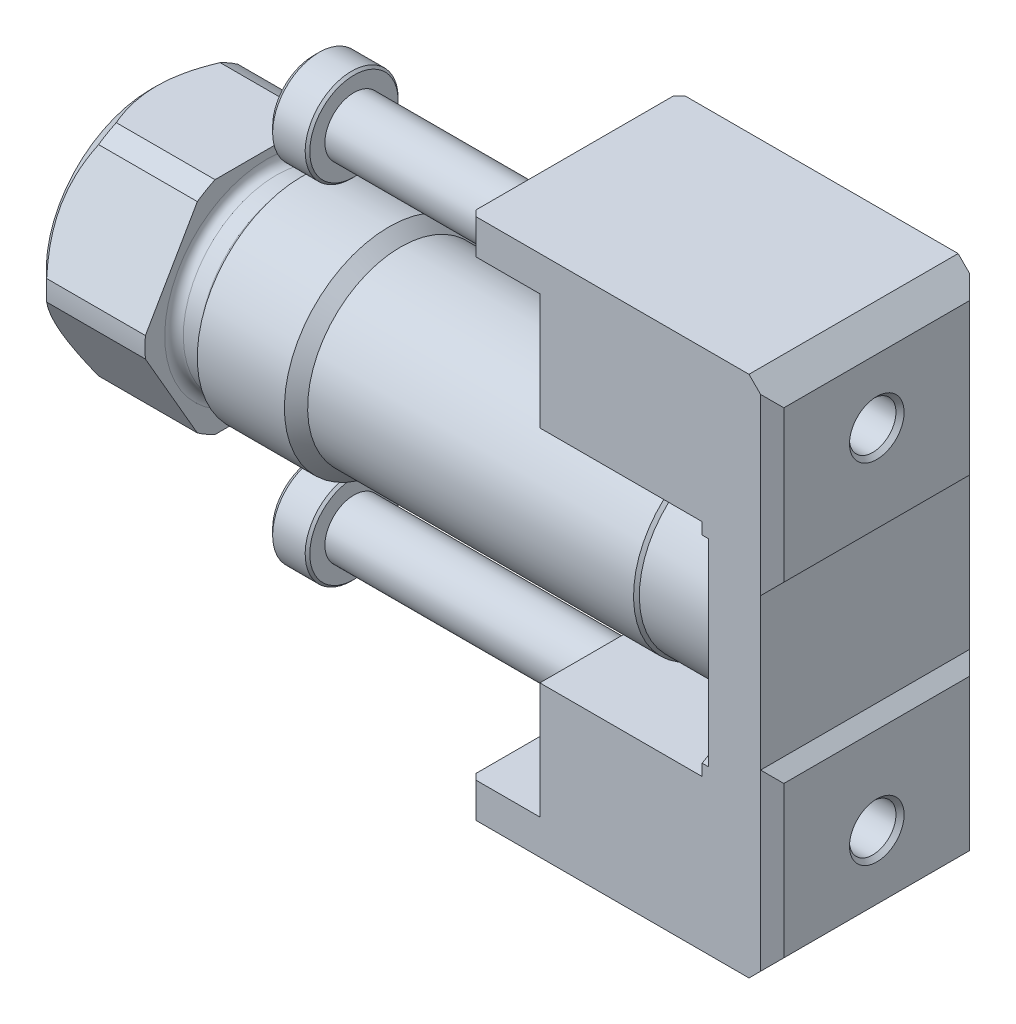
ISO-10303-21;
HEADER;
FILE_DESCRIPTION(('STEP AP214'),'2;1');
FILE_NAME('part.step','',(''),(''),'','','');
FILE_SCHEMA(('AUTOMOTIVE_DESIGN { 1 0 10303 214 1 1 1 1 }'));
ENDSEC;
DATA;
#1=APPLICATION_CONTEXT('core data for automotive mechanical design processes');
#2=APPLICATION_PROTOCOL_DEFINITION('international standard','automotive_design',2000,#1);
#3=PRODUCT_CONTEXT('',#1,'mechanical');
#4=PRODUCT('Part','Part','',(#3));
#5=PRODUCT_RELATED_PRODUCT_CATEGORY('part','',(#4));
#6=PRODUCT_DEFINITION_FORMATION('','',#4);
#7=PRODUCT_DEFINITION_CONTEXT('part definition',#1,'design');
#8=PRODUCT_DEFINITION('design','',#6,#7);
#9=PRODUCT_DEFINITION_SHAPE('','',#8);
#10=(LENGTH_UNIT() NAMED_UNIT(*) SI_UNIT(.MILLI.,.METRE.));
#11=(NAMED_UNIT(*) PLANE_ANGLE_UNIT() SI_UNIT($,.RADIAN.));
#12=(NAMED_UNIT(*) SI_UNIT($,.STERADIAN.) SOLID_ANGLE_UNIT());
#13=UNCERTAINTY_MEASURE_WITH_UNIT(LENGTH_MEASURE(1.E-05),#10,'distance_accuracy_value','');
#14=(GEOMETRIC_REPRESENTATION_CONTEXT(3) GLOBAL_UNCERTAINTY_ASSIGNED_CONTEXT((#13)) GLOBAL_UNIT_ASSIGNED_CONTEXT((#10,
#11,#12)) REPRESENTATION_CONTEXT('',''));
#15=CARTESIAN_POINT('',(0.,0.,0.));
#16=DIRECTION('',(0.,0.,1.));
#17=DIRECTION('',(1.,0.,0.));
#18=AXIS2_PLACEMENT_3D('',#15,#16,#17);
#19=CARTESIAN_POINT('',(-53.4874939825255,0.,0.));
#20=DIRECTION('',(-1.,0.,0.));
#21=DIRECTION('',(0.,-1.,0.));
#22=AXIS2_PLACEMENT_3D('',#19,#20,#21);
#23=CONICAL_SURFACE('',#22,4.,1.02974425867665);
#24=CARTESIAN_POINT('',(-51.0840515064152,0.,0.));
#25=VERTEX_POINT('',#24);
#26=VERTEX_LOOP('',#25);
#27=FACE_BOUND('',#26,.T.);
#28=CARTESIAN_POINT('',(-53.4874939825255,0.,0.));
#29=DIRECTION('',(-1.,0.,0.));
#30=DIRECTION('',(0.,-1.,0.));
#31=AXIS2_PLACEMENT_3D('',#28,#29,#30);
#32=CIRCLE('',#31,4.);
#33=CARTESIAN_POINT('',(-53.4874939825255,-4.,0.));
#34=VERTEX_POINT('',#33);
#35=EDGE_CURVE('E882',#34,#34,#32,.T.);
#36=ORIENTED_EDGE('',*,*,#35,.T.);
#37=EDGE_LOOP('',(#36));
#38=FACE_BOUND('',#37,.T.);
#39=ADVANCED_FACE('F14',(#27,#38),#23,.F.);
#40=CARTESIAN_POINT('',(-62.4874939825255,0.,0.));
#41=DIRECTION('',(-1.,0.,0.));
#42=DIRECTION('',(0.,-1.,0.));
#43=AXIS2_PLACEMENT_3D('',#40,#41,#42);
#44=CYLINDRICAL_SURFACE('',#43,4.);
#45=CARTESIAN_POINT('',(-56.4874939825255,0.,0.));
#46=DIRECTION('',(-1.,0.,0.));
#47=DIRECTION('',(0.,-1.,0.));
#48=AXIS2_PLACEMENT_3D('',#45,#46,#47);
#49=CIRCLE('',#48,4.);
#50=CARTESIAN_POINT('',(-56.4874939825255,-4.,0.));
#51=VERTEX_POINT('',#50);
#52=CARTESIAN_POINT('',(-56.4874939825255,-2.,3.46410161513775));
#53=VERTEX_POINT('',#52);
#54=EDGE_CURVE('E418',#51,#53,#49,.T.);
#55=ORIENTED_EDGE('',*,*,#54,.T.);
#56=CARTESIAN_POINT('',(-56.4874939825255,2.,3.46410161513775));
#57=VERTEX_POINT('',#56);
#58=EDGE_CURVE('E919',#53,#57,#49,.T.);
#59=ORIENTED_EDGE('',*,*,#58,.T.);
#60=CARTESIAN_POINT('',(-56.4874939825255,4.,0.));
#61=VERTEX_POINT('',#60);
#62=EDGE_CURVE('E920',#57,#61,#49,.T.);
#63=ORIENTED_EDGE('',*,*,#62,.T.);
#64=CARTESIAN_POINT('',(-56.4874939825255,2.,-3.46410161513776));
#65=VERTEX_POINT('',#64);
#66=EDGE_CURVE('E404',#61,#65,#49,.T.);
#67=ORIENTED_EDGE('',*,*,#66,.T.);
#68=CARTESIAN_POINT('',(-56.4874939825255,-2.,-3.46410161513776));
#69=VERTEX_POINT('',#68);
#70=EDGE_CURVE('E397',#65,#69,#49,.T.);
#71=ORIENTED_EDGE('',*,*,#70,.T.);
#72=EDGE_CURVE('E401',#69,#51,#49,.T.);
#73=ORIENTED_EDGE('',*,*,#72,.T.);
#74=EDGE_LOOP('',(#55,#59,#63,#67,#71,#73));
#75=FACE_BOUND('',#74,.T.);
#76=ORIENTED_EDGE('',*,*,#35,.F.);
#77=EDGE_LOOP('',(#76));
#78=FACE_BOUND('',#77,.T.);
#79=ADVANCED_FACE('F399',(#75,#78),#44,.F.);
#80=CARTESIAN_POINT('',(-56.4874939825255,0.,4.618802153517));
#81=DIRECTION('',(-1.,0.,0.));
#82=DIRECTION('',(0.,-1.,0.));
#83=AXIS2_PLACEMENT_3D('',#80,#81,#82);
#84=PLANE('',#83);
#85=ORIENTED_EDGE('',*,*,#72,.F.);
#86=DIRECTION('',(0.,-0.866025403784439,0.5));
#87=VECTOR('',#86,1.);
#88=CARTESIAN_POINT('',(-56.4874939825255,0.,-4.618802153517));
#89=LINE('',#88,#87);
#90=CARTESIAN_POINT('',(-56.4874939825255,-4.,-2.3094010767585));
#91=VERTEX_POINT('',#90);
#92=EDGE_CURVE('E413',#69,#91,#89,.T.);
#93=ORIENTED_EDGE('',*,*,#92,.T.);
#94=DIRECTION('',(0.,0.,1.));
#95=VECTOR('',#94,1.);
#96=CARTESIAN_POINT('',(-56.4874939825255,-4.,-2.3094010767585));
#97=LINE('',#96,#95);
#98=EDGE_CURVE('E416',#91,#51,#97,.T.);
#99=ORIENTED_EDGE('',*,*,#98,.T.);
#100=EDGE_LOOP('',(#85,#93,#99));
#101=FACE_BOUND('',#100,.T.);
#102=ADVANCED_FACE('F412',(#101),#84,.T.);
#103=ORIENTED_EDGE('',*,*,#54,.F.);
#104=CARTESIAN_POINT('',(-56.4874939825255,-4.,2.3094010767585));
#105=VERTEX_POINT('',#104);
#106=EDGE_CURVE('E431',#51,#105,#97,.T.);
#107=ORIENTED_EDGE('',*,*,#106,.T.);
#108=DIRECTION('',(0.,0.866025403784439,0.5));
#109=VECTOR('',#108,1.);
#110=CARTESIAN_POINT('',(-56.4874939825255,-4.,2.3094010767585));
#111=LINE('',#110,#109);
#112=EDGE_CURVE('E899',#105,#53,#111,.T.);
#113=ORIENTED_EDGE('',*,*,#112,.T.);
#114=EDGE_LOOP('',(#103,#107,#113));
#115=FACE_BOUND('',#114,.T.);
#116=ADVANCED_FACE('F926',(#115),#84,.T.);
#117=ORIENTED_EDGE('',*,*,#58,.F.);
#118=CARTESIAN_POINT('',(-56.4874939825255,0.,4.618802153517));
#119=VERTEX_POINT('',#118);
#120=EDGE_CURVE('E900',#53,#119,#111,.T.);
#121=ORIENTED_EDGE('',*,*,#120,.T.);
#122=DIRECTION('',(0.,0.866025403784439,-0.5));
#123=VECTOR('',#122,1.);
#124=CARTESIAN_POINT('',(-56.4874939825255,0.,4.618802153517));
#125=LINE('',#124,#123);
#126=EDGE_CURVE('E903',#119,#57,#125,.T.);
#127=ORIENTED_EDGE('',*,*,#126,.T.);
#128=EDGE_LOOP('',(#117,#121,#127));
#129=FACE_BOUND('',#128,.T.);
#130=ADVANCED_FACE('F627',(#129),#84,.T.);
#131=ORIENTED_EDGE('',*,*,#62,.F.);
#132=CARTESIAN_POINT('',(-56.4874939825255,4.,2.3094010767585));
#133=VERTEX_POINT('',#132);
#134=EDGE_CURVE('E902',#57,#133,#125,.T.);
#135=ORIENTED_EDGE('',*,*,#134,.T.);
#136=DIRECTION('',(0.,0.,-1.));
#137=VECTOR('',#136,1.);
#138=CARTESIAN_POINT('',(-56.4874939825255,4.,2.3094010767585));
#139=LINE('',#138,#137);
#140=EDGE_CURVE('E907',#133,#61,#139,.T.);
#141=ORIENTED_EDGE('',*,*,#140,.T.);
#142=EDGE_LOOP('',(#131,#135,#141));
#143=FACE_BOUND('',#142,.T.);
#144=ADVANCED_FACE('F621',(#143),#84,.T.);
#145=ORIENTED_EDGE('',*,*,#66,.F.);
#146=CARTESIAN_POINT('',(-56.4874939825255,4.,-2.3094010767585));
#147=VERTEX_POINT('',#146);
#148=EDGE_CURVE('E906',#61,#147,#139,.T.);
#149=ORIENTED_EDGE('',*,*,#148,.T.);
#150=DIRECTION('',(0.,-0.866025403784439,-0.5));
#151=VECTOR('',#150,1.);
#152=CARTESIAN_POINT('',(-56.4874939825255,4.,-2.3094010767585));
#153=LINE('',#152,#151);
#154=EDGE_CURVE('E426',#147,#65,#153,.T.);
#155=ORIENTED_EDGE('',*,*,#154,.T.);
#156=EDGE_LOOP('',(#145,#149,#155));
#157=FACE_BOUND('',#156,.T.);
#158=ADVANCED_FACE('F613',(#157),#84,.T.);
#159=ORIENTED_EDGE('',*,*,#70,.F.);
#160=CARTESIAN_POINT('',(-56.4874939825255,0.,-4.618802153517));
#161=VERTEX_POINT('',#160);
#162=EDGE_CURVE('E429',#65,#161,#153,.T.);
#163=ORIENTED_EDGE('',*,*,#162,.T.);
#164=EDGE_CURVE('E423',#161,#69,#89,.T.);
#165=ORIENTED_EDGE('',*,*,#164,.T.);
#166=EDGE_LOOP('',(#159,#163,#165));
#167=FACE_BOUND('',#166,.T.);
#168=ADVANCED_FACE('F428',(#167),#84,.T.);
#169=CARTESIAN_POINT('',(-56.4874939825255,0.,-4.618802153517));
#170=DIRECTION('',(0.,-0.5,-0.866025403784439));
#171=DIRECTION('',(0.,-0.866025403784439,0.5));
#172=AXIS2_PLACEMENT_3D('',#169,#170,#171);
#173=PLANE('',#172);
#174=ORIENTED_EDGE('',*,*,#92,.F.);
#175=ORIENTED_EDGE('',*,*,#164,.F.);
#176=DIRECTION('',(-1.,0.,0.));
#177=VECTOR('',#176,1.);
#178=CARTESIAN_POINT('',(-56.4874939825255,0.,-4.618802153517));
#179=LINE('',#178,#177);
#180=CARTESIAN_POINT('',(-62.0062961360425,0.,-4.618802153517));
#181=VERTEX_POINT('',#180);
#182=EDGE_CURVE('E442',#161,#181,#179,.T.);
#183=ORIENTED_EDGE('',*,*,#182,.T.);
#184=CARTESIAN_POINT('',(-62.0064116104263,0.000200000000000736,-4.61891762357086));
#185=CARTESIAN_POINT('',(-61.966704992,-0.0685809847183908,-4.57920690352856));
#186=CARTESIAN_POINT('',(-61.9282165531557,-0.137888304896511,-4.5391923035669));
#187=CARTESIAN_POINT('',(-61.854047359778,-0.277664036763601,-4.45849274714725));
#188=CARTESIAN_POINT('',(-61.8183681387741,-0.348133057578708,-4.41780743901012));
#189=CARTESIAN_POINT('',(-61.7157970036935,-0.562100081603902,-4.29427352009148));
#190=CARTESIAN_POINT('',(-61.6538092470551,-0.707416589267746,-4.21037499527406));
#191=CARTESIAN_POINT('',(-61.5476520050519,-1.00040214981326,-4.04121970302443));
#192=CARTESIAN_POINT('',(-61.503215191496,-1.14799719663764,-3.95600566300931));
#193=CARTESIAN_POINT('',(-61.434745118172,-1.44644641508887,-3.78369592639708));
#194=CARTESIAN_POINT('',(-61.4106607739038,-1.59729144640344,-3.69660550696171));
#195=CARTESIAN_POINT('',(-61.388931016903,-1.85726690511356,-3.54650860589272));
#196=CARTESIAN_POINT('',(-61.3857150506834,-1.96606238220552,-3.48369550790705));
#197=CARTESIAN_POINT('',(-61.3911361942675,-2.18347675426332,-3.35817126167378));
#198=CARTESIAN_POINT('',(-61.3997774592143,-2.29209557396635,-3.29546015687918));
#199=CARTESIAN_POINT('',(-61.4284201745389,-2.50830402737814,-3.17063214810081));
#200=CARTESIAN_POINT('',(-61.4484343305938,-2.61589237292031,-3.10851598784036));
#201=CARTESIAN_POINT('',(-61.4987302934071,-2.82922129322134,-2.98535047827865));
#202=CARTESIAN_POINT('',(-61.5290113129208,-2.93496200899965,-2.92430104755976));
#203=CARTESIAN_POINT('',(-61.5913113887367,-3.12267722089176,-2.81592361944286));
#204=CARTESIAN_POINT('',(-61.6216924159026,-3.2050673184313,-2.76835567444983));
#205=CARTESIAN_POINT('',(-61.6873506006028,-3.36836846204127,-2.67407371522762));
#206=CARTESIAN_POINT('',(-61.7226279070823,-3.44927946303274,-2.6273597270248));
#207=CARTESIAN_POINT('',(-61.7972878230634,-3.60936749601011,-2.53493285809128));
#208=CARTESIAN_POINT('',(-61.8366575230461,-3.68854908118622,-2.48921734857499));
#209=CARTESIAN_POINT('',(-61.9189852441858,-3.84544590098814,-2.39863292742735));
#210=CARTESIAN_POINT('',(-61.9619410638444,-3.92316199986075,-2.35376351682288));
#211=CARTESIAN_POINT('',(-62.0064116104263,-4.0002,-2.30928560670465));
#212=B_SPLINE_CURVE_WITH_KNOTS('',3,(#184,#185,#186,#187,#188,#189,#190,#191,#192,#193,#194,
#195,#196,#197,#198,#199,#200,#201,#202,#203,#204,#205,#206,#207,#208,#209,#210,#211),
.UNSPECIFIED.,.F.,.F.,(4,2,2,2,2,2,2,2,2,2,2,2,2,4),(0.,0.266361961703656,0.532868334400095,
1.0687586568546,1.59613884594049,2.12219135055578,2.49866160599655,2.87526382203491,
3.25228760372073,3.62928248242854,3.92874944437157,4.22822551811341,4.5267840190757,
4.82516056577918),.UNSPECIFIED.);
#213=CARTESIAN_POINT('',(-62.0062961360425,-4.,-2.3094010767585));
#214=VERTEX_POINT('',#213);
#215=EDGE_CURVE('E598',#181,#214,#212,.T.);
#216=ORIENTED_EDGE('',*,*,#215,.T.);
#217=DIRECTION('',(-1.,0.,0.));
#218=VECTOR('',#217,1.);
#219=CARTESIAN_POINT('',(-56.4874939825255,-4.,-2.3094010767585));
#220=LINE('',#219,#218);
#221=EDGE_CURVE('E425',#91,#214,#220,.T.);
#222=ORIENTED_EDGE('',*,*,#221,.F.);
#223=EDGE_LOOP('',(#174,#175,#183,#216,#222));
#224=FACE_BOUND('',#223,.T.);
#225=ADVANCED_FACE('F421',(#224),#173,.F.);
#226=CARTESIAN_POINT('',(-56.4874939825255,-4.,-2.3094010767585));
#227=DIRECTION('',(0.,-1.,0.));
#228=DIRECTION('',(0.,0.,1.));
#229=AXIS2_PLACEMENT_3D('',#226,#227,#228);
#230=PLANE('',#229);
#231=ORIENTED_EDGE('',*,*,#106,.F.);
#232=ORIENTED_EDGE('',*,*,#98,.F.);
#233=ORIENTED_EDGE('',*,*,#221,.T.);
#234=CARTESIAN_POINT('',(-64.342389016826,-4.,-5.68951359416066));
#235=CARTESIAN_POINT('',(-64.2252287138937,-4.,-5.54625965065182));
#236=CARTESIAN_POINT('',(-64.1089056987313,-4.,-5.40230990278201));
#237=CARTESIAN_POINT('',(-63.8783769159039,-4.,-5.11266655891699));
#238=CARTESIAN_POINT('',(-63.7641716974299,-4.,-4.96697252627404));
#239=CARTESIAN_POINT('',(-63.5371448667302,-4.,-4.67195421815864));
#240=CARTESIAN_POINT('',(-63.4243521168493,-4.,-4.52260765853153));
#241=CARTESIAN_POINT('',(-63.2021463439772,-4.,-4.22143608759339));
#242=CARTESIAN_POINT('',(-63.0927329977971,-4.,-4.06961131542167));
#243=CARTESIAN_POINT('',(-62.8683534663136,-4.,-3.74888624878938));
#244=CARTESIAN_POINT('',(-62.7537981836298,-4.,-3.57969684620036));
#245=CARTESIAN_POINT('',(-62.5314267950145,-4.,-3.23683321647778));
#246=CARTESIAN_POINT('',(-62.4236128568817,-4.,-3.06315757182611));
#247=CARTESIAN_POINT('',(-62.2176399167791,-4.,-2.71119793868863));
#248=CARTESIAN_POINT('',(-62.1194386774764,-4.,-2.53293889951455));
#249=CARTESIAN_POINT('',(-61.9355732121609,-4.,-2.17012861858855));
#250=CARTESIAN_POINT('',(-61.8498982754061,-4.,-1.98558292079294));
#251=CARTESIAN_POINT('',(-61.7175415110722,-4.,-1.66264920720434));
#252=CARTESIAN_POINT('',(-61.6666870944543,-4.,-1.52598380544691));
#253=CARTESIAN_POINT('',(-61.5759130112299,-4.,-1.24898562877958));
#254=CARTESIAN_POINT('',(-61.5359948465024,-4.,-1.10865235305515));
#255=CARTESIAN_POINT('',(-61.4700604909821,-4.,-0.82796335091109));
#256=CARTESIAN_POINT('',(-61.4437575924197,-4.,-0.687676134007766));
#257=CARTESIAN_POINT('',(-61.4055263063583,-4.,-0.405143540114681));
#258=CARTESIAN_POINT('',(-61.3935945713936,-4.,-0.262898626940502));
#259=CARTESIAN_POINT('',(-61.3852354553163,-4.,0.0148277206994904));
#260=CARTESIAN_POINT('',(-61.3880527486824,-4.,0.150286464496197));
#261=CARTESIAN_POINT('',(-61.4072525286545,-4.,0.420230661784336));
#262=CARTESIAN_POINT('',(-61.4236359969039,-4.,0.554716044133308));
#263=CARTESIAN_POINT('',(-61.4693005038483,-4.,0.824086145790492));
#264=CARTESIAN_POINT('',(-61.4988221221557,-4.,0.958929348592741));
#265=CARTESIAN_POINT('',(-61.569067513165,-4.,1.22561136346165));
#266=CARTESIAN_POINT('',(-61.6097910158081,-4.,1.35745024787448));
#267=CARTESIAN_POINT('',(-61.7019227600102,-4.,1.62176136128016));
#268=CARTESIAN_POINT('',(-61.7536159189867,-4.,1.75413302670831));
#269=CARTESIAN_POINT('',(-61.8650096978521,-4.,2.01547264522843));
#270=CARTESIAN_POINT('',(-61.9247128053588,-4.,2.14443952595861));
#271=CARTESIAN_POINT('',(-62.0507214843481,-4.,2.39959092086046));
#272=CARTESIAN_POINT('',(-62.1170474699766,-4.,2.52576527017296));
#273=CARTESIAN_POINT('',(-62.2548435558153,-4.,2.77522976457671));
#274=CARTESIAN_POINT('',(-62.3263128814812,-4.,2.89852034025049));
#275=CARTESIAN_POINT('',(-62.4697587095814,-4.,3.13655551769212));
#276=CARTESIAN_POINT('',(-62.5415353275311,-4.,3.25142121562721));
#277=CARTESIAN_POINT('',(-62.6881634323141,-4.,3.47917889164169));
#278=CARTESIAN_POINT('',(-62.7630151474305,-4.,3.59207072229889));
#279=CARTESIAN_POINT('',(-62.9146429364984,-4.,3.81523755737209));
#280=CARTESIAN_POINT('',(-62.9913989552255,-4.,3.92552623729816));
#281=CARTESIAN_POINT('',(-63.1469837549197,-4.,4.14458777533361));
#282=CARTESIAN_POINT('',(-63.2258119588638,-4.,4.25336104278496));
#283=CARTESIAN_POINT('',(-63.30548894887,-4.,4.36149795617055));
#284=B_SPLINE_CURVE_WITH_KNOTS('',3,(#234,#235,#236,#237,#238,#239,#240,#241,#242,#243,#244,
#245,#246,#247,#248,#249,#250,#251,#252,#253,#254,#255,#256,#257,#258,#259,#260,#261,#262,#263,
#264,#265,#266,#267,#268,#269,#270,#271,#272,#273,#274,#275,#276,#277,#278,#279,#280,#281,#282,
#283),.UNSPECIFIED.,.F.,.F.,(4,2,2,2,2,2,2,2,2,2,2,2,2,2,2,2,2,2,2,2,2,2,2,2,4),(0.,
0.555197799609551,1.11053761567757,1.67196102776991,2.23333058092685,2.84617977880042,
3.45922504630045,4.06944280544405,4.67913570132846,5.1162315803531,5.55338745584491,
5.98091925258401,6.40835144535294,6.81411506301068,7.21990804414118,7.63345871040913,
8.04699940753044,8.47299786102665,8.89912892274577,9.32661659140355,9.75404001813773,
10.1603250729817,10.5666403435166,10.9697220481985,11.3726926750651),.UNSPECIFIED.);
#285=CARTESIAN_POINT('',(-62.0062961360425,-4.,2.3094010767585));
#286=VERTEX_POINT('',#285);
#287=EDGE_CURVE('E585',#214,#286,#284,.T.);
#288=ORIENTED_EDGE('',*,*,#287,.T.);
#289=DIRECTION('',(-1.,0.,0.));
#290=VECTOR('',#289,1.);
#291=CARTESIAN_POINT('',(-56.4874939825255,-4.,2.3094010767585));
#292=LINE('',#291,#290);
#293=EDGE_CURVE('E437',#105,#286,#292,.T.);
#294=ORIENTED_EDGE('',*,*,#293,.F.);
#295=EDGE_LOOP('',(#231,#232,#233,#288,#294));
#296=FACE_BOUND('',#295,.T.);
#297=ADVANCED_FACE('F894',(#296),#230,.F.);
#298=CARTESIAN_POINT('',(-56.4874939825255,-4.,2.3094010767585));
#299=DIRECTION('',(0.,-0.5,0.866025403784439));
#300=DIRECTION('',(0.,0.866025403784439,0.5));
#301=AXIS2_PLACEMENT_3D('',#298,#299,#300);
#302=PLANE('',#301);
#303=ORIENTED_EDGE('',*,*,#120,.F.);
#304=ORIENTED_EDGE('',*,*,#112,.F.);
#305=ORIENTED_EDGE('',*,*,#293,.T.);
#306=CARTESIAN_POINT('',(-62.0064116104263,-4.0002,2.30928560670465));
#307=CARTESIAN_POINT('',(-61.966704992,-3.9314190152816,2.34899632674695));
#308=CARTESIAN_POINT('',(-61.9282165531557,-3.86211169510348,2.38901092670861));
#309=CARTESIAN_POINT('',(-61.854047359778,-3.72233596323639,2.46971048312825));
#310=CARTESIAN_POINT('',(-61.8183681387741,-3.65186694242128,2.51039579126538));
#311=CARTESIAN_POINT('',(-61.7157970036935,-3.43789991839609,2.63392971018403));
#312=CARTESIAN_POINT('',(-61.6538092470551,-3.29258341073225,2.71782823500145));
#313=CARTESIAN_POINT('',(-61.5476520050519,-2.99959785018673,2.88698352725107));
#314=CARTESIAN_POINT('',(-61.503215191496,-2.85200280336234,2.97219756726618));
#315=CARTESIAN_POINT('',(-61.434745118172,-2.55355358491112,3.14450730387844));
#316=CARTESIAN_POINT('',(-61.4106607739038,-2.40270855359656,3.23159772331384));
#317=CARTESIAN_POINT('',(-61.388931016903,-2.14273309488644,3.38169462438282));
#318=CARTESIAN_POINT('',(-61.3857150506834,-2.03393761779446,3.44450772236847));
#319=CARTESIAN_POINT('',(-61.3911361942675,-1.81652324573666,3.57003196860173));
#320=CARTESIAN_POINT('',(-61.3997774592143,-1.70790442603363,3.63274307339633));
#321=CARTESIAN_POINT('',(-61.4284201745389,-1.49169597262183,3.75757108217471));
#322=CARTESIAN_POINT('',(-61.4484343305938,-1.38410762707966,3.81968724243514));
#323=CARTESIAN_POINT('',(-61.4987302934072,-1.17077870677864,3.94285275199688));
#324=CARTESIAN_POINT('',(-61.5290113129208,-1.06503799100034,4.00390218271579));
#325=CARTESIAN_POINT('',(-61.5913113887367,-0.877322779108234,4.11227961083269));
#326=CARTESIAN_POINT('',(-61.6216924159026,-0.794932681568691,4.15984755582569));
#327=CARTESIAN_POINT('',(-61.6873506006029,-0.631631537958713,4.25412951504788));
#328=CARTESIAN_POINT('',(-61.7226279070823,-0.550720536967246,4.30084350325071));
#329=CARTESIAN_POINT('',(-61.7972878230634,-0.390632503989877,4.39327037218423));
#330=CARTESIAN_POINT('',(-61.8366575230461,-0.311450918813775,4.43898588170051));
#331=CARTESIAN_POINT('',(-61.9189852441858,-0.154554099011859,4.52957030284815));
#332=CARTESIAN_POINT('',(-61.9619410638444,-0.0768380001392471,4.57443971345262));
#333=CARTESIAN_POINT('',(-62.0064116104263,0.000199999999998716,4.61891762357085));
#334=B_SPLINE_CURVE_WITH_KNOTS('',3,(#306,#307,#308,#309,#310,#311,#312,#313,#314,#315,#316,
#317,#318,#319,#320,#321,#322,#323,#324,#325,#326,#327,#328,#329,#330,#331,#332,#333),
.UNSPECIFIED.,.F.,.F.,(4,2,2,2,2,2,2,2,2,2,2,2,2,4),(0.,0.266361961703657,0.532868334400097,
1.06875865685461,1.5961388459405,2.12219135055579,2.49866160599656,2.87526382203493,
3.25228760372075,3.62928248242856,3.92874944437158,4.22822551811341,4.5267840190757,
4.82516056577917),.UNSPECIFIED.);
#335=CARTESIAN_POINT('',(-62.0062961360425,0.,4.618802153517));
#336=VERTEX_POINT('',#335);
#337=EDGE_CURVE('E579',#286,#336,#334,.T.);
#338=ORIENTED_EDGE('',*,*,#337,.T.);
#339=DIRECTION('',(-1.,0.,0.));
#340=VECTOR('',#339,1.);
#341=CARTESIAN_POINT('',(-56.4874939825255,0.,4.618802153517));
#342=LINE('',#341,#340);
#343=EDGE_CURVE('E436',#119,#336,#342,.T.);
#344=ORIENTED_EDGE('',*,*,#343,.F.);
#345=EDGE_LOOP('',(#303,#304,#305,#338,#344));
#346=FACE_BOUND('',#345,.T.);
#347=ADVANCED_FACE('F619',(#346),#302,.F.);
#348=CARTESIAN_POINT('',(-56.4874939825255,0.,4.618802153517));
#349=DIRECTION('',(0.,0.5,0.866025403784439));
#350=DIRECTION('',(0.,0.866025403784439,-0.5));
#351=AXIS2_PLACEMENT_3D('',#348,#349,#350);
#352=PLANE('',#351);
#353=ORIENTED_EDGE('',*,*,#134,.F.);
#354=ORIENTED_EDGE('',*,*,#126,.F.);
#355=ORIENTED_EDGE('',*,*,#343,.T.);
#356=CARTESIAN_POINT('',(-62.0064116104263,-0.000200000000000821,4.61891762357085));
#357=CARTESIAN_POINT('',(-61.966704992,0.0685809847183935,4.57920690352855));
#358=CARTESIAN_POINT('',(-61.9282165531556,0.137888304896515,4.5391923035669));
#359=CARTESIAN_POINT('',(-61.854047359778,0.277664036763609,4.45849274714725));
#360=CARTESIAN_POINT('',(-61.8183681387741,0.348133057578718,4.41780743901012));
#361=CARTESIAN_POINT('',(-61.7157970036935,0.562100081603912,4.29427352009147));
#362=CARTESIAN_POINT('',(-61.6538092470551,0.707416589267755,4.21037499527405));
#363=CARTESIAN_POINT('',(-61.5476520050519,1.00040214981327,4.04121970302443));
#364=CARTESIAN_POINT('',(-61.5032151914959,1.14799719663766,3.95600566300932));
#365=CARTESIAN_POINT('',(-61.4347451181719,1.44644641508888,3.78369592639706));
#366=CARTESIAN_POINT('',(-61.4106607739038,1.59729144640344,3.69660550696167));
#367=CARTESIAN_POINT('',(-61.388931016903,1.85726690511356,3.54650860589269));
#368=CARTESIAN_POINT('',(-61.3857150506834,1.96606238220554,3.48369550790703));
#369=CARTESIAN_POINT('',(-61.3911361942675,2.18347675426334,3.35817126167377));
#370=CARTESIAN_POINT('',(-61.3997774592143,2.29209557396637,3.29546015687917));
#371=CARTESIAN_POINT('',(-61.4284201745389,2.50830402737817,3.17063214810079));
#372=CARTESIAN_POINT('',(-61.4484343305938,2.61589237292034,3.10851598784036));
#373=CARTESIAN_POINT('',(-61.4987302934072,2.82922129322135,2.98535047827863));
#374=CARTESIAN_POINT('',(-61.5290113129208,2.93496200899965,2.92430104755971));
#375=CARTESIAN_POINT('',(-61.5913113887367,3.12267722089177,2.81592361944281));
#376=CARTESIAN_POINT('',(-61.6216924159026,3.20506731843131,2.76835567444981));
#377=CARTESIAN_POINT('',(-61.6873506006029,3.36836846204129,2.67407371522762));
#378=CARTESIAN_POINT('',(-61.7226279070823,3.44927946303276,2.62735972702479));
#379=CARTESIAN_POINT('',(-61.7972878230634,3.60936749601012,2.53493285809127));
#380=CARTESIAN_POINT('',(-61.8366575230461,3.68854908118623,2.48921734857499));
#381=CARTESIAN_POINT('',(-61.9189852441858,3.84544590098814,2.39863292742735));
#382=CARTESIAN_POINT('',(-61.9619410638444,3.92316199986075,2.35376351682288));
#383=CARTESIAN_POINT('',(-62.0064116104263,4.0002,2.30928560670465));
#384=B_SPLINE_CURVE_WITH_KNOTS('',3,(#356,#357,#358,#359,#360,#361,#362,#363,#364,#365,#366,
#367,#368,#369,#370,#371,#372,#373,#374,#375,#376,#377,#378,#379,#380,#381,#382,#383),
.UNSPECIFIED.,.F.,.F.,(4,2,2,2,2,2,2,2,2,2,2,2,2,4),(0.,0.266361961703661,0.532868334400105,
1.06875865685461,1.5961388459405,2.12219135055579,2.49866160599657,2.87526382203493,
3.25228760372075,3.62928248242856,3.92874944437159,4.22822551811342,4.5267840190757,
4.82516056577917),.UNSPECIFIED.);
#385=CARTESIAN_POINT('',(-62.0062961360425,4.,2.3094010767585));
#386=VERTEX_POINT('',#385);
#387=EDGE_CURVE('E417',#336,#386,#384,.T.);
#388=ORIENTED_EDGE('',*,*,#387,.T.);
#389=DIRECTION('',(-1.,0.,0.));
#390=VECTOR('',#389,1.);
#391=CARTESIAN_POINT('',(-56.4874939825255,4.,2.3094010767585));
#392=LINE('',#391,#390);
#393=EDGE_CURVE('E447',#133,#386,#392,.T.);
#394=ORIENTED_EDGE('',*,*,#393,.F.);
#395=EDGE_LOOP('',(#353,#354,#355,#388,#394));
#396=FACE_BOUND('',#395,.T.);
#397=ADVANCED_FACE('F552',(#396),#352,.F.);
#398=CARTESIAN_POINT('',(-56.4874939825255,4.,2.3094010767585));
#399=DIRECTION('',(0.,1.,0.));
#400=DIRECTION('',(0.,0.,-1.));
#401=AXIS2_PLACEMENT_3D('',#398,#399,#400);
#402=PLANE('',#401);
#403=ORIENTED_EDGE('',*,*,#148,.F.);
#404=ORIENTED_EDGE('',*,*,#140,.F.);
#405=ORIENTED_EDGE('',*,*,#393,.T.);
#406=CARTESIAN_POINT('',(-64.3423890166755,4.,-5.68951359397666));
#407=CARTESIAN_POINT('',(-64.225228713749,4.,-5.54625965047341));
#408=CARTESIAN_POINT('',(-64.1089056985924,4.,-5.40230990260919));
#409=CARTESIAN_POINT('',(-63.8783769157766,4.,-5.11266655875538));
#410=CARTESIAN_POINT('',(-63.7641716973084,4.,-4.96697252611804));
#411=CARTESIAN_POINT('',(-63.5371448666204,4.,-4.67195421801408));
#412=CARTESIAN_POINT('',(-63.4243521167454,4.,-4.5226076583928));
#413=CARTESIAN_POINT('',(-63.202146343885,4.,-4.22143608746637));
#414=CARTESIAN_POINT('',(-63.0927329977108,4.,-4.06961131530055));
#415=CARTESIAN_POINT('',(-62.8683534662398,4.,-3.74888624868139));
#416=CARTESIAN_POINT('',(-62.7537981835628,4.,-3.57969684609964));
#417=CARTESIAN_POINT('',(-62.5314267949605,4.,-3.23683321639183));
#418=CARTESIAN_POINT('',(-62.4236128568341,4.,-3.06315757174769));
#419=CARTESIAN_POINT('',(-62.2176399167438,4.,-2.71119793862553));
#420=CARTESIAN_POINT('',(-62.119438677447,4.,-2.53293889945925));
#421=CARTESIAN_POINT('',(-61.9355732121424,4.,-2.17012861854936));
#422=CARTESIAN_POINT('',(-61.8498982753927,4.,-1.98558292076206));
#423=CARTESIAN_POINT('',(-61.7175415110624,4.,-1.66264920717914));
#424=CARTESIAN_POINT('',(-61.6666870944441,4.,-1.52598380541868));
#425=CARTESIAN_POINT('',(-61.5759130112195,4.,-1.24898562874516));
#426=CARTESIAN_POINT('',(-61.5359948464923,4.,-1.10865235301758));
#427=CARTESIAN_POINT('',(-61.4700604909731,4.,-0.827963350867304));
#428=CARTESIAN_POINT('',(-61.4437575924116,4.,-0.687676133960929));
#429=CARTESIAN_POINT('',(-61.4055263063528,4.,-0.405143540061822));
#430=CARTESIAN_POINT('',(-61.3935945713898,4.,-0.262898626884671));
#431=CARTESIAN_POINT('',(-61.3852354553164,4.,0.0148277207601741));
#432=CARTESIAN_POINT('',(-61.3880527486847,4.,0.150286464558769));
#433=CARTESIAN_POINT('',(-61.4072525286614,4.,0.420230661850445));
#434=CARTESIAN_POINT('',(-61.4236359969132,4.,0.554716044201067));
#435=CARTESIAN_POINT('',(-61.4693005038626,4.,0.824086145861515));
#436=CARTESIAN_POINT('',(-61.4988221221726,4.,0.958929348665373));
#437=CARTESIAN_POINT('',(-61.5690675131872,4.,1.22561136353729));
#438=CARTESIAN_POINT('',(-61.6097910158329,4.,1.35745024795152));
#439=CARTESIAN_POINT('',(-61.7019227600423,4.,1.62176136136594));
#440=CARTESIAN_POINT('',(-61.7536159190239,4.,1.75413302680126));
#441=CARTESIAN_POINT('',(-61.8650096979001,4.,2.01547264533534));
#442=CARTESIAN_POINT('',(-61.9247128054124,4.,2.14443952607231));
#443=CARTESIAN_POINT('',(-62.0507214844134,4.,2.3995909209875));
#444=CARTESIAN_POINT('',(-62.1170474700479,4.,2.52576527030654));
#445=CARTESIAN_POINT('',(-62.2548435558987,4.,2.77522976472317));
#446=CARTESIAN_POINT('',(-62.3263128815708,4.,2.89852034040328));
#447=CARTESIAN_POINT('',(-62.4697587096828,4.,3.13655551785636));
#448=CARTESIAN_POINT('',(-62.5415353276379,4.,3.2514212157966));
#449=CARTESIAN_POINT('',(-62.6881634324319,4.,3.47917889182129));
#450=CARTESIAN_POINT('',(-62.7630151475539,4.,3.59207072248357));
#451=CARTESIAN_POINT('',(-62.9146429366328,4.,3.81523755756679));
#452=CARTESIAN_POINT('',(-62.9913989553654,4.,3.92552623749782));
#453=CARTESIAN_POINT('',(-63.1469837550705,4.,4.14458777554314));
#454=CARTESIAN_POINT('',(-63.22581195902,4.,4.25336104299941));
#455=CARTESIAN_POINT('',(-63.3054889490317,4.,4.3614979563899));
#456=B_SPLINE_CURVE_WITH_KNOTS('',3,(#406,#407,#408,#409,#410,#411,#412,#413,#414,#415,#416,
#417,#418,#419,#420,#421,#422,#423,#424,#425,#426,#427,#428,#429,#430,#431,#432,#433,#434,#435,
#436,#437,#438,#439,#440,#441,#442,#443,#444,#445,#446,#447,#448,#449,#450,#451,#452,#453,#454,
#455),.UNSPECIFIED.,.F.,.F.,(4,2,2,2,2,2,2,2,2,2,2,2,2,2,2,2,2,2,2,2,2,2,2,2,4),(0.,
0.555197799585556,1.11053761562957,1.67196102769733,2.23333058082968,2.84617977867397,
3.45922504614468,4.0694428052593,4.67913570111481,5.11623158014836,5.55338745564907,
5.9809192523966,6.40835144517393,6.81411506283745,7.21990804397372,7.63345871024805,
8.04699940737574,8.47299786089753,8.89912892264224,9.32661659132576,9.75404001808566,
10.1603250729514,10.5666403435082,10.9697220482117,11.3726926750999),.UNSPECIFIED.);
#457=CARTESIAN_POINT('',(-62.0062961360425,4.,-2.3094010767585));
#458=VERTEX_POINT('',#457);
#459=EDGE_CURVE('E392',#386,#458,#456,.F.);
#460=ORIENTED_EDGE('',*,*,#459,.T.);
#461=DIRECTION('',(-1.,0.,0.));
#462=VECTOR('',#461,1.);
#463=CARTESIAN_POINT('',(-56.4874939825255,4.,-2.3094010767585));
#464=LINE('',#463,#462);
#465=EDGE_CURVE('E444',#147,#458,#464,.T.);
#466=ORIENTED_EDGE('',*,*,#465,.F.);
#467=EDGE_LOOP('',(#403,#404,#405,#460,#466));
#468=FACE_BOUND('',#467,.T.);
#469=ADVANCED_FACE('F607',(#468),#402,.F.);
#470=CARTESIAN_POINT('',(-56.4874939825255,4.,-2.3094010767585));
#471=DIRECTION('',(0.,0.5,-0.866025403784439));
#472=DIRECTION('',(0.,-0.866025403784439,-0.5));
#473=AXIS2_PLACEMENT_3D('',#470,#471,#472);
#474=PLANE('',#473);
#475=ORIENTED_EDGE('',*,*,#162,.F.);
#476=ORIENTED_EDGE('',*,*,#154,.F.);
#477=ORIENTED_EDGE('',*,*,#465,.T.);
#478=CARTESIAN_POINT('',(-62.0064116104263,4.0002,-2.30928560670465));
#479=CARTESIAN_POINT('',(-61.966704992,3.93141901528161,-2.34899632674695));
#480=CARTESIAN_POINT('',(-61.9282165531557,3.86211169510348,-2.3890109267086));
#481=CARTESIAN_POINT('',(-61.854047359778,3.72233596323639,-2.46971048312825));
#482=CARTESIAN_POINT('',(-61.8183681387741,3.65186694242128,-2.51039579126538));
#483=CARTESIAN_POINT('',(-61.7157970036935,3.43789991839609,-2.63392971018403));
#484=CARTESIAN_POINT('',(-61.6538092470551,3.29258341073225,-2.71782823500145));
#485=CARTESIAN_POINT('',(-61.5476520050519,2.99959785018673,-2.88698352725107));
#486=CARTESIAN_POINT('',(-61.503215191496,2.85200280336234,-2.97219756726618));
#487=CARTESIAN_POINT('',(-61.434745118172,2.55355358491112,-3.14450730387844));
#488=CARTESIAN_POINT('',(-61.4106607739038,2.40270855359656,-3.23159772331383));
#489=CARTESIAN_POINT('',(-61.388931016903,2.14273309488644,-3.38169462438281));
#490=CARTESIAN_POINT('',(-61.3857150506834,2.03393761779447,-3.44450772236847));
#491=CARTESIAN_POINT('',(-61.3911361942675,1.81652324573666,-3.57003196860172));
#492=CARTESIAN_POINT('',(-61.3997774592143,1.70790442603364,-3.63274307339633));
#493=CARTESIAN_POINT('',(-61.4284201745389,1.49169597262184,-3.7575710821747));
#494=CARTESIAN_POINT('',(-61.4484343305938,1.38410762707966,-3.81968724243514));
#495=CARTESIAN_POINT('',(-61.4987302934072,1.17077870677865,-3.94285275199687));
#496=CARTESIAN_POINT('',(-61.5290113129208,1.06503799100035,-4.00390218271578));
#497=CARTESIAN_POINT('',(-61.5913113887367,0.877322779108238,-4.11227961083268));
#498=CARTESIAN_POINT('',(-61.6216924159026,0.794932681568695,-4.15984755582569));
#499=CARTESIAN_POINT('',(-61.6873506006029,0.631631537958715,-4.25412951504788));
#500=CARTESIAN_POINT('',(-61.7226279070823,0.550720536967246,-4.30084350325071));
#501=CARTESIAN_POINT('',(-61.7972878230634,0.390632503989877,-4.39327037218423));
#502=CARTESIAN_POINT('',(-61.8366575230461,0.311450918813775,-4.43898588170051));
#503=CARTESIAN_POINT('',(-61.9189852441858,0.154554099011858,-4.52957030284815));
#504=CARTESIAN_POINT('',(-61.9619410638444,0.076838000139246,-4.57443971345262));
#505=CARTESIAN_POINT('',(-62.0064116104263,-0.000199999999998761,-4.61891762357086));
#506=B_SPLINE_CURVE_WITH_KNOTS('',3,(#478,#479,#480,#481,#482,#483,#484,#485,#486,#487,#488,
#489,#490,#491,#492,#493,#494,#495,#496,#497,#498,#499,#500,#501,#502,#503,#504,#505),
.UNSPECIFIED.,.F.,.F.,(4,2,2,2,2,2,2,2,2,2,2,2,2,4),(0.,0.266361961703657,0.532868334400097,
1.06875865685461,1.5961388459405,2.12219135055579,2.49866160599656,2.87526382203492,
3.25228760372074,3.62928248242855,3.92874944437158,4.22822551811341,4.52678401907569,
4.82516056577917),.UNSPECIFIED.);
#507=EDGE_CURVE('E592',#458,#181,#506,.T.);
#508=ORIENTED_EDGE('',*,*,#507,.T.);
#509=ORIENTED_EDGE('',*,*,#182,.F.);
#510=EDGE_LOOP('',(#475,#476,#477,#508,#509));
#511=FACE_BOUND('',#510,.T.);
#512=ADVANCED_FACE('F561',(#511),#474,.F.);
#513=CARTESIAN_POINT('',(-62.4874939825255,0.,0.));
#514=DIRECTION('',(-1.,0.,0.));
#515=DIRECTION('',(0.,-1.,0.));
#516=AXIS2_PLACEMENT_3D('',#513,#514,#515);
#517=CONICAL_SURFACE('',#516,5.1,0.78539816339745);
#518=CARTESIAN_POINT('',(-62.4874939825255,0.,0.));
#519=DIRECTION('',(-1.,0.,0.));
#520=DIRECTION('',(0.,-1.,0.));
#521=AXIS2_PLACEMENT_3D('',#518,#519,#520);
#522=CIRCLE('',#521,5.1);
#523=CARTESIAN_POINT('',(-62.4874939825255,-5.1,0.));
#524=VERTEX_POINT('',#523);
#525=EDGE_CURVE('E794',#524,#524,#522,.T.);
#526=ORIENTED_EDGE('',*,*,#525,.T.);
#527=EDGE_LOOP('',(#526));
#528=FACE_BOUND('',#527,.T.);
#529=ORIENTED_EDGE('',*,*,#507,.F.);
#530=ORIENTED_EDGE('',*,*,#459,.F.);
#531=ORIENTED_EDGE('',*,*,#387,.F.);
#532=ORIENTED_EDGE('',*,*,#337,.F.);
#533=ORIENTED_EDGE('',*,*,#287,.F.);
#534=ORIENTED_EDGE('',*,*,#215,.F.);
#535=EDGE_LOOP('',(#529,#530,#531,#532,#533,#534));
#536=FACE_BOUND('',#535,.T.);
#537=ADVANCED_FACE('F555',(#528,#536),#517,.F.);
#538=CARTESIAN_POINT('',(-62.4874939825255,0.,0.));
#539=DIRECTION('',(-1.,0.,0.));
#540=DIRECTION('',(0.,-1.,0.));
#541=AXIS2_PLACEMENT_3D('',#538,#539,#540);
#542=PLANE('',#541);
#543=ORIENTED_EDGE('',*,*,#525,.F.);
#544=EDGE_LOOP('',(#543));
#545=FACE_BOUND('',#544,.T.);
#546=CARTESIAN_POINT('',(-62.4874939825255,0.,0.));
#547=DIRECTION('',(1.,0.,0.));
#548=DIRECTION('',(0.,1.,0.));
#549=AXIS2_PLACEMENT_3D('',#546,#547,#548);
#550=CIRCLE('',#549,9.);
#551=CARTESIAN_POINT('',(-62.4874939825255,9.,0.));
#552=VERTEX_POINT('',#551);
#553=EDGE_CURVE('E440',#552,#552,#550,.T.);
#554=ORIENTED_EDGE('',*,*,#553,.F.);
#555=EDGE_LOOP('',(#554));
#556=FACE_BOUND('',#555,.T.);
#557=ADVANCED_FACE('F560',(#545,#556),#542,.T.);
#558=CARTESIAN_POINT('',(-58.9067966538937,0.,0.));
#559=DIRECTION('',(1.,0.,0.));
#560=DIRECTION('',(0.,1.,0.));
#561=AXIS2_PLACEMENT_3D('',#558,#559,#560);
#562=CONICAL_SURFACE('',#561,12.5806973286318,0.785398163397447);
#563=CARTESIAN_POINT('',(-60.9874939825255,0.,0.));
#564=DIRECTION('',(1.,0.,0.));
#565=DIRECTION('',(0.,1.,0.));
#566=AXIS2_PLACEMENT_3D('',#563,#564,#565);
#567=CIRCLE('',#566,10.5);
#568=CARTESIAN_POINT('',(-60.9874939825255,-0.877016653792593,-10.463309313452));
#569=VERTEX_POINT('',#568);
#570=CARTESIAN_POINT('',(-60.9874939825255,0.8770166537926,-10.463309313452));
#571=VERTEX_POINT('',#570);
#572=EDGE_CURVE('E1820',#569,#571,#567,.T.);
#573=ORIENTED_EDGE('',*,*,#572,.F.);
#574=CARTESIAN_POINT('',(-56.7953051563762,-14.4560707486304,-2.6234387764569));
#575=CARTESIAN_POINT('',(-57.007941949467,-14.2146084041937,-2.76284712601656));
#576=CARTESIAN_POINT('',(-57.2185576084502,-13.9717880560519,-2.90303951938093));
#577=CARTESIAN_POINT('',(-57.6348015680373,-13.4828632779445,-3.18532037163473));
#578=CARTESIAN_POINT('',(-57.8404284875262,-13.2367579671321,-3.32740933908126));
#579=CARTESIAN_POINT('',(-58.2474262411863,-12.7386313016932,-3.61500290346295));
#580=CARTESIAN_POINT('',(-58.4487432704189,-12.4865768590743,-3.76052660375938));
#581=CARTESIAN_POINT('',(-58.8438062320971,-11.9780726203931,-4.05411166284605));
#582=CARTESIAN_POINT('',(-59.0375527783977,-11.7216231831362,-4.20217281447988));
#583=CARTESIAN_POINT('',(-59.4256499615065,-11.1899697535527,-4.50912306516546));
#584=CARTESIAN_POINT('',(-59.6194969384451,-10.9144885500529,-4.66817221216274));
#585=CARTESIAN_POINT('',(-59.9941510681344,-10.3568390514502,-4.99013130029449));
#586=CARTESIAN_POINT('',(-60.1749557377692,-10.0746694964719,-5.15304196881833));
#587=CARTESIAN_POINT('',(-60.5192634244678,-9.5037477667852,-5.48266378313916));
#588=CARTESIAN_POINT('',(-60.6828261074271,-9.21502279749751,-5.64935922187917));
#589=CARTESIAN_POINT('',(-60.9887009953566,-8.62932161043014,-5.98751395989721));
#590=CARTESIAN_POINT('',(-61.1310248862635,-8.33235003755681,-6.15897057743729));
#591=CARTESIAN_POINT('',(-61.3631519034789,-7.78964678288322,-6.47230044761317));
#592=CARTESIAN_POINT('',(-61.457771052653,-7.54546961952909,-6.61327619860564));
#593=CARTESIAN_POINT('',(-61.6264691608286,-7.05172417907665,-6.898340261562));
#594=CARTESIAN_POINT('',(-61.7005440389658,-6.80215484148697,-7.04242918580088));
#595=CARTESIAN_POINT('',(-61.824009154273,-6.30195000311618,-7.33122258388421));
#596=CARTESIAN_POINT('',(-61.8737195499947,-6.0513745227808,-7.47589240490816));
#597=CARTESIAN_POINT('',(-61.9473354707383,-5.54740142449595,-7.76686140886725));
#598=CARTESIAN_POINT('',(-61.9712479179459,-5.29400458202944,-7.9131601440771));
#599=CARTESIAN_POINT('',(-61.9898434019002,-4.83747363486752,-8.17673840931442));
#600=CARTESIAN_POINT('',(-61.9894379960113,-4.63448087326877,-8.293936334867));
#601=CARTESIAN_POINT('',(-61.971342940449,-4.22908240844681,-8.52799324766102));
#602=CARTESIAN_POINT('',(-61.9536541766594,-4.02667667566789,-8.64485225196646));
#603=CARTESIAN_POINT('',(-61.9014149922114,-3.6217093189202,-8.87866026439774));
#604=CARTESIAN_POINT('',(-61.8667170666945,-3.41916209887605,-8.99560095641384));
#605=CARTESIAN_POINT('',(-61.7816220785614,-3.01660619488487,-9.22801671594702));
#606=CARTESIAN_POINT('',(-61.7312259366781,-2.81659736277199,-9.34349186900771));
#607=CARTESIAN_POINT('',(-61.5703310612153,-2.26114479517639,-9.66418255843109));
#608=CARTESIAN_POINT('',(-61.4439740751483,-1.90912020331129,-9.86742405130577));
#609=CARTESIAN_POINT('',(-61.1549131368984,-1.2159983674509,-10.267598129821));
#610=CARTESIAN_POINT('',(-60.9921393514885,-0.87492357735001,-10.4645177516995));
#611=CARTESIAN_POINT('',(-60.7289036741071,-0.374568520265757,-10.7533978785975));
#612=CARTESIAN_POINT('',(-60.6388697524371,-0.211077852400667,-10.8477892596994));
#613=CARTESIAN_POINT('',(-60.4529728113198,0.113420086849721,-11.0351382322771));
#614=CARTESIAN_POINT('',(-60.3571093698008,0.274427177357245,-11.1280957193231));
#615=CARTESIAN_POINT('',(-60.1607682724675,0.593376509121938,-11.3122412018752));
#616=CARTESIAN_POINT('',(-60.0603132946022,0.751329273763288,-11.4034352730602));
#617=CARTESIAN_POINT('',(-59.8550368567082,1.06503816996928,-11.5845551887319));
#618=CARTESIAN_POINT('',(-59.7502165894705,1.22079488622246,-11.6744813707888));
#619=CARTESIAN_POINT('',(-59.6435084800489,1.37556074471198,-11.763835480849));
#620=B_SPLINE_CURVE_WITH_KNOTS('',3,(#574,#575,#576,#577,#578,#579,#580,#581,#582,#583,#584,
#585,#586,#587,#588,#589,#590,#591,#592,#593,#594,#595,#596,#597,#598,#599,#600,#601,#602,#603,
#604,#605,#606,#607,#608,#609,#610,#611,#612,#613,#614,#615,#616,#617,#618,#619),.UNSPECIFIED.,
.F.,.F.,(4,2,2,2,2,2,2,2,2,2,2,2,2,2,2,2,2,2,2,2,2,2,4),(0.,1.05196255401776,2.10421309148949,
3.16578049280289,4.22726163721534,5.34454366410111,6.46203785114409,7.57552838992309,
8.68840399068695,9.57996893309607,10.471710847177,11.3513978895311,12.2308488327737,
12.9334165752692,13.6359483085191,14.3446832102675,15.0533765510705,16.3279953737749,
17.6050796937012,18.2324601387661,18.8598860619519,19.4844916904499,20.1089277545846),.UNSPECIFIED.);
#621=CARTESIAN_POINT('',(-60.9874939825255,-8.6229833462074,-5.9911733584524));
#622=VERTEX_POINT('',#621);
#623=EDGE_CURVE('E497',#622,#569,#620,.T.);
#624=ORIENTED_EDGE('',*,*,#623,.F.);
#625=CARTESIAN_POINT('',(-60.9874939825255,0.,0.));
#626=DIRECTION('',(1.,0.,0.));
#627=DIRECTION('',(0.,1.,0.));
#628=AXIS2_PLACEMENT_3D('',#625,#626,#627);
#629=CIRCLE('',#628,10.5);
#630=CARTESIAN_POINT('',(-60.9874939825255,-9.5,-4.4721359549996));
#631=VERTEX_POINT('',#630);
#632=EDGE_CURVE('E506',#631,#622,#629,.T.);
#633=ORIENTED_EDGE('',*,*,#632,.F.);
#634=CARTESIAN_POINT('',(-57.9800321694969,-9.5,-9.60216249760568));
#635=CARTESIAN_POINT('',(-58.1499726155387,-9.5,-9.36305139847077));
#636=CARTESIAN_POINT('',(-58.3178882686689,-9.5,-9.1224755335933));
#637=CARTESIAN_POINT('',(-58.6488256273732,-9.5,-8.63788257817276));
#638=CARTESIAN_POINT('',(-58.8118458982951,-9.5,-8.39386450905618));
#639=CARTESIAN_POINT('',(-59.1332559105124,-9.5,-7.90015899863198));
#640=CARTESIAN_POINT('',(-59.2916014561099,-9.5,-7.65044267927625));
#641=CARTESIAN_POINT('',(-59.601159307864,-9.5,-7.1466403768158));
#642=CARTESIAN_POINT('',(-59.7523721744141,-9.5,-6.89255473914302));
#643=CARTESIAN_POINT('',(-60.0517708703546,-9.5,-6.36972705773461));
#644=CARTESIAN_POINT('',(-60.1996253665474,-9.5,-6.10079431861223));
#645=CARTESIAN_POINT('',(-60.4840452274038,-9.5,-5.55694260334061));
#646=CARTESIAN_POINT('',(-60.620609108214,-9.5,-5.28202284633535));
#647=CARTESIAN_POINT('',(-60.8794864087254,-9.5,-4.72652381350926));
#648=CARTESIAN_POINT('',(-61.0018418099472,-9.5,-4.44596424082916));
#649=CARTESIAN_POINT('',(-61.2296991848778,-9.5,-3.87813284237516));
#650=CARTESIAN_POINT('',(-61.3352078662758,-9.5,-3.59086374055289));
#651=CARTESIAN_POINT('',(-61.5084611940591,-9.5,-3.06289776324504));
#652=CARTESIAN_POINT('',(-61.5795830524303,-9.5,-2.82331361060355));
#653=CARTESIAN_POINT('',(-61.7063265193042,-9.5,-2.34000005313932));
#654=CARTESIAN_POINT('',(-61.7619459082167,-9.5,-2.09627006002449));
#655=CARTESIAN_POINT('',(-61.8552595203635,-9.5,-1.60828840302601));
#656=CARTESIAN_POINT('',(-61.8931536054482,-9.5,-1.36407536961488));
#657=CARTESIAN_POINT('',(-61.9505317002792,-9.5,-0.873499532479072));
#658=CARTESIAN_POINT('',(-61.9700169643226,-9.5,-0.627136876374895));
#659=CARTESIAN_POINT('',(-61.9919267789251,-9.5,-0.0790908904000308));
#660=CARTESIAN_POINT('',(-61.9896337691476,-9.5,0.222795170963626));
#661=CARTESIAN_POINT('',(-61.9564843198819,-9.5,0.825006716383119));
#662=CARTESIAN_POINT('',(-61.9256223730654,-9.5,1.12533188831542));
#663=CARTESIAN_POINT('',(-61.8365852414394,-9.5,1.72614973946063));
#664=CARTESIAN_POINT('',(-61.7780331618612,-9.5,2.02658572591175));
#665=CARTESIAN_POINT('',(-61.6366548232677,-9.5,2.62156824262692));
#666=CARTESIAN_POINT('',(-61.5538309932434,-9.5,2.91611535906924));
#667=CARTESIAN_POINT('',(-61.368014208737,-9.5,3.49703800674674));
#668=CARTESIAN_POINT('',(-61.2651262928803,-9.5,3.78344755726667));
#669=CARTESIAN_POINT('',(-61.0423433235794,-9.5,4.34959090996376));
#670=CARTESIAN_POINT('',(-60.9224439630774,-9.5,4.62932300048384));
#671=CARTESIAN_POINT('',(-60.6683222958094,-9.5,5.18316590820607));
#672=CARTESIAN_POINT('',(-60.5340582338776,-9.5,5.45725741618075));
#673=CARTESIAN_POINT('',(-60.2540833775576,-9.5,5.9994502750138));
#674=CARTESIAN_POINT('',(-60.1083740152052,-9.5,6.26755236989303));
#675=CARTESIAN_POINT('',(-59.813181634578,-9.5,6.78851168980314));
#676=CARTESIAN_POINT('',(-59.6640420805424,-9.5,7.04156454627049));
#677=CARTESIAN_POINT('',(-59.3585388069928,-9.5,7.5432839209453));
#678=CARTESIAN_POINT('',(-59.2021745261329,-9.5,7.79195009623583));
#679=CARTESIAN_POINT('',(-58.8846345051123,-9.5,8.28354217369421));
#680=CARTESIAN_POINT('',(-58.7235035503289,-9.5,8.52649711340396));
#681=CARTESIAN_POINT('',(-58.3962798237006,-9.5,9.0089414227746));
#682=CARTESIAN_POINT('',(-58.2301885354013,-9.5,9.24843179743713));
#683=CARTESIAN_POINT('',(-58.062045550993,-9.5,9.4864464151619));
#684=B_SPLINE_CURVE_WITH_KNOTS('',3,(#634,#635,#636,#637,#638,#639,#640,#641,#642,#643,#644,
#645,#646,#647,#648,#649,#650,#651,#652,#653,#654,#655,#656,#657,#658,#659,#660,#661,#662,#663,
#664,#665,#666,#667,#668,#669,#670,#671,#672,#673,#674,#675,#676,#677,#678,#679,#680,#681,#682,
#683),.UNSPECIFIED.,.F.,.F.,(4,2,2,2,2,2,2,2,2,2,2,2,2,2,2,2,2,2,2,2,2,2,2,2,4),(0.,
0.880068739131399,1.7603929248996,2.6473564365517,3.53425014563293,4.45472067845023,
5.37531199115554,6.29311004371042,7.21054174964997,7.95984745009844,8.70926037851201,
9.45000651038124,10.1907021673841,11.0949606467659,11.9993934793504,12.9165074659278,
13.8335297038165,14.7458741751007,15.6584500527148,16.5737546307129,17.488944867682,
18.3699995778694,19.251122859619,20.1256495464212,20.9999172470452),.UNSPECIFIED.);
#685=CARTESIAN_POINT('',(-60.9874939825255,-9.5,4.4721359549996));
#686=VERTEX_POINT('',#685);
#687=EDGE_CURVE('E460',#686,#631,#684,.F.);
#688=ORIENTED_EDGE('',*,*,#687,.F.);
#689=CARTESIAN_POINT('',(-60.9874939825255,0.,0.));
#690=DIRECTION('',(1.,0.,0.));
#691=DIRECTION('',(0.,1.,0.));
#692=AXIS2_PLACEMENT_3D('',#689,#690,#691);
#693=CIRCLE('',#692,10.5);
#694=CARTESIAN_POINT('',(-60.9874939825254,-8.62298334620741,5.9911733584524));
#695=VERTEX_POINT('',#694);
#696=EDGE_CURVE('E454',#695,#686,#693,.T.);
#697=ORIENTED_EDGE('',*,*,#696,.F.);
#698=CARTESIAN_POINT('',(-57.5438894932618,-13.5891503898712,3.12395547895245));
#699=CARTESIAN_POINT('',(-57.7282163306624,-13.3710210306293,3.24989252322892));
#700=CARTESIAN_POINT('',(-57.9105457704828,-13.1516037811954,3.37657313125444));
#701=CARTESIAN_POINT('',(-58.2703448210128,-12.7097146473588,3.63169794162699));
#702=CARTESIAN_POINT('',(-58.4478130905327,-12.4872419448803,3.76014261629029));
#703=CARTESIAN_POINT('',(-58.7982691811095,-12.0371529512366,4.02000161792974));
#704=CARTESIAN_POINT('',(-58.9712118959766,-11.8095102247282,4.15143120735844));
#705=CARTESIAN_POINT('',(-59.30992772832,-11.3502704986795,4.41657338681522));
#706=CARTESIAN_POINT('',(-59.4757013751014,-11.1186737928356,4.55028580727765));
#707=CARTESIAN_POINT('',(-59.8063501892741,-10.639650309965,4.82685014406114));
#708=CARTESIAN_POINT('',(-59.9707947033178,-10.3919994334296,4.96983144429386));
#709=CARTESIAN_POINT('',(-60.2878756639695,-9.89101099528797,5.25907725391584));
#710=CARTESIAN_POINT('',(-60.4405104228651,-9.63767262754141,5.40534222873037));
#711=CARTESIAN_POINT('',(-60.7306312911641,-9.12546852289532,5.70106340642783));
#712=CARTESIAN_POINT('',(-60.8681615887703,-8.86662170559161,5.85050868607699));
#713=CARTESIAN_POINT('',(-61.125012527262,-8.3422941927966,6.15322931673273));
#714=CARTESIAN_POINT('',(-61.2443408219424,-8.07681634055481,6.30650302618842));
#715=CARTESIAN_POINT('',(-61.4554521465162,-7.5520335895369,6.60948648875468));
#716=CARTESIAN_POINT('',(-61.5482869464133,-7.29304951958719,6.75901101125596));
#717=CARTESIAN_POINT('',(-61.7098424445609,-6.76939325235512,7.06134409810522));
#718=CARTESIAN_POINT('',(-61.7785612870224,-6.50472061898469,7.21415291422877));
#719=CARTESIAN_POINT('',(-61.8873274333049,-5.97538098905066,7.51976729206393));
#720=CARTESIAN_POINT('',(-61.927824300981,-5.71078437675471,7.67253221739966));
#721=CARTESIAN_POINT('',(-61.979469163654,-5.17944229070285,7.97930271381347));
#722=CARTESIAN_POINT('',(-61.9906209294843,-4.91269709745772,8.13330812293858));
#723=CARTESIAN_POINT('',(-61.982957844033,-4.38676855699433,8.43695310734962));
#724=CARTESIAN_POINT('',(-61.9649461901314,-4.12757601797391,8.58659798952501));
#725=CARTESIAN_POINT('',(-61.9015774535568,-3.61172623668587,8.88442399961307));
#726=CARTESIAN_POINT('',(-61.8562175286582,-3.35506926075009,9.03260497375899));
#727=CARTESIAN_POINT('',(-61.7397249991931,-2.84181544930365,9.32893219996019));
#728=CARTESIAN_POINT('',(-61.6681769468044,-2.58529037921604,9.47703701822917));
#729=CARTESIAN_POINT('',(-61.5029056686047,-2.07776840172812,9.77005496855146));
#730=CARTESIAN_POINT('',(-61.4091850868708,-1.82677083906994,9.91496847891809));
#731=CARTESIAN_POINT('',(-61.1871020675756,-1.29201481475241,10.2237100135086));
#732=CARTESIAN_POINT('',(-61.0556183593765,-1.00923658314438,10.3869721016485));
#733=CARTESIAN_POINT('',(-60.7727433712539,-0.451183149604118,10.7091644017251));
#734=CARTESIAN_POINT('',(-60.6213422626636,-0.175911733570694,10.8680924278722));
#735=CARTESIAN_POINT('',(-60.3022647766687,0.368566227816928,11.1824469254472));
#736=CARTESIAN_POINT('',(-60.1345356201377,0.63774938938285,11.3378598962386));
#737=CARTESIAN_POINT('',(-59.7865397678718,1.16986591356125,11.6450775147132));
#738=CARTESIAN_POINT('',(-59.6062751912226,1.43280032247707,11.79688276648));
#739=CARTESIAN_POINT('',(-59.2451262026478,1.94006579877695,12.0897526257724));
#740=CARTESIAN_POINT('',(-59.0647383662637,2.18466342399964,12.2309711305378));
#741=CARTESIAN_POINT('',(-58.6965796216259,2.66966920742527,12.5109893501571));
#742=CARTESIAN_POINT('',(-58.5088081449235,2.91007704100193,12.6497888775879));
#743=CARTESIAN_POINT('',(-58.128802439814,3.38527311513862,12.9241434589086));
#744=CARTESIAN_POINT('',(-57.9366181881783,3.62009143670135,13.0597158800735));
#745=CARTESIAN_POINT('',(-57.5473181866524,4.08654793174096,13.3290246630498));
#746=CARTESIAN_POINT('',(-57.350203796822,4.31818695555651,13.4627615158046));
#747=CARTESIAN_POINT('',(-57.1510789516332,4.54849971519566,13.59573264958));
#748=B_SPLINE_CURVE_WITH_KNOTS('',3,(#698,#699,#700,#701,#702,#703,#704,#705,#706,#707,#708,
#709,#710,#711,#712,#713,#714,#715,#716,#717,#718,#719,#720,#721,#722,#723,#724,#725,#726,#727,
#728,#729,#730,#731,#732,#733,#734,#735,#736,#737,#738,#739,#740,#741,#742,#743,#744,#745,#746,
#747),.UNSPECIFIED.,.F.,.F.,(4,2,2,2,2,2,2,2,2,2,2,2,2,2,2,2,2,2,2,2,2,2,2,2,4),(0.,
0.93637113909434,1.87299807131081,2.81684801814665,3.76062815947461,4.75002217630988,
5.7395573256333,6.7261158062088,7.71225829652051,8.65078774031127,9.58938939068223,
10.5126749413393,11.4358418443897,12.3340131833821,13.2322778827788,14.1454582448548,
15.0585297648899,16.1136919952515,17.1693768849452,18.2285952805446,19.2876350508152,
20.2928817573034,21.2982060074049,22.2951860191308,23.2918939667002),.UNSPECIFIED.);
#749=CARTESIAN_POINT('',(-60.9874939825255,-0.877016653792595,10.4633093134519));
#750=VERTEX_POINT('',#749);
#751=EDGE_CURVE('E535',#750,#695,#748,.F.);
#752=ORIENTED_EDGE('',*,*,#751,.F.);
#753=CARTESIAN_POINT('',(-60.9874939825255,0.,0.));
#754=DIRECTION('',(1.,0.,0.));
#755=DIRECTION('',(0.,1.,0.));
#756=AXIS2_PLACEMENT_3D('',#753,#754,#755);
#757=CIRCLE('',#756,10.5);
#758=CARTESIAN_POINT('',(-60.9874939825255,0.8770166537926,10.4633093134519));
#759=VERTEX_POINT('',#758);
#760=EDGE_CURVE('E457',#759,#750,#757,.T.);
#761=ORIENTED_EDGE('',*,*,#760,.F.);
#762=CARTESIAN_POINT('',(-59.6013620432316,10.9364852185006,4.6554724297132));
#763=CARTESIAN_POINT('',(-59.7007562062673,10.793243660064,4.73817298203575));
#764=CARTESIAN_POINT('',(-59.7985519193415,10.6491599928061,4.82135972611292));
#765=CARTESIAN_POINT('',(-59.9904907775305,10.3591432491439,4.98880097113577));
#766=CARTESIAN_POINT('',(-60.0846331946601,10.2132098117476,5.07305568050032));
#767=CARTESIAN_POINT('',(-60.2690607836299,9.91892103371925,5.24296338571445));
#768=CARTESIAN_POINT('',(-60.3593328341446,9.77055949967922,5.32861995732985));
#769=CARTESIAN_POINT('',(-60.5351172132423,9.47175111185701,5.50113706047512));
#770=CARTESIAN_POINT('',(-60.6206297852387,9.32130436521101,5.58799753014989));
#771=CARTESIAN_POINT('',(-60.8724595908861,8.86048058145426,5.85405426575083));
#772=CARTESIAN_POINT('',(-61.0302880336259,8.54655479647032,6.03529940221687));
#773=CARTESIAN_POINT('',(-61.3168310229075,7.90914304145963,6.40330925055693));
#774=CARTESIAN_POINT('',(-61.4455813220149,7.58566937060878,6.59006686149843));
#775=CARTESIAN_POINT('',(-61.6317662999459,7.03261270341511,6.90937427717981));
#776=CARTESIAN_POINT('',(-61.6988962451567,6.80548201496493,7.04050824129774));
#777=CARTESIAN_POINT('',(-61.8135083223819,6.34747765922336,7.30493717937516));
#778=CARTESIAN_POINT('',(-61.8609904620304,6.11660399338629,7.43823215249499));
#779=CARTESIAN_POINT('',(-61.9338566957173,5.65459767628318,7.70497162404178));
#780=CARTESIAN_POINT('',(-61.9594589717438,5.42349115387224,7.83840103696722));
#781=CARTESIAN_POINT('',(-61.9881469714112,4.96022257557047,8.10586927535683));
#782=CARTESIAN_POINT('',(-61.9912327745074,4.72806052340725,8.23990809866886));
#783=CARTESIAN_POINT('',(-61.9738905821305,4.24114409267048,8.52102943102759));
#784=CARTESIAN_POINT('',(-61.9510804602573,3.98645199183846,8.66807598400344));
#785=CARTESIAN_POINT('',(-61.8793371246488,3.47984908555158,8.96056330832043));
#786=CARTESIAN_POINT('',(-61.8303990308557,3.22793880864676,9.10600377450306));
#787=CARTESIAN_POINT('',(-61.7081224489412,2.72492356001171,9.39641976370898));
#788=CARTESIAN_POINT('',(-61.6344475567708,2.4738807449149,9.54135940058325));
#789=CARTESIAN_POINT('',(-61.4662218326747,1.9772179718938,9.82810778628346));
#790=CARTESIAN_POINT('',(-61.3716744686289,1.7315971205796,9.96991705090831));
#791=CARTESIAN_POINT('',(-61.1426944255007,1.1934423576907,10.2806208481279));
#792=CARTESIAN_POINT('',(-61.0040581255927,0.902259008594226,10.4487356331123));
#793=CARTESIAN_POINT('',(-60.7062028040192,0.327827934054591,10.7803835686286));
#794=CARTESIAN_POINT('',(-60.5469729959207,0.0445844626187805,10.9439142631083));
#795=CARTESIAN_POINT('',(-60.211789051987,-0.515568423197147,11.2673186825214));
#796=CARTESIAN_POINT('',(-60.0357788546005,-0.792452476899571,11.4271777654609));
#797=CARTESIAN_POINT('',(-59.6709875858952,-1.33972701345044,11.7431468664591));
#798=CARTESIAN_POINT('',(-59.482208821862,-1.61011865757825,11.8992575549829));
#799=CARTESIAN_POINT('',(-59.1041229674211,-2.13204967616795,12.2005945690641));
#800=CARTESIAN_POINT('',(-58.9153084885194,-2.38385809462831,12.3459762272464));
#801=CARTESIAN_POINT('',(-58.530214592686,-2.883172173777,12.6342553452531));
#802=CARTESIAN_POINT('',(-58.3339345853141,-3.13067749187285,12.7771526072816));
#803=CARTESIAN_POINT('',(-57.9369822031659,-3.61987832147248,13.0595928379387));
#804=CARTESIAN_POINT('',(-57.736361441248,-3.86160535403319,13.1991540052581));
#805=CARTESIAN_POINT('',(-57.3301714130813,-4.34182369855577,13.476408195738));
#806=CARTESIAN_POINT('',(-57.1246035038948,-4.58031587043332,13.6141017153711));
#807=CARTESIAN_POINT('',(-56.9170258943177,-4.81746597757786,13.7510203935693));
#808=B_SPLINE_CURVE_WITH_KNOTS('',3,(#762,#763,#764,#765,#766,#767,#768,#769,#770,#771,#772,
#773,#774,#775,#776,#777,#778,#779,#780,#781,#782,#783,#784,#785,#786,#787,#788,#789,#790,#791,
#792,#793,#794,#795,#796,#797,#798,#799,#800,#801,#802,#803,#804,#805,#806,#807),.UNSPECIFIED.,
.F.,.F.,(4,2,2,2,2,2,2,2,2,2,2,2,2,2,2,2,2,2,2,2,2,2,4),(0.,0.578909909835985,1.157934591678,
1.73878799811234,2.31961167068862,3.50470278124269,4.68832875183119,5.49985495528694,
6.31138084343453,7.11471663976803,7.91804960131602,8.80171214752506,9.68553979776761,
10.5819095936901,11.4781305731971,12.5682995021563,13.6590417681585,14.7535650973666,
15.8478911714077,16.8878262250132,17.9278436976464,18.9590080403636,19.9898926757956),.UNSPECIFIED.);
#809=CARTESIAN_POINT('',(-60.9874939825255,8.62298334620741,5.9911733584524));
#810=VERTEX_POINT('',#809);
#811=EDGE_CURVE('E469',#810,#759,#808,.T.);
#812=ORIENTED_EDGE('',*,*,#811,.F.);
#813=CARTESIAN_POINT('',(-60.9874939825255,0.,0.));
#814=DIRECTION('',(1.,0.,0.));
#815=DIRECTION('',(0.,1.,0.));
#816=AXIS2_PLACEMENT_3D('',#813,#814,#815);
#817=CIRCLE('',#816,10.5);
#818=CARTESIAN_POINT('',(-60.9874939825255,9.5,4.47213595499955));
#819=VERTEX_POINT('',#818);
#820=EDGE_CURVE('E1869',#819,#810,#817,.T.);
#821=ORIENTED_EDGE('',*,*,#820,.F.);
#822=CARTESIAN_POINT('',(-57.9800321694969,9.5,-9.60216249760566));
#823=CARTESIAN_POINT('',(-58.1499726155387,9.5,-9.36305139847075));
#824=CARTESIAN_POINT('',(-58.3178882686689,9.5,-9.12247553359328));
#825=CARTESIAN_POINT('',(-58.6488256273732,9.5,-8.63788257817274));
#826=CARTESIAN_POINT('',(-58.8118458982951,9.5,-8.39386450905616));
#827=CARTESIAN_POINT('',(-59.1332559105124,9.5,-7.90015899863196));
#828=CARTESIAN_POINT('',(-59.29160145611,9.5,-7.65044267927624));
#829=CARTESIAN_POINT('',(-59.601159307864,9.5,-7.14664037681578));
#830=CARTESIAN_POINT('',(-59.7523721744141,9.5,-6.89255473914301));
#831=CARTESIAN_POINT('',(-60.0517708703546,9.5,-6.36972705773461));
#832=CARTESIAN_POINT('',(-60.1996253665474,9.5,-6.10079431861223));
#833=CARTESIAN_POINT('',(-60.4840452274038,9.5,-5.5569426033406));
#834=CARTESIAN_POINT('',(-60.620609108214,9.5,-5.28202284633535));
#835=CARTESIAN_POINT('',(-60.8794864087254,9.5,-4.72652381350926));
#836=CARTESIAN_POINT('',(-61.0018418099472,9.5,-4.44596424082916));
#837=CARTESIAN_POINT('',(-61.2296991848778,9.5,-3.87813284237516));
#838=CARTESIAN_POINT('',(-61.3352078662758,9.5,-3.59086374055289));
#839=CARTESIAN_POINT('',(-61.5084611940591,9.5,-3.06289776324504));
#840=CARTESIAN_POINT('',(-61.5795830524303,9.5,-2.82331361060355));
#841=CARTESIAN_POINT('',(-61.7063265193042,9.5,-2.34000005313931));
#842=CARTESIAN_POINT('',(-61.7619459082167,9.5,-2.09627006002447));
#843=CARTESIAN_POINT('',(-61.8552595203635,9.5,-1.60828840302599));
#844=CARTESIAN_POINT('',(-61.8931536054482,9.5,-1.36407536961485));
#845=CARTESIAN_POINT('',(-61.9505317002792,9.5,-0.873499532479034));
#846=CARTESIAN_POINT('',(-61.9700169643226,9.5,-0.627136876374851));
#847=CARTESIAN_POINT('',(-61.9919267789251,9.5,-0.0790908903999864));
#848=CARTESIAN_POINT('',(-61.9896337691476,9.5,0.222795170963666));
#849=CARTESIAN_POINT('',(-61.9564843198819,9.5,0.825006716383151));
#850=CARTESIAN_POINT('',(-61.9256223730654,9.5,1.12533188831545));
#851=CARTESIAN_POINT('',(-61.8365852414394,9.5,1.72614973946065));
#852=CARTESIAN_POINT('',(-61.7780331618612,9.5,2.02658572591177));
#853=CARTESIAN_POINT('',(-61.6366548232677,9.5,2.62156824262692));
#854=CARTESIAN_POINT('',(-61.5538309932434,9.5,2.91611535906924));
#855=CARTESIAN_POINT('',(-61.368014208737,9.5,3.49703800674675));
#856=CARTESIAN_POINT('',(-61.2651262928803,9.5,3.78344755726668));
#857=CARTESIAN_POINT('',(-61.0423433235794,9.5,4.34959090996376));
#858=CARTESIAN_POINT('',(-60.9224439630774,9.5,4.62932300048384));
#859=CARTESIAN_POINT('',(-60.6683222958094,9.5,5.18316590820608));
#860=CARTESIAN_POINT('',(-60.5340582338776,9.5,5.45725741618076));
#861=CARTESIAN_POINT('',(-60.2540833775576,9.5,5.99945027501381));
#862=CARTESIAN_POINT('',(-60.1083740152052,9.5,6.26755236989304));
#863=CARTESIAN_POINT('',(-59.8131816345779,9.5,6.78851168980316));
#864=CARTESIAN_POINT('',(-59.6640420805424,9.5,7.04156454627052));
#865=CARTESIAN_POINT('',(-59.3585388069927,9.5,7.54328392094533));
#866=CARTESIAN_POINT('',(-59.2021745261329,9.5,7.79195009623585));
#867=CARTESIAN_POINT('',(-58.8846345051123,9.5,8.28354217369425));
#868=CARTESIAN_POINT('',(-58.7235035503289,9.5,8.526497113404));
#869=CARTESIAN_POINT('',(-58.3962798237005,9.5,9.00894142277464));
#870=CARTESIAN_POINT('',(-58.2301885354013,9.5,9.24843179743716));
#871=CARTESIAN_POINT('',(-58.0620455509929,9.5,9.4864464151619));
#872=B_SPLINE_CURVE_WITH_KNOTS('',3,(#822,#823,#824,#825,#826,#827,#828,#829,#830,#831,#832,
#833,#834,#835,#836,#837,#838,#839,#840,#841,#842,#843,#844,#845,#846,#847,#848,#849,#850,#851,
#852,#853,#854,#855,#856,#857,#858,#859,#860,#861,#862,#863,#864,#865,#866,#867,#868,#869,#870,
#871),.UNSPECIFIED.,.F.,.F.,(4,2,2,2,2,2,2,2,2,2,2,2,2,2,2,2,2,2,2,2,2,2,2,2,4),(0.,
0.880068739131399,1.7603929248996,2.64735643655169,3.53425014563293,4.45472067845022,
5.37531199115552,6.29311004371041,7.21054174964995,7.95984745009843,8.70926037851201,
9.45000651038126,10.1907021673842,11.094960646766,11.9993934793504,12.9165074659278,
13.8335297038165,14.7458741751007,15.6584500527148,16.5737546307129,17.488944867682,
18.3699995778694,19.251122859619,20.1256495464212,20.9999172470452),.UNSPECIFIED.);
#873=CARTESIAN_POINT('',(-60.9874939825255,9.5,-4.47213595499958));
#874=VERTEX_POINT('',#873);
#875=EDGE_CURVE('E505',#874,#819,#872,.T.);
#876=ORIENTED_EDGE('',*,*,#875,.F.);
#877=CARTESIAN_POINT('',(-60.9874939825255,0.,0.));
#878=DIRECTION('',(1.,0.,0.));
#879=DIRECTION('',(0.,1.,0.));
#880=AXIS2_PLACEMENT_3D('',#877,#878,#879);
#881=CIRCLE('',#880,10.5);
#882=CARTESIAN_POINT('',(-60.9874939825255,8.62298334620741,-5.9911733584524));
#883=VERTEX_POINT('',#882);
#884=EDGE_CURVE('E513',#883,#874,#881,.T.);
#885=ORIENTED_EDGE('',*,*,#884,.F.);
#886=CARTESIAN_POINT('',(-57.4701027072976,-4.1762502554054,-13.3808143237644));
#887=CARTESIAN_POINT('',(-57.6568402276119,-3.95626636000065,-13.2538065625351));
#888=CARTESIAN_POINT('',(-57.8415851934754,-3.73499197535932,-13.1260537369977));
#889=CARTESIAN_POINT('',(-58.2062221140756,-3.28937771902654,-12.8687782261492));
#890=CARTESIAN_POINT('',(-58.3861127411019,-3.06503703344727,-12.7392550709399));
#891=CARTESIAN_POINT('',(-58.7414426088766,-2.6111723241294,-12.4772161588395));
#892=CARTESIAN_POINT('',(-58.9168365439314,-2.38162160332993,-12.3446849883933));
#893=CARTESIAN_POINT('',(-59.2604510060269,-1.9185399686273,-12.0773246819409));
#894=CARTESIAN_POINT('',(-59.4286720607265,-1.68500934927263,-11.9424957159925));
#895=CARTESIAN_POINT('',(-59.7645125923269,-1.20170591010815,-11.6634603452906));
#896=CARTESIAN_POINT('',(-59.9316898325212,-0.951701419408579,-11.5191201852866));
#897=CARTESIAN_POINT('',(-60.2541675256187,-0.445929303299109,-11.2271125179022));
#898=CARTESIAN_POINT('',(-60.4094662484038,-0.190160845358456,-11.0794445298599));
#899=CARTESIAN_POINT('',(-60.7047842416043,0.326994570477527,-10.7808647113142));
#900=CARTESIAN_POINT('',(-60.8448483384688,0.588362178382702,-10.6299640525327));
#901=CARTESIAN_POINT('',(-61.1065683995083,1.11786399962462,-10.3242560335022));
#902=CARTESIAN_POINT('',(-61.2282322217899,1.38599526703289,-10.1694503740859));
#903=CARTESIAN_POINT('',(-61.4429262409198,1.91446319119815,-9.864339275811));
#904=CARTESIAN_POINT('',(-61.5371535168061,2.1744311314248,-9.71424671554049));
#905=CARTESIAN_POINT('',(-61.7014200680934,2.70014570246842,-9.41072526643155));
#906=CARTESIAN_POINT('',(-61.7714574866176,2.96589277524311,-9.25729612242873));
#907=CARTESIAN_POINT('',(-61.8826778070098,3.49740967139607,-8.95042469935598));
#908=CARTESIAN_POINT('',(-61.9243186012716,3.7631064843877,-8.79702457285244));
#909=CARTESIAN_POINT('',(-61.9780350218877,4.2967422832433,-8.48892980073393));
#910=CARTESIAN_POINT('',(-61.9901145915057,4.5646809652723,-8.33423533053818));
#911=CARTESIAN_POINT('',(-61.9840055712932,5.09276078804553,-8.02934830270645));
#912=CARTESIAN_POINT('',(-61.966657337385,5.35290962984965,-7.87915129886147));
#913=CARTESIAN_POINT('',(-61.9043750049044,5.87070295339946,-7.58020318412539));
#914=CARTESIAN_POINT('',(-61.8594380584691,6.12834717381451,-7.43145222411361));
#915=CARTESIAN_POINT('',(-61.7435517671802,6.64361759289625,-7.13396070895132));
#916=CARTESIAN_POINT('',(-61.6721801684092,6.90117150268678,-6.98526188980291));
#917=CARTESIAN_POINT('',(-61.5070396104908,7.41072298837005,-6.69107220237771));
#918=CARTESIAN_POINT('',(-61.4132732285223,7.66272119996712,-6.54558096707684));
#919=CARTESIAN_POINT('',(-61.1917574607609,8.19751111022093,-6.23681986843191));
#920=CARTESIAN_POINT('',(-61.0610369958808,8.47937197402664,-6.07408742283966));
#921=CARTESIAN_POINT('',(-60.7797644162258,9.03563775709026,-5.75292722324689));
#922=CARTESIAN_POINT('',(-60.6292025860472,9.31003894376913,-5.5945016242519));
#923=CARTESIAN_POINT('',(-60.3118549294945,9.8528058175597,-5.2811350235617));
#924=CARTESIAN_POINT('',(-60.1450167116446,10.1211483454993,-5.12620739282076));
#925=CARTESIAN_POINT('',(-59.7988300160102,10.6516108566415,-4.81994471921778));
#926=CARTESIAN_POINT('',(-59.6194836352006,10.9137318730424,-4.66860907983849));
#927=CARTESIAN_POINT('',(-59.2601125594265,11.419468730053,-4.37662176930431));
#928=CARTESIAN_POINT('',(-59.0805822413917,11.6633494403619,-4.23581717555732));
#929=CARTESIAN_POINT('',(-58.7141447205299,12.1469321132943,-3.95662058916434));
#930=CARTESIAN_POINT('',(-58.5272369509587,12.3866337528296,-3.81822878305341));
#931=CARTESIAN_POINT('',(-58.1489495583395,12.8604364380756,-3.54467867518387));
#932=CARTESIAN_POINT('',(-57.9576197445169,13.0945674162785,-3.40950309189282));
#933=CARTESIAN_POINT('',(-57.5700290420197,13.5596542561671,-3.14098507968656));
#934=CARTESIAN_POINT('',(-57.3737695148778,13.7906109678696,-3.00764216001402));
#935=CARTESIAN_POINT('',(-57.1754989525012,14.0202427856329,-2.87506416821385));
#936=B_SPLINE_CURVE_WITH_KNOTS('',3,(#886,#887,#888,#889,#890,#891,#892,#893,#894,#895,#896,
#897,#898,#899,#900,#901,#902,#903,#904,#905,#906,#907,#908,#909,#910,#911,#912,#913,#914,#915,
#916,#917,#918,#919,#920,#921,#922,#923,#924,#925,#926,#927,#928,#929,#930,#931,#932,#933,#934,
#935),.UNSPECIFIED.,.F.,.F.,(4,2,2,2,2,2,2,2,2,2,2,2,2,2,2,2,2,2,2,2,2,2,2,2,4),(0.,
0.945828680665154,1.89191348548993,2.84533080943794,3.79867787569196,4.79923081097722,
5.79992920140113,6.79759858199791,7.79484068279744,8.73786798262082,9.68096765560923,
10.6084756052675,11.5358598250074,12.4372046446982,13.3386425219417,14.2551483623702,
15.1715487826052,16.2229146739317,17.2747972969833,18.3301851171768,19.3853964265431,
20.3871657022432,21.389012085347,22.3825673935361,23.375851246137),.UNSPECIFIED.);
#937=EDGE_CURVE('E1822',#571,#883,#936,.T.);
#938=ORIENTED_EDGE('',*,*,#937,.F.);
#939=EDGE_LOOP('',(#573,#624,#633,#688,#697,#752,#761,#812,#821,#876,#885,#938));
#940=FACE_BOUND('',#939,.T.);
#941=ORIENTED_EDGE('',*,*,#553,.T.);
#942=EDGE_LOOP('',(#941));
#943=FACE_BOUND('',#942,.T.);
#944=ADVANCED_FACE('F476',(#940,#943),#562,.T.);
#945=CARTESIAN_POINT('',(-31.4864939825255,0.,10.9696551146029));
#946=DIRECTION('',(0.,0.5,0.866025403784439));
#947=DIRECTION('',(0.,0.866025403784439,-0.5));
#948=AXIS2_PLACEMENT_3D('',#945,#946,#947);
#949=PLANE('',#948);
#950=DIRECTION('',(-1.,0.,0.));
#951=VECTOR('',#950,1.);
#952=CARTESIAN_POINT('',(-62.4874939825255,8.62298334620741,5.9911733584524));
#953=LINE('',#952,#951);
#954=CARTESIAN_POINT('',(-52.4874939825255,8.62298334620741,5.9911733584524));
#955=VERTEX_POINT('',#954);
#956=EDGE_CURVE('E1838',#955,#810,#953,.T.);
#957=ORIENTED_EDGE('',*,*,#956,.T.);
#958=ORIENTED_EDGE('',*,*,#811,.T.);
#959=DIRECTION('',(-1.,0.,0.));
#960=VECTOR('',#959,1.);
#961=CARTESIAN_POINT('',(-62.4874939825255,0.8770166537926,10.4633093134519));
#962=LINE('',#961,#960);
#963=CARTESIAN_POINT('',(-52.4874939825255,0.8770166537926,10.4633093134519));
#964=VERTEX_POINT('',#963);
#965=EDGE_CURVE('E1841',#759,#964,#962,.F.);
#966=ORIENTED_EDGE('',*,*,#965,.T.);
#967=DIRECTION('',(0.,0.866025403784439,-0.5));
#968=VECTOR('',#967,1.);
#969=CARTESIAN_POINT('',(-52.4874939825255,0.,10.9696551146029));
#970=LINE('',#969,#968);
#971=EDGE_CURVE('E701',#964,#955,#970,.T.);
#972=ORIENTED_EDGE('',*,*,#971,.T.);
#973=EDGE_LOOP('',(#957,#958,#966,#972));
#974=FACE_BOUND('',#973,.T.);
#975=ADVANCED_FACE('F521',(#974),#949,.T.);
#976=CARTESIAN_POINT('',(-62.4874939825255,0.,0.));
#977=DIRECTION('',(-1.,0.,0.));
#978=DIRECTION('',(0.,-1.,0.));
#979=AXIS2_PLACEMENT_3D('',#976,#977,#978);
#980=CYLINDRICAL_SURFACE('',#979,10.5);
#981=DIRECTION('',(-1.,0.,0.));
#982=VECTOR('',#981,1.);
#983=CARTESIAN_POINT('',(-62.4874939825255,9.5,4.47213595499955));
#984=LINE('',#983,#982);
#985=CARTESIAN_POINT('',(-52.4874939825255,9.5,4.47213595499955));
#986=VERTEX_POINT('',#985);
#987=EDGE_CURVE('E1836',#819,#986,#984,.F.);
#988=ORIENTED_EDGE('',*,*,#987,.F.);
#989=ORIENTED_EDGE('',*,*,#820,.T.);
#990=ORIENTED_EDGE('',*,*,#956,.F.);
#991=CARTESIAN_POINT('',(-52.4874939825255,0.,0.));
#992=DIRECTION('',(1.,0.,0.));
#993=DIRECTION('',(0.,1.,0.));
#994=AXIS2_PLACEMENT_3D('',#991,#992,#993);
#995=CIRCLE('',#994,10.5);
#996=EDGE_CURVE('E706',#955,#986,#995,.F.);
#997=ORIENTED_EDGE('',*,*,#996,.T.);
#998=EDGE_LOOP('',(#988,#989,#990,#997));
#999=FACE_BOUND('',#998,.T.);
#1000=ADVANCED_FACE('F519',(#999),#980,.T.);
#1001=CARTESIAN_POINT('',(-31.4864939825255,9.5,5.48482755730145));
#1002=DIRECTION('',(0.,1.,0.));
#1003=DIRECTION('',(0.,0.,-1.));
#1004=AXIS2_PLACEMENT_3D('',#1001,#1002,#1003);
#1005=PLANE('',#1004);
#1006=DIRECTION('',(-1.,0.,0.));
#1007=VECTOR('',#1006,1.);
#1008=CARTESIAN_POINT('',(-62.4874939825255,9.5,-4.47213595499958));
#1009=LINE('',#1008,#1007);
#1010=CARTESIAN_POINT('',(-52.4874939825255,9.5,-4.47213595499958));
#1011=VERTEX_POINT('',#1010);
#1012=EDGE_CURVE('E1833',#1011,#874,#1009,.T.);
#1013=ORIENTED_EDGE('',*,*,#1012,.T.);
#1014=ORIENTED_EDGE('',*,*,#875,.T.);
#1015=ORIENTED_EDGE('',*,*,#987,.T.);
#1016=DIRECTION('',(0.,0.,-1.));
#1017=VECTOR('',#1016,1.);
#1018=CARTESIAN_POINT('',(-52.4874939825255,9.5,5.48482755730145));
#1019=LINE('',#1018,#1017);
#1020=EDGE_CURVE('E691',#986,#1011,#1019,.T.);
#1021=ORIENTED_EDGE('',*,*,#1020,.T.);
#1022=EDGE_LOOP('',(#1013,#1014,#1015,#1021));
#1023=FACE_BOUND('',#1022,.T.);
#1024=ADVANCED_FACE('F515',(#1023),#1005,.T.);
#1025=DIRECTION('',(-1.,0.,0.));
#1026=VECTOR('',#1025,1.);
#1027=CARTESIAN_POINT('',(-62.4874939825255,8.62298334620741,-5.9911733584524));
#1028=LINE('',#1027,#1026);
#1029=CARTESIAN_POINT('',(-52.4874939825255,8.62298334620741,-5.9911733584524));
#1030=VERTEX_POINT('',#1029);
#1031=EDGE_CURVE('E1829',#883,#1030,#1028,.F.);
#1032=ORIENTED_EDGE('',*,*,#1031,.F.);
#1033=ORIENTED_EDGE('',*,*,#884,.T.);
#1034=ORIENTED_EDGE('',*,*,#1012,.F.);
#1035=EDGE_CURVE('E707',#1011,#1030,#995,.F.);
#1036=ORIENTED_EDGE('',*,*,#1035,.T.);
#1037=EDGE_LOOP('',(#1032,#1033,#1034,#1036));
#1038=FACE_BOUND('',#1037,.T.);
#1039=ADVANCED_FACE('F518',(#1038),#980,.T.);
#1040=CARTESIAN_POINT('',(-31.4864939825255,9.5,-5.48482755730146));
#1041=DIRECTION('',(0.,0.5,-0.866025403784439));
#1042=DIRECTION('',(0.,-0.866025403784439,-0.5));
#1043=AXIS2_PLACEMENT_3D('',#1040,#1041,#1042);
#1044=PLANE('',#1043);
#1045=DIRECTION('',(-1.,0.,0.));
#1046=VECTOR('',#1045,1.);
#1047=CARTESIAN_POINT('',(-62.4874939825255,0.877016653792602,-10.463309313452));
#1048=LINE('',#1047,#1046);
#1049=CARTESIAN_POINT('',(-52.4874939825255,0.8770166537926,-10.463309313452));
#1050=VERTEX_POINT('',#1049);
#1051=EDGE_CURVE('E1828',#1050,#571,#1048,.T.);
#1052=ORIENTED_EDGE('',*,*,#1051,.T.);
#1053=ORIENTED_EDGE('',*,*,#937,.T.);
#1054=ORIENTED_EDGE('',*,*,#1031,.T.);
#1055=DIRECTION('',(0.,-0.866025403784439,-0.5));
#1056=VECTOR('',#1055,1.);
#1057=CARTESIAN_POINT('',(-52.4874939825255,9.5,-5.48482755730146));
#1058=LINE('',#1057,#1056);
#1059=EDGE_CURVE('E693',#1030,#1050,#1058,.T.);
#1060=ORIENTED_EDGE('',*,*,#1059,.T.);
#1061=EDGE_LOOP('',(#1052,#1053,#1054,#1060));
#1062=FACE_BOUND('',#1061,.T.);
#1063=ADVANCED_FACE('F493',(#1062),#1044,.T.);
#1064=DIRECTION('',(-1.,0.,0.));
#1065=VECTOR('',#1064,1.);
#1066=CARTESIAN_POINT('',(-62.4874939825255,-0.877016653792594,-10.463309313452));
#1067=LINE('',#1066,#1065);
#1068=CARTESIAN_POINT('',(-52.4874939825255,-0.877016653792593,-10.463309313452));
#1069=VERTEX_POINT('',#1068);
#1070=EDGE_CURVE('E683',#569,#1069,#1067,.F.);
#1071=ORIENTED_EDGE('',*,*,#1070,.F.);
#1072=ORIENTED_EDGE('',*,*,#572,.T.);
#1073=ORIENTED_EDGE('',*,*,#1051,.F.);
#1074=EDGE_CURVE('E711',#1050,#1069,#995,.F.);
#1075=ORIENTED_EDGE('',*,*,#1074,.T.);
#1076=EDGE_LOOP('',(#1071,#1072,#1073,#1075));
#1077=FACE_BOUND('',#1076,.T.);
#1078=ADVANCED_FACE('F491',(#1077),#980,.T.);
#1079=CARTESIAN_POINT('',(-31.4864939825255,0.,-10.9696551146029));
#1080=DIRECTION('',(0.,-0.5,-0.866025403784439));
#1081=DIRECTION('',(0.,-0.866025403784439,0.5));
#1082=AXIS2_PLACEMENT_3D('',#1079,#1080,#1081);
#1083=PLANE('',#1082);
#1084=DIRECTION('',(-1.,0.,0.));
#1085=VECTOR('',#1084,1.);
#1086=CARTESIAN_POINT('',(-62.4874939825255,-8.62298334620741,-5.9911733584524));
#1087=LINE('',#1086,#1085);
#1088=CARTESIAN_POINT('',(-52.4874939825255,-8.62298334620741,-5.9911733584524));
#1089=VERTEX_POINT('',#1088);
#1090=EDGE_CURVE('E678',#1089,#622,#1087,.T.);
#1091=ORIENTED_EDGE('',*,*,#1090,.T.);
#1092=ORIENTED_EDGE('',*,*,#623,.T.);
#1093=ORIENTED_EDGE('',*,*,#1070,.T.);
#1094=DIRECTION('',(0.,-0.866025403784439,0.5));
#1095=VECTOR('',#1094,1.);
#1096=CARTESIAN_POINT('',(-52.4874939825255,0.,-10.9696551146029));
#1097=LINE('',#1096,#1095);
#1098=EDGE_CURVE('E695',#1069,#1089,#1097,.T.);
#1099=ORIENTED_EDGE('',*,*,#1098,.T.);
#1100=EDGE_LOOP('',(#1091,#1092,#1093,#1099));
#1101=FACE_BOUND('',#1100,.T.);
#1102=ADVANCED_FACE('F487',(#1101),#1083,.T.);
#1103=DIRECTION('',(-1.,0.,0.));
#1104=VECTOR('',#1103,1.);
#1105=CARTESIAN_POINT('',(-62.4874939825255,-9.5,-4.4721359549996));
#1106=LINE('',#1105,#1104);
#1107=CARTESIAN_POINT('',(-52.4874939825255,-9.5,-4.4721359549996));
#1108=VERTEX_POINT('',#1107);
#1109=EDGE_CURVE('E671',#631,#1108,#1106,.F.);
#1110=ORIENTED_EDGE('',*,*,#1109,.F.);
#1111=ORIENTED_EDGE('',*,*,#632,.T.);
#1112=ORIENTED_EDGE('',*,*,#1090,.F.);
#1113=EDGE_CURVE('E675',#1089,#1108,#995,.F.);
#1114=ORIENTED_EDGE('',*,*,#1113,.T.);
#1115=EDGE_LOOP('',(#1110,#1111,#1112,#1114));
#1116=FACE_BOUND('',#1115,.T.);
#1117=ADVANCED_FACE('F484',(#1116),#980,.T.);
#1118=CARTESIAN_POINT('',(-31.4864939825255,-9.5,-5.48482755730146));
#1119=DIRECTION('',(0.,-1.,0.));
#1120=DIRECTION('',(1.,0.,0.));
#1121=AXIS2_PLACEMENT_3D('',#1118,#1119,#1120);
#1122=PLANE('',#1121);
#1123=DIRECTION('',(-1.,0.,0.));
#1124=VECTOR('',#1123,1.);
#1125=CARTESIAN_POINT('',(-62.4874939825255,-9.5,4.4721359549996));
#1126=LINE('',#1125,#1124);
#1127=CARTESIAN_POINT('',(-52.4874939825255,-9.5,4.4721359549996));
#1128=VERTEX_POINT('',#1127);
#1129=EDGE_CURVE('E677',#1128,#686,#1126,.T.);
#1130=ORIENTED_EDGE('',*,*,#1129,.T.);
#1131=ORIENTED_EDGE('',*,*,#687,.T.);
#1132=ORIENTED_EDGE('',*,*,#1109,.T.);
#1133=DIRECTION('',(0.,0.,1.));
#1134=VECTOR('',#1133,1.);
#1135=CARTESIAN_POINT('',(-52.4874939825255,-9.5,-5.48482755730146));
#1136=LINE('',#1135,#1134);
#1137=EDGE_CURVE('E697',#1108,#1128,#1136,.T.);
#1138=ORIENTED_EDGE('',*,*,#1137,.T.);
#1139=EDGE_LOOP('',(#1130,#1131,#1132,#1138));
#1140=FACE_BOUND('',#1139,.T.);
#1141=ADVANCED_FACE('F479',(#1140),#1122,.T.);
#1142=DIRECTION('',(-1.,0.,0.));
#1143=VECTOR('',#1142,1.);
#1144=CARTESIAN_POINT('',(-62.4874939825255,-8.62298334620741,5.9911733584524));
#1145=LINE('',#1144,#1143);
#1146=CARTESIAN_POINT('',(-52.4874939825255,-8.62298334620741,5.9911733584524));
#1147=VERTEX_POINT('',#1146);
#1148=EDGE_CURVE('E681',#695,#1147,#1145,.F.);
#1149=ORIENTED_EDGE('',*,*,#1148,.F.);
#1150=ORIENTED_EDGE('',*,*,#696,.T.);
#1151=ORIENTED_EDGE('',*,*,#1129,.F.);
#1152=EDGE_CURVE('E1856',#1128,#1147,#995,.F.);
#1153=ORIENTED_EDGE('',*,*,#1152,.T.);
#1154=EDGE_LOOP('',(#1149,#1150,#1151,#1153));
#1155=FACE_BOUND('',#1154,.T.);
#1156=ADVANCED_FACE('F483',(#1155),#980,.T.);
#1157=CARTESIAN_POINT('',(-31.4864939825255,-9.5,5.48482755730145));
#1158=DIRECTION('',(0.,-0.5,0.866025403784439));
#1159=DIRECTION('',(0.,0.866025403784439,0.5));
#1160=AXIS2_PLACEMENT_3D('',#1157,#1158,#1159);
#1161=PLANE('',#1160);
#1162=DIRECTION('',(-1.,0.,0.));
#1163=VECTOR('',#1162,1.);
#1164=CARTESIAN_POINT('',(-62.4874939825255,-0.877016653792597,10.4633093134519));
#1165=LINE('',#1164,#1163);
#1166=CARTESIAN_POINT('',(-52.4874939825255,-0.877016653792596,10.4633093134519));
#1167=VERTEX_POINT('',#1166);
#1168=EDGE_CURVE('E688',#1167,#750,#1165,.T.);
#1169=ORIENTED_EDGE('',*,*,#1168,.T.);
#1170=ORIENTED_EDGE('',*,*,#751,.T.);
#1171=ORIENTED_EDGE('',*,*,#1148,.T.);
#1172=DIRECTION('',(0.,0.866025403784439,0.5));
#1173=VECTOR('',#1172,1.);
#1174=CARTESIAN_POINT('',(-52.4874939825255,-9.5,5.48482755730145));
#1175=LINE('',#1174,#1173);
#1176=EDGE_CURVE('E699',#1147,#1167,#1175,.T.);
#1177=ORIENTED_EDGE('',*,*,#1176,.T.);
#1178=EDGE_LOOP('',(#1169,#1170,#1171,#1177));
#1179=FACE_BOUND('',#1178,.T.);
#1180=ADVANCED_FACE('F486',(#1179),#1161,.T.);
#1181=ORIENTED_EDGE('',*,*,#965,.F.);
#1182=ORIENTED_EDGE('',*,*,#760,.T.);
#1183=ORIENTED_EDGE('',*,*,#1168,.F.);
#1184=EDGE_CURVE('E1858',#1167,#964,#995,.F.);
#1185=ORIENTED_EDGE('',*,*,#1184,.T.);
#1186=EDGE_LOOP('',(#1181,#1182,#1183,#1185));
#1187=FACE_BOUND('',#1186,.T.);
#1188=ADVANCED_FACE('F529',(#1187),#980,.T.);
#1189=CARTESIAN_POINT('',(-52.4874939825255,0.,9.));
#1190=DIRECTION('',(1.,0.,0.));
#1191=DIRECTION('',(0.,1.,0.));
#1192=AXIS2_PLACEMENT_3D('',#1189,#1190,#1191);
#1193=PLANE('',#1192);
#1194=CARTESIAN_POINT('',(-52.4874939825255,0.,0.));
#1195=DIRECTION('',(1.,0.,0.));
#1196=DIRECTION('',(0.,1.,0.));
#1197=AXIS2_PLACEMENT_3D('',#1194,#1195,#1196);
#1198=CIRCLE('',#1197,8.8);
#1199=CARTESIAN_POINT('',(-52.4874939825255,8.8,0.));
#1200=VERTEX_POINT('',#1199);
#1201=EDGE_CURVE('E717',#1200,#1200,#1198,.F.);
#1202=ORIENTED_EDGE('',*,*,#1201,.T.);
#1203=EDGE_LOOP('',(#1202));
#1204=FACE_BOUND('',#1203,.T.);
#1205=ORIENTED_EDGE('',*,*,#1184,.F.);
#1206=ORIENTED_EDGE('',*,*,#1176,.F.);
#1207=ORIENTED_EDGE('',*,*,#1152,.F.);
#1208=ORIENTED_EDGE('',*,*,#1137,.F.);
#1209=ORIENTED_EDGE('',*,*,#1113,.F.);
#1210=ORIENTED_EDGE('',*,*,#1098,.F.);
#1211=ORIENTED_EDGE('',*,*,#1074,.F.);
#1212=ORIENTED_EDGE('',*,*,#1059,.F.);
#1213=ORIENTED_EDGE('',*,*,#1035,.F.);
#1214=ORIENTED_EDGE('',*,*,#1020,.F.);
#1215=ORIENTED_EDGE('',*,*,#996,.F.);
#1216=ORIENTED_EDGE('',*,*,#971,.F.);
#1217=EDGE_LOOP('',(#1205,#1206,#1207,#1208,#1209,#1210,#1211,#1212,#1213,#1214,#1215,#1216));
#1218=FACE_BOUND('',#1217,.T.);
#1219=ADVANCED_FACE('F531',(#1204,#1218),#1193,.T.);
#1220=CARTESIAN_POINT('',(-51.6874939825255,0.,0.));
#1221=DIRECTION('',(1.,0.,0.));
#1222=DIRECTION('',(0.,1.,0.));
#1223=AXIS2_PLACEMENT_3D('',#1220,#1221,#1222);
#1224=TOROIDAL_SURFACE('',#1223,8.8,0.8);
#1225=CARTESIAN_POINT('',(-51.6874939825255,0.,0.));
#1226=DIRECTION('',(1.,0.,0.));
#1227=DIRECTION('',(0.,1.,0.));
#1228=AXIS2_PLACEMENT_3D('',#1225,#1226,#1227);
#1229=CIRCLE('',#1228,8.);
#1230=CARTESIAN_POINT('',(-51.6874939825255,8.,0.));
#1231=VERTEX_POINT('',#1230);
#1232=EDGE_CURVE('E722',#1231,#1231,#1229,.T.);
#1233=ORIENTED_EDGE('',*,*,#1232,.F.);
#1234=EDGE_LOOP('',(#1233));
#1235=FACE_BOUND('',#1234,.T.);
#1236=ORIENTED_EDGE('',*,*,#1201,.F.);
#1237=EDGE_LOOP('',(#1236));
#1238=FACE_BOUND('',#1237,.T.);
#1239=ADVANCED_FACE('F635',(#1235,#1238),#1224,.F.);
#1240=CARTESIAN_POINT('',(-62.4874939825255,0.,0.));
#1241=DIRECTION('',(-1.,0.,0.));
#1242=DIRECTION('',(0.,-1.,0.));
#1243=AXIS2_PLACEMENT_3D('',#1240,#1241,#1242);
#1244=CYLINDRICAL_SURFACE('',#1243,8.);
#1245=ORIENTED_EDGE('',*,*,#1232,.T.);
#1246=EDGE_LOOP('',(#1245));
#1247=FACE_BOUND('',#1246,.T.);
#1248=CARTESIAN_POINT('',(-50.2874939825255,0.,0.));
#1249=DIRECTION('',(1.,0.,0.));
#1250=DIRECTION('',(0.,1.,0.));
#1251=AXIS2_PLACEMENT_3D('',#1248,#1249,#1250);
#1252=CIRCLE('',#1251,8.);
#1253=CARTESIAN_POINT('',(-50.2874939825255,8.,0.));
#1254=VERTEX_POINT('',#1253);
#1255=EDGE_CURVE('E720',#1254,#1254,#1252,.F.);
#1256=ORIENTED_EDGE('',*,*,#1255,.T.);
#1257=EDGE_LOOP('',(#1256));
#1258=FACE_BOUND('',#1257,.T.);
#1259=ADVANCED_FACE('F638',(#1247,#1258),#1244,.T.);
#1260=CARTESIAN_POINT('',(-50.2874939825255,0.,0.));
#1261=DIRECTION('',(1.,0.,0.));
#1262=DIRECTION('',(0.,1.,0.));
#1263=AXIS2_PLACEMENT_3D('',#1260,#1261,#1262);
#1264=TOROIDAL_SURFACE('',#1263,8.8,0.8);
#1265=CARTESIAN_POINT('',(-49.4874939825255,0.,0.));
#1266=DIRECTION('',(1.,0.,0.));
#1267=DIRECTION('',(0.,1.,0.));
#1268=AXIS2_PLACEMENT_3D('',#1265,#1266,#1267);
#1269=CIRCLE('',#1268,8.8);
#1270=CARTESIAN_POINT('',(-49.4874939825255,8.8,0.));
#1271=VERTEX_POINT('',#1270);
#1272=EDGE_CURVE('E543',#1271,#1271,#1269,.T.);
#1273=ORIENTED_EDGE('',*,*,#1272,.F.);
#1274=EDGE_LOOP('',(#1273));
#1275=FACE_BOUND('',#1274,.T.);
#1276=ORIENTED_EDGE('',*,*,#1255,.F.);
#1277=EDGE_LOOP('',(#1276));
#1278=FACE_BOUND('',#1277,.T.);
#1279=ADVANCED_FACE('F731',(#1275,#1278),#1264,.F.);
#1280=CARTESIAN_POINT('',(-49.4874939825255,0.,9.));
#1281=DIRECTION('',(1.,0.,0.));
#1282=DIRECTION('',(0.,1.,0.));
#1283=AXIS2_PLACEMENT_3D('',#1280,#1281,#1282);
#1284=PLANE('',#1283);
#1285=ORIENTED_EDGE('',*,*,#1272,.T.);
#1286=EDGE_LOOP('',(#1285));
#1287=FACE_BOUND('',#1286,.T.);
#1288=CARTESIAN_POINT('',(-49.4874939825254,0.,0.));
#1289=DIRECTION('',(-1.,0.,0.));
#1290=DIRECTION('',(0.,-1.,0.));
#1291=AXIS2_PLACEMENT_3D('',#1288,#1289,#1290);
#1292=CIRCLE('',#1291,9.);
#1293=CARTESIAN_POINT('',(-49.4874939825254,-9.,0.));
#1294=VERTEX_POINT('',#1293);
#1295=EDGE_CURVE('E703',#1294,#1294,#1292,.T.);
#1296=ORIENTED_EDGE('',*,*,#1295,.T.);
#1297=EDGE_LOOP('',(#1296));
#1298=FACE_BOUND('',#1297,.T.);
#1299=ADVANCED_FACE('F532',(#1287,#1298),#1284,.F.);
#1300=CARTESIAN_POINT('',(-62.4874939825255,0.,0.));
#1301=DIRECTION('',(1.,0.,0.));
#1302=DIRECTION('',(0.,1.,0.));
#1303=AXIS2_PLACEMENT_3D('',#1300,#1301,#1302);
#1304=CYLINDRICAL_SURFACE('',#1303,9.);
#1305=ORIENTED_EDGE('',*,*,#1295,.F.);
#1306=EDGE_LOOP('',(#1305));
#1307=FACE_BOUND('',#1306,.T.);
#1308=CARTESIAN_POINT('',(-41.9874939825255,0.,0.));
#1309=DIRECTION('',(1.,0.,0.));
#1310=DIRECTION('',(0.,1.,0.));
#1311=AXIS2_PLACEMENT_3D('',#1308,#1309,#1310);
#1312=CIRCLE('',#1311,9.);
#1313=CARTESIAN_POINT('',(-41.9874939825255,9.,0.));
#1314=VERTEX_POINT('',#1313);
#1315=EDGE_CURVE('E714',#1314,#1314,#1312,.F.);
#1316=ORIENTED_EDGE('',*,*,#1315,.T.);
#1317=EDGE_LOOP('',(#1316));
#1318=FACE_BOUND('',#1317,.T.);
#1319=ADVANCED_FACE('F744',(#1307,#1318),#1304,.T.);
#1320=CARTESIAN_POINT('',(-40.9874939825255,0.,0.));
#1321=DIRECTION('',(-1.,0.,0.));
#1322=DIRECTION('',(0.,-1.,0.));
#1323=AXIS2_PLACEMENT_3D('',#1320,#1321,#1322);
#1324=CONICAL_SURFACE('',#1323,8.,0.785398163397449);
#1325=ORIENTED_EDGE('',*,*,#1315,.F.);
#1326=EDGE_LOOP('',(#1325));
#1327=FACE_BOUND('',#1326,.T.);
#1328=CARTESIAN_POINT('',(-40.9874939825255,0.,0.));
#1329=DIRECTION('',(1.,0.,0.));
#1330=DIRECTION('',(0.,1.,0.));
#1331=AXIS2_PLACEMENT_3D('',#1328,#1329,#1330);
#1332=CIRCLE('',#1331,8.);
#1333=CARTESIAN_POINT('',(-40.9874939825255,8.,0.));
#1334=VERTEX_POINT('',#1333);
#1335=EDGE_CURVE('E710',#1334,#1334,#1332,.T.);
#1336=ORIENTED_EDGE('',*,*,#1335,.F.);
#1337=EDGE_LOOP('',(#1336));
#1338=FACE_BOUND('',#1337,.T.);
#1339=ADVANCED_FACE('F747',(#1327,#1338),#1324,.T.);
#1340=CARTESIAN_POINT('',(-46.9,13.730836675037,0.687428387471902));
#1341=DIRECTION('',(-1.,0.,0.));
#1342=DIRECTION('',(0.,0.879302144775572,-0.476264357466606));
#1343=AXIS2_PLACEMENT_3D('',#1340,#1341,#1342);
#1344=PLANE('',#1343);
#1345=DIRECTION('',(0.,-0.0271940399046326,0.999630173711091));
#1346=VECTOR('',#1345,1.);
#1347=CARTESIAN_POINT('',(-46.9,13.7700878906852,-0.7554134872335));
#1348=LINE('',#1347,#1346);
#1349=CARTESIAN_POINT('',(-46.9,13.7700878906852,-0.7554134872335));
#1350=VERTEX_POINT('',#1349);
#1351=CARTESIAN_POINT('',(-46.9,13.730836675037,0.687428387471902));
#1352=VERTEX_POINT('',#1351);
#1353=EDGE_CURVE('E814',#1350,#1352,#1348,.T.);
#1354=ORIENTED_EDGE('',*,*,#1353,.T.);
#1355=DIRECTION('',(0.,0.852108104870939,0.523365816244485));
#1356=VECTOR('',#1355,1.);
#1357=CARTESIAN_POINT('',(-46.9,13.730836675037,0.687428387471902));
#1358=LINE('',#1357,#1356);
#1359=CARTESIAN_POINT('',(-46.9,14.9607487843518,1.4428418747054));
#1360=VERTEX_POINT('',#1359);
#1361=EDGE_CURVE('E817',#1352,#1360,#1358,.T.);
#1362=ORIENTED_EDGE('',*,*,#1361,.T.);
#1363=DIRECTION('',(0.,0.879302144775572,-0.476264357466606));
#1364=VECTOR('',#1363,1.);
#1365=CARTESIAN_POINT('',(-46.9,14.9607487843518,1.4428418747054));
#1366=LINE('',#1365,#1364);
#1367=CARTESIAN_POINT('',(-46.9,16.2299121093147,0.7554134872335));
#1368=VERTEX_POINT('',#1367);
#1369=EDGE_CURVE('E821',#1360,#1368,#1366,.T.);
#1370=ORIENTED_EDGE('',*,*,#1369,.T.);
#1371=DIRECTION('',(0.,0.0271940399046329,-0.999630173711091));
#1372=VECTOR('',#1371,1.);
#1373=CARTESIAN_POINT('',(-46.9,16.2299121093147,0.7554134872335));
#1374=LINE('',#1373,#1372);
#1375=CARTESIAN_POINT('',(-46.9,16.269163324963,-0.687428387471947));
#1376=VERTEX_POINT('',#1375);
#1377=EDGE_CURVE('E824',#1368,#1376,#1374,.T.);
#1378=ORIENTED_EDGE('',*,*,#1377,.T.);
#1379=DIRECTION('',(0.,-0.852108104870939,-0.523365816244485));
#1380=VECTOR('',#1379,1.);
#1381=CARTESIAN_POINT('',(-46.9,16.269163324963,-0.687428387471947));
#1382=LINE('',#1381,#1380);
#1383=CARTESIAN_POINT('',(-46.9,15.0392512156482,-1.44284187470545));
#1384=VERTEX_POINT('',#1383);
#1385=EDGE_CURVE('E827',#1376,#1384,#1382,.T.);
#1386=ORIENTED_EDGE('',*,*,#1385,.T.);
#1387=DIRECTION('',(0.,-0.879302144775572,0.476264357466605));
#1388=VECTOR('',#1387,1.);
#1389=CARTESIAN_POINT('',(-46.9,15.0392512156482,-1.44284187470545));
#1390=LINE('',#1389,#1388);
#1391=EDGE_CURVE('E830',#1384,#1350,#1390,.T.);
#1392=ORIENTED_EDGE('',*,*,#1391,.T.);
#1393=EDGE_LOOP('',(#1354,#1362,#1370,#1378,#1386,#1392));
#1394=FACE_BOUND('',#1393,.T.);
#1395=ADVANCED_FACE('F754',(#1394),#1344,.T.);
#1396=CARTESIAN_POINT('',(-46.9,-16.269163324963,0.687428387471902));
#1397=DIRECTION('',(-1.,0.,0.));
#1398=DIRECTION('',(0.,0.879302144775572,-0.476264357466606));
#1399=AXIS2_PLACEMENT_3D('',#1396,#1397,#1398);
#1400=PLANE('',#1399);
#1401=DIRECTION('',(0.,-0.0271940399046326,0.999630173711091));
#1402=VECTOR('',#1401,1.);
#1403=CARTESIAN_POINT('',(-46.9,-16.2299121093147,-0.7554134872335));
#1404=LINE('',#1403,#1402);
#1405=CARTESIAN_POINT('',(-46.9,-16.2299121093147,-0.7554134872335));
#1406=VERTEX_POINT('',#1405);
#1407=CARTESIAN_POINT('',(-46.9,-16.269163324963,0.687428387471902));
#1408=VERTEX_POINT('',#1407);
#1409=EDGE_CURVE('E1875',#1406,#1408,#1404,.T.);
#1410=ORIENTED_EDGE('',*,*,#1409,.T.);
#1411=DIRECTION('',(0.,0.852108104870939,0.523365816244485));
#1412=VECTOR('',#1411,1.);
#1413=CARTESIAN_POINT('',(-46.9,-16.269163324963,0.687428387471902));
#1414=LINE('',#1413,#1412);
#1415=CARTESIAN_POINT('',(-46.9,-15.0392512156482,1.4428418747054));
#1416=VERTEX_POINT('',#1415);
#1417=EDGE_CURVE('E1879',#1408,#1416,#1414,.T.);
#1418=ORIENTED_EDGE('',*,*,#1417,.T.);
#1419=DIRECTION('',(0.,0.879302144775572,-0.476264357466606));
#1420=VECTOR('',#1419,1.);
#1421=CARTESIAN_POINT('',(-46.9,-15.0392512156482,1.4428418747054));
#1422=LINE('',#1421,#1420);
#1423=CARTESIAN_POINT('',(-46.9,-13.7700878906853,0.7554134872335));
#1424=VERTEX_POINT('',#1423);
#1425=EDGE_CURVE('E1886',#1416,#1424,#1422,.T.);
#1426=ORIENTED_EDGE('',*,*,#1425,.T.);
#1427=DIRECTION('',(0.,0.0271940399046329,-0.999630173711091));
#1428=VECTOR('',#1427,1.);
#1429=CARTESIAN_POINT('',(-46.9,-13.7700878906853,0.7554134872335));
#1430=LINE('',#1429,#1428);
#1431=CARTESIAN_POINT('',(-46.9,-13.730836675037,-0.687428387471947));
#1432=VERTEX_POINT('',#1431);
#1433=EDGE_CURVE('E1893',#1424,#1432,#1430,.T.);
#1434=ORIENTED_EDGE('',*,*,#1433,.T.);
#1435=DIRECTION('',(0.,-0.852108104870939,-0.523365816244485));
#1436=VECTOR('',#1435,1.);
#1437=CARTESIAN_POINT('',(-46.9,-13.730836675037,-0.687428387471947));
#1438=LINE('',#1437,#1436);
#1439=CARTESIAN_POINT('',(-46.9,-14.9607487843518,-1.44284187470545));
#1440=VERTEX_POINT('',#1439);
#1441=EDGE_CURVE('E1896',#1432,#1440,#1438,.T.);
#1442=ORIENTED_EDGE('',*,*,#1441,.T.);
#1443=DIRECTION('',(0.,-0.879302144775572,0.476264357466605));
#1444=VECTOR('',#1443,1.);
#1445=CARTESIAN_POINT('',(-46.9,-14.9607487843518,-1.44284187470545));
#1446=LINE('',#1445,#1444);
#1447=EDGE_CURVE('E1882',#1440,#1406,#1446,.T.);
#1448=ORIENTED_EDGE('',*,*,#1447,.T.);
#1449=EDGE_LOOP('',(#1410,#1418,#1426,#1434,#1442,#1448));
#1450=FACE_BOUND('',#1449,.T.);
#1451=ADVANCED_FACE('F761',(#1450),#1400,.T.);
#1452=CARTESIAN_POINT('',(-46.9,13.730836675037,0.687428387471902));
#1453=DIRECTION('',(0.,-0.523365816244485,0.85210810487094));
#1454=DIRECTION('',(0.,0.85210810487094,0.523365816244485));
#1455=AXIS2_PLACEMENT_3D('',#1452,#1453,#1454);
#1456=PLANE('',#1455);
#1457=DIRECTION('',(0.,0.852108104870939,0.523365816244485));
#1458=VECTOR('',#1457,1.);
#1459=CARTESIAN_POINT('',(-48.5,13.730836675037,0.687428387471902));
#1460=LINE('',#1459,#1458);
#1461=CARTESIAN_POINT('',(-48.5,13.730836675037,0.687428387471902));
#1462=VERTEX_POINT('',#1461);
#1463=CARTESIAN_POINT('',(-48.5,14.9607487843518,1.4428418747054));
#1464=VERTEX_POINT('',#1463);
#1465=EDGE_CURVE('E836',#1462,#1464,#1460,.T.);
#1466=ORIENTED_EDGE('',*,*,#1465,.T.);
#1467=DIRECTION('',(-1.,0.,0.));
#1468=VECTOR('',#1467,1.);
#1469=CARTESIAN_POINT('',(-46.9,14.9607487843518,1.4428418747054));
#1470=LINE('',#1469,#1468);
#1471=EDGE_CURVE('E859',#1360,#1464,#1470,.T.);
#1472=ORIENTED_EDGE('',*,*,#1471,.F.);
#1473=ORIENTED_EDGE('',*,*,#1361,.F.);
#1474=DIRECTION('',(-1.,0.,0.));
#1475=VECTOR('',#1474,1.);
#1476=CARTESIAN_POINT('',(-46.9,13.730836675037,0.687428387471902));
#1477=LINE('',#1476,#1475);
#1478=EDGE_CURVE('E833',#1352,#1462,#1477,.T.);
#1479=ORIENTED_EDGE('',*,*,#1478,.T.);
#1480=EDGE_LOOP('',(#1466,#1472,#1473,#1479));
#1481=FACE_BOUND('',#1480,.T.);
#1482=ADVANCED_FACE('F1735',(#1481),#1456,.F.);
#1483=CARTESIAN_POINT('',(-46.9,14.9607487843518,1.4428418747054));
#1484=DIRECTION('',(0.,0.476264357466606,0.879302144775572));
#1485=DIRECTION('',(0.,0.879302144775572,-0.476264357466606));
#1486=AXIS2_PLACEMENT_3D('',#1483,#1484,#1485);
#1487=PLANE('',#1486);
#1488=DIRECTION('',(0.,0.879302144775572,-0.476264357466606));
#1489=VECTOR('',#1488,1.);
#1490=CARTESIAN_POINT('',(-48.5,14.9607487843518,1.4428418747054));
#1491=LINE('',#1490,#1489);
#1492=CARTESIAN_POINT('',(-48.5,16.2299121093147,0.7554134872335));
#1493=VERTEX_POINT('',#1492);
#1494=EDGE_CURVE('E839',#1464,#1493,#1491,.T.);
#1495=ORIENTED_EDGE('',*,*,#1494,.T.);
#1496=DIRECTION('',(-1.,0.,0.));
#1497=VECTOR('',#1496,1.);
#1498=CARTESIAN_POINT('',(-46.9,16.2299121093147,0.7554134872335));
#1499=LINE('',#1498,#1497);
#1500=EDGE_CURVE('E857',#1368,#1493,#1499,.T.);
#1501=ORIENTED_EDGE('',*,*,#1500,.F.);
#1502=ORIENTED_EDGE('',*,*,#1369,.F.);
#1503=ORIENTED_EDGE('',*,*,#1471,.T.);
#1504=EDGE_LOOP('',(#1495,#1501,#1502,#1503));
#1505=FACE_BOUND('',#1504,.T.);
#1506=ADVANCED_FACE('F1725',(#1505),#1487,.F.);
#1507=CARTESIAN_POINT('',(-46.9,16.2299121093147,0.7554134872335));
#1508=DIRECTION('',(0.,0.999630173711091,0.0271940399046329));
#1509=DIRECTION('',(0.,0.0271940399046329,-0.999630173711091));
#1510=AXIS2_PLACEMENT_3D('',#1507,#1508,#1509);
#1511=PLANE('',#1510);
#1512=DIRECTION('',(0.,0.0271940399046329,-0.999630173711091));
#1513=VECTOR('',#1512,1.);
#1514=CARTESIAN_POINT('',(-48.5,16.2299121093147,0.7554134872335));
#1515=LINE('',#1514,#1513);
#1516=CARTESIAN_POINT('',(-48.5,16.269163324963,-0.687428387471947));
#1517=VERTEX_POINT('',#1516);
#1518=EDGE_CURVE('E842',#1493,#1517,#1515,.T.);
#1519=ORIENTED_EDGE('',*,*,#1518,.T.);
#1520=DIRECTION('',(-1.,0.,0.));
#1521=VECTOR('',#1520,1.);
#1522=CARTESIAN_POINT('',(-46.9,16.269163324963,-0.687428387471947));
#1523=LINE('',#1522,#1521);
#1524=EDGE_CURVE('E855',#1376,#1517,#1523,.T.);
#1525=ORIENTED_EDGE('',*,*,#1524,.F.);
#1526=ORIENTED_EDGE('',*,*,#1377,.F.);
#1527=ORIENTED_EDGE('',*,*,#1500,.T.);
#1528=EDGE_LOOP('',(#1519,#1525,#1526,#1527));
#1529=FACE_BOUND('',#1528,.T.);
#1530=ADVANCED_FACE('F1715',(#1529),#1511,.F.);
#1531=CARTESIAN_POINT('',(-46.9,16.269163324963,-0.687428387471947));
#1532=DIRECTION('',(0.,0.523365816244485,-0.852108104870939));
#1533=DIRECTION('',(0.,-0.85210810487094,-0.523365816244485));
#1534=AXIS2_PLACEMENT_3D('',#1531,#1532,#1533);
#1535=PLANE('',#1534);
#1536=DIRECTION('',(0.,-0.852108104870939,-0.523365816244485));
#1537=VECTOR('',#1536,1.);
#1538=CARTESIAN_POINT('',(-48.5,16.269163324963,-0.687428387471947));
#1539=LINE('',#1538,#1537);
#1540=CARTESIAN_POINT('',(-48.5,15.0392512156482,-1.44284187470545));
#1541=VERTEX_POINT('',#1540);
#1542=EDGE_CURVE('E845',#1517,#1541,#1539,.T.);
#1543=ORIENTED_EDGE('',*,*,#1542,.T.);
#1544=DIRECTION('',(-1.,0.,0.));
#1545=VECTOR('',#1544,1.);
#1546=CARTESIAN_POINT('',(-46.9,15.0392512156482,-1.44284187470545));
#1547=LINE('',#1546,#1545);
#1548=EDGE_CURVE('E853',#1384,#1541,#1547,.T.);
#1549=ORIENTED_EDGE('',*,*,#1548,.F.);
#1550=ORIENTED_EDGE('',*,*,#1385,.F.);
#1551=ORIENTED_EDGE('',*,*,#1524,.T.);
#1552=EDGE_LOOP('',(#1543,#1549,#1550,#1551));
#1553=FACE_BOUND('',#1552,.T.);
#1554=ADVANCED_FACE('F1705',(#1553),#1535,.F.);
#1555=CARTESIAN_POINT('',(-46.9,15.0392512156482,-1.44284187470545));
#1556=DIRECTION('',(0.,-0.476264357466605,-0.879302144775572));
#1557=DIRECTION('',(0.,-0.879302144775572,0.476264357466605));
#1558=AXIS2_PLACEMENT_3D('',#1555,#1556,#1557);
#1559=PLANE('',#1558);
#1560=DIRECTION('',(0.,-0.879302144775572,0.476264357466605));
#1561=VECTOR('',#1560,1.);
#1562=CARTESIAN_POINT('',(-48.5,15.0392512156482,-1.44284187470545));
#1563=LINE('',#1562,#1561);
#1564=CARTESIAN_POINT('',(-48.5,13.7700878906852,-0.7554134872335));
#1565=VERTEX_POINT('',#1564);
#1566=EDGE_CURVE('E818',#1541,#1565,#1563,.T.);
#1567=ORIENTED_EDGE('',*,*,#1566,.T.);
#1568=DIRECTION('',(-1.,0.,0.));
#1569=VECTOR('',#1568,1.);
#1570=CARTESIAN_POINT('',(-46.9,13.7700878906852,-0.7554134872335));
#1571=LINE('',#1570,#1569);
#1572=EDGE_CURVE('E850',#1350,#1565,#1571,.T.);
#1573=ORIENTED_EDGE('',*,*,#1572,.F.);
#1574=ORIENTED_EDGE('',*,*,#1391,.F.);
#1575=ORIENTED_EDGE('',*,*,#1548,.T.);
#1576=EDGE_LOOP('',(#1567,#1573,#1574,#1575));
#1577=FACE_BOUND('',#1576,.T.);
#1578=ADVANCED_FACE('F1695',(#1577),#1559,.F.);
#1579=CARTESIAN_POINT('',(-46.9,13.7700878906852,-0.7554134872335));
#1580=DIRECTION('',(0.,-0.999630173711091,-0.0271940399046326));
#1581=DIRECTION('',(0.,-0.0271940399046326,0.999630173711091));
#1582=AXIS2_PLACEMENT_3D('',#1579,#1580,#1581);
#1583=PLANE('',#1582);
#1584=DIRECTION('',(0.,-0.0271940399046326,0.999630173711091));
#1585=VECTOR('',#1584,1.);
#1586=CARTESIAN_POINT('',(-48.5,13.7700878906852,-0.7554134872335));
#1587=LINE('',#1586,#1585);
#1588=EDGE_CURVE('E834',#1565,#1462,#1587,.T.);
#1589=ORIENTED_EDGE('',*,*,#1588,.T.);
#1590=ORIENTED_EDGE('',*,*,#1478,.F.);
#1591=ORIENTED_EDGE('',*,*,#1353,.F.);
#1592=ORIENTED_EDGE('',*,*,#1572,.T.);
#1593=EDGE_LOOP('',(#1589,#1590,#1591,#1592));
#1594=FACE_BOUND('',#1593,.T.);
#1595=ADVANCED_FACE('F1685',(#1594),#1583,.F.);
#1596=CARTESIAN_POINT('',(-46.9,-16.269163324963,0.687428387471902));
#1597=DIRECTION('',(0.,-0.523365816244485,0.85210810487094));
#1598=DIRECTION('',(0.,0.85210810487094,0.523365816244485));
#1599=AXIS2_PLACEMENT_3D('',#1596,#1597,#1598);
#1600=PLANE('',#1599);
#1601=DIRECTION('',(0.,0.852108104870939,0.523365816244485));
#1602=VECTOR('',#1601,1.);
#1603=CARTESIAN_POINT('',(-48.5,-16.269163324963,0.687428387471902));
#1604=LINE('',#1603,#1602);
#1605=CARTESIAN_POINT('',(-48.5,-16.269163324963,0.687428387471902));
#1606=VERTEX_POINT('',#1605);
#1607=CARTESIAN_POINT('',(-48.5,-15.0392512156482,1.4428418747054));
#1608=VERTEX_POINT('',#1607);
#1609=EDGE_CURVE('E1901',#1606,#1608,#1604,.T.);
#1610=ORIENTED_EDGE('',*,*,#1609,.T.);
#1611=DIRECTION('',(-1.,0.,0.));
#1612=VECTOR('',#1611,1.);
#1613=CARTESIAN_POINT('',(-46.9,-15.0392512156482,1.4428418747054));
#1614=LINE('',#1613,#1612);
#1615=EDGE_CURVE('E1924',#1416,#1608,#1614,.T.);
#1616=ORIENTED_EDGE('',*,*,#1615,.F.);
#1617=ORIENTED_EDGE('',*,*,#1417,.F.);
#1618=DIRECTION('',(-1.,0.,0.));
#1619=VECTOR('',#1618,1.);
#1620=CARTESIAN_POINT('',(-46.9,-16.269163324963,0.687428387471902));
#1621=LINE('',#1620,#1619);
#1622=EDGE_CURVE('E1899',#1408,#1606,#1621,.T.);
#1623=ORIENTED_EDGE('',*,*,#1622,.T.);
#1624=EDGE_LOOP('',(#1610,#1616,#1617,#1623));
#1625=FACE_BOUND('',#1624,.T.);
#1626=ADVANCED_FACE('F1675',(#1625),#1600,.F.);
#1627=CARTESIAN_POINT('',(-46.9,-15.0392512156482,1.4428418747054));
#1628=DIRECTION('',(0.,0.476264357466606,0.879302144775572));
#1629=DIRECTION('',(0.,0.879302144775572,-0.476264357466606));
#1630=AXIS2_PLACEMENT_3D('',#1627,#1628,#1629);
#1631=PLANE('',#1630);
#1632=DIRECTION('',(0.,0.879302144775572,-0.476264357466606));
#1633=VECTOR('',#1632,1.);
#1634=CARTESIAN_POINT('',(-48.5,-15.0392512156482,1.4428418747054));
#1635=LINE('',#1634,#1633);
#1636=CARTESIAN_POINT('',(-48.5,-13.7700878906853,0.7554134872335));
#1637=VERTEX_POINT('',#1636);
#1638=EDGE_CURVE('E1904',#1608,#1637,#1635,.T.);
#1639=ORIENTED_EDGE('',*,*,#1638,.T.);
#1640=DIRECTION('',(-1.,0.,0.));
#1641=VECTOR('',#1640,1.);
#1642=CARTESIAN_POINT('',(-46.9,-13.7700878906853,0.7554134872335));
#1643=LINE('',#1642,#1641);
#1644=EDGE_CURVE('E1921',#1424,#1637,#1643,.T.);
#1645=ORIENTED_EDGE('',*,*,#1644,.F.);
#1646=ORIENTED_EDGE('',*,*,#1425,.F.);
#1647=ORIENTED_EDGE('',*,*,#1615,.T.);
#1648=EDGE_LOOP('',(#1639,#1645,#1646,#1647));
#1649=FACE_BOUND('',#1648,.T.);
#1650=ADVANCED_FACE('F1665',(#1649),#1631,.F.);
#1651=CARTESIAN_POINT('',(-46.9,-13.7700878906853,0.7554134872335));
#1652=DIRECTION('',(0.,0.999630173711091,0.0271940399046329));
#1653=DIRECTION('',(0.,0.0271940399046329,-0.999630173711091));
#1654=AXIS2_PLACEMENT_3D('',#1651,#1652,#1653);
#1655=PLANE('',#1654);
#1656=DIRECTION('',(0.,0.0271940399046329,-0.999630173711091));
#1657=VECTOR('',#1656,1.);
#1658=CARTESIAN_POINT('',(-48.5,-13.7700878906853,0.7554134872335));
#1659=LINE('',#1658,#1657);
#1660=CARTESIAN_POINT('',(-48.5,-13.730836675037,-0.687428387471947));
#1661=VERTEX_POINT('',#1660);
#1662=EDGE_CURVE('E1907',#1637,#1661,#1659,.T.);
#1663=ORIENTED_EDGE('',*,*,#1662,.T.);
#1664=DIRECTION('',(-1.,0.,0.));
#1665=VECTOR('',#1664,1.);
#1666=CARTESIAN_POINT('',(-46.9,-13.730836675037,-0.687428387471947));
#1667=LINE('',#1666,#1665);
#1668=EDGE_CURVE('E1918',#1432,#1661,#1667,.T.);
#1669=ORIENTED_EDGE('',*,*,#1668,.F.);
#1670=ORIENTED_EDGE('',*,*,#1433,.F.);
#1671=ORIENTED_EDGE('',*,*,#1644,.T.);
#1672=EDGE_LOOP('',(#1663,#1669,#1670,#1671));
#1673=FACE_BOUND('',#1672,.T.);
#1674=ADVANCED_FACE('F1655',(#1673),#1655,.F.);
#1675=CARTESIAN_POINT('',(-46.9,-13.730836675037,-0.687428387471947));
#1676=DIRECTION('',(0.,0.523365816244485,-0.852108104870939));
#1677=DIRECTION('',(0.,-0.85210810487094,-0.523365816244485));
#1678=AXIS2_PLACEMENT_3D('',#1675,#1676,#1677);
#1679=PLANE('',#1678);
#1680=DIRECTION('',(0.,-0.852108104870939,-0.523365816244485));
#1681=VECTOR('',#1680,1.);
#1682=CARTESIAN_POINT('',(-48.5,-13.730836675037,-0.687428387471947));
#1683=LINE('',#1682,#1681);
#1684=CARTESIAN_POINT('',(-48.5,-14.9607487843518,-1.44284187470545));
#1685=VERTEX_POINT('',#1684);
#1686=EDGE_CURVE('E1889',#1661,#1685,#1683,.T.);
#1687=ORIENTED_EDGE('',*,*,#1686,.T.);
#1688=DIRECTION('',(-1.,0.,0.));
#1689=VECTOR('',#1688,1.);
#1690=CARTESIAN_POINT('',(-46.9,-14.9607487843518,-1.44284187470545));
#1691=LINE('',#1690,#1689);
#1692=EDGE_CURVE('E1915',#1440,#1685,#1691,.T.);
#1693=ORIENTED_EDGE('',*,*,#1692,.F.);
#1694=ORIENTED_EDGE('',*,*,#1441,.F.);
#1695=ORIENTED_EDGE('',*,*,#1668,.T.);
#1696=EDGE_LOOP('',(#1687,#1693,#1694,#1695));
#1697=FACE_BOUND('',#1696,.T.);
#1698=ADVANCED_FACE('F1645',(#1697),#1679,.F.);
#1699=CARTESIAN_POINT('',(-46.9,-14.9607487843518,-1.44284187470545));
#1700=DIRECTION('',(0.,-0.476264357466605,-0.879302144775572));
#1701=DIRECTION('',(0.,-0.879302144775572,0.476264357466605));
#1702=AXIS2_PLACEMENT_3D('',#1699,#1700,#1701);
#1703=PLANE('',#1702);
#1704=DIRECTION('',(0.,-0.879302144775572,0.476264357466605));
#1705=VECTOR('',#1704,1.);
#1706=CARTESIAN_POINT('',(-48.5,-14.9607487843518,-1.44284187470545));
#1707=LINE('',#1706,#1705);
#1708=CARTESIAN_POINT('',(-48.5,-16.2299121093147,-0.7554134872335));
#1709=VERTEX_POINT('',#1708);
#1710=EDGE_CURVE('E1884',#1685,#1709,#1707,.T.);
#1711=ORIENTED_EDGE('',*,*,#1710,.T.);
#1712=DIRECTION('',(-1.,0.,0.));
#1713=VECTOR('',#1712,1.);
#1714=CARTESIAN_POINT('',(-46.9,-16.2299121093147,-0.7554134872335));
#1715=LINE('',#1714,#1713);
#1716=EDGE_CURVE('E1912',#1406,#1709,#1715,.T.);
#1717=ORIENTED_EDGE('',*,*,#1716,.F.);
#1718=ORIENTED_EDGE('',*,*,#1447,.F.);
#1719=ORIENTED_EDGE('',*,*,#1692,.T.);
#1720=EDGE_LOOP('',(#1711,#1717,#1718,#1719));
#1721=FACE_BOUND('',#1720,.T.);
#1722=ADVANCED_FACE('F1636',(#1721),#1703,.F.);
#1723=CARTESIAN_POINT('',(-46.9,-16.2299121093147,-0.7554134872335));
#1724=DIRECTION('',(0.,-0.999630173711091,-0.0271940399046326));
#1725=DIRECTION('',(0.,-0.0271940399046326,0.999630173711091));
#1726=AXIS2_PLACEMENT_3D('',#1723,#1724,#1725);
#1727=PLANE('',#1726);
#1728=DIRECTION('',(0.,-0.0271940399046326,0.999630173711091));
#1729=VECTOR('',#1728,1.);
#1730=CARTESIAN_POINT('',(-48.5,-16.2299121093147,-0.7554134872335));
#1731=LINE('',#1730,#1729);
#1732=EDGE_CURVE('E33',#1709,#1606,#1731,.T.);
#1733=ORIENTED_EDGE('',*,*,#1732,.T.);
#1734=ORIENTED_EDGE('',*,*,#1622,.F.);
#1735=ORIENTED_EDGE('',*,*,#1409,.F.);
#1736=ORIENTED_EDGE('',*,*,#1716,.T.);
#1737=EDGE_LOOP('',(#1733,#1734,#1735,#1736));
#1738=FACE_BOUND('',#1737,.T.);
#1739=ADVANCED_FACE('F1626',(#1738),#1727,.F.);
#1740=CARTESIAN_POINT('',(-48.5,15.,0.));
#1741=DIRECTION('',(-1.,0.,0.));
#1742=DIRECTION('',(0.,0.879302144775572,-0.476264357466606));
#1743=AXIS2_PLACEMENT_3D('',#1740,#1741,#1742);
#1744=PLANE('',#1743);
#1745=CARTESIAN_POINT('',(-48.5,15.,0.));
#1746=DIRECTION('',(-1.,0.,0.));
#1747=DIRECTION('',(0.,0.879302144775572,-0.476264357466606));
#1748=AXIS2_PLACEMENT_3D('',#1745,#1746,#1747);
#1749=CIRCLE('',#1748,3.5);
#1750=CARTESIAN_POINT('',(-48.5,18.0775575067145,-1.66692525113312));
#1751=VERTEX_POINT('',#1750);
#1752=EDGE_CURVE('E868',#1751,#1751,#1749,.T.);
#1753=ORIENTED_EDGE('',*,*,#1752,.T.);
#1754=EDGE_LOOP('',(#1753));
#1755=FACE_BOUND('',#1754,.T.);
#1756=ORIENTED_EDGE('',*,*,#1588,.F.);
#1757=ORIENTED_EDGE('',*,*,#1566,.F.);
#1758=ORIENTED_EDGE('',*,*,#1542,.F.);
#1759=ORIENTED_EDGE('',*,*,#1518,.F.);
#1760=ORIENTED_EDGE('',*,*,#1494,.F.);
#1761=ORIENTED_EDGE('',*,*,#1465,.F.);
#1762=EDGE_LOOP('',(#1756,#1757,#1758,#1759,#1760,#1761));
#1763=FACE_BOUND('',#1762,.T.);
#1764=ADVANCED_FACE('F1616',(#1755,#1763),#1744,.T.);
#1765=CARTESIAN_POINT('',(-48.5,-15.,0.));
#1766=DIRECTION('',(-1.,0.,0.));
#1767=DIRECTION('',(0.,0.879302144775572,-0.476264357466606));
#1768=AXIS2_PLACEMENT_3D('',#1765,#1766,#1767);
#1769=PLANE('',#1768);
#1770=CARTESIAN_POINT('',(-48.5,-15.,0.));
#1771=DIRECTION('',(-1.,0.,0.));
#1772=DIRECTION('',(0.,0.879302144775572,-0.476264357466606));
#1773=AXIS2_PLACEMENT_3D('',#1770,#1771,#1772);
#1774=CIRCLE('',#1773,3.5);
#1775=CARTESIAN_POINT('',(-48.5,-11.9224424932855,-1.66692525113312));
#1776=VERTEX_POINT('',#1775);
#1777=EDGE_CURVE('E1933',#1776,#1776,#1774,.T.);
#1778=ORIENTED_EDGE('',*,*,#1777,.T.);
#1779=EDGE_LOOP('',(#1778));
#1780=FACE_BOUND('',#1779,.T.);
#1781=ORIENTED_EDGE('',*,*,#1732,.F.);
#1782=ORIENTED_EDGE('',*,*,#1710,.F.);
#1783=ORIENTED_EDGE('',*,*,#1686,.F.);
#1784=ORIENTED_EDGE('',*,*,#1662,.F.);
#1785=ORIENTED_EDGE('',*,*,#1638,.F.);
#1786=ORIENTED_EDGE('',*,*,#1609,.F.);
#1787=EDGE_LOOP('',(#1781,#1782,#1783,#1784,#1785,#1786));
#1788=FACE_BOUND('',#1787,.T.);
#1789=ADVANCED_FACE('F1606',(#1780,#1788),#1769,.T.);
#1790=CARTESIAN_POINT('',(-48.,15.,0.));
#1791=DIRECTION('',(1.,0.,0.));
#1792=DIRECTION('',(0.,-0.879302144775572,0.476264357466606));
#1793=AXIS2_PLACEMENT_3D('',#1790,#1791,#1792);
#1794=CONICAL_SURFACE('',#1793,4.,0.785398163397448);
#1795=ORIENTED_EDGE('',*,*,#1752,.F.);
#1796=EDGE_LOOP('',(#1795));
#1797=FACE_BOUND('',#1796,.T.);
#1798=CARTESIAN_POINT('',(-48.,15.,0.));
#1799=DIRECTION('',(-1.,0.,0.));
#1800=DIRECTION('',(0.,0.879302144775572,-0.476264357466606));
#1801=AXIS2_PLACEMENT_3D('',#1798,#1799,#1800);
#1802=CIRCLE('',#1801,4.);
#1803=CARTESIAN_POINT('',(-48.,18.5172085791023,-1.90505742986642));
#1804=VERTEX_POINT('',#1803);
#1805=EDGE_CURVE('E865',#1804,#1804,#1802,.F.);
#1806=ORIENTED_EDGE('',*,*,#1805,.F.);
#1807=EDGE_LOOP('',(#1806));
#1808=FACE_BOUND('',#1807,.T.);
#1809=ADVANCED_FACE('F1596',(#1797,#1808),#1794,.T.);
#1810=CARTESIAN_POINT('',(-48.,-15.,0.));
#1811=DIRECTION('',(1.,0.,0.));
#1812=DIRECTION('',(0.,-0.879302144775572,0.476264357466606));
#1813=AXIS2_PLACEMENT_3D('',#1810,#1811,#1812);
#1814=CONICAL_SURFACE('',#1813,4.,0.785398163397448);
#1815=ORIENTED_EDGE('',*,*,#1777,.F.);
#1816=EDGE_LOOP('',(#1815));
#1817=FACE_BOUND('',#1816,.T.);
#1818=CARTESIAN_POINT('',(-48.,-15.,0.));
#1819=DIRECTION('',(-1.,0.,0.));
#1820=DIRECTION('',(0.,0.879302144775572,-0.476264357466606));
#1821=AXIS2_PLACEMENT_3D('',#1818,#1819,#1820);
#1822=CIRCLE('',#1821,4.);
#1823=CARTESIAN_POINT('',(-48.,-11.4827914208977,-1.90505742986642));
#1824=VERTEX_POINT('',#1823);
#1825=EDGE_CURVE('E1930',#1824,#1824,#1822,.F.);
#1826=ORIENTED_EDGE('',*,*,#1825,.F.);
#1827=EDGE_LOOP('',(#1826));
#1828=FACE_BOUND('',#1827,.T.);
#1829=ADVANCED_FACE('F1586',(#1817,#1828),#1814,.T.);
#1830=CARTESIAN_POINT('',(-45.,15.,0.));
#1831=DIRECTION('',(1.,0.,0.));
#1832=DIRECTION('',(0.,-0.879302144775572,0.476264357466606));
#1833=AXIS2_PLACEMENT_3D('',#1830,#1831,#1832);
#1834=CYLINDRICAL_SURFACE('',#1833,4.);
#1835=CARTESIAN_POINT('',(-45.2,15.,0.));
#1836=DIRECTION('',(1.,0.,0.));
#1837=DIRECTION('',(0.,-0.879302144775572,0.476264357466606));
#1838=AXIS2_PLACEMENT_3D('',#1835,#1836,#1837);
#1839=CIRCLE('',#1838,4.);
#1840=CARTESIAN_POINT('',(-45.2,11.4827914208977,1.90505742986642));
#1841=VERTEX_POINT('',#1840);
#1842=EDGE_CURVE('E874',#1841,#1841,#1839,.F.);
#1843=ORIENTED_EDGE('',*,*,#1842,.T.);
#1844=EDGE_LOOP('',(#1843));
#1845=FACE_BOUND('',#1844,.T.);
#1846=ORIENTED_EDGE('',*,*,#1805,.T.);
#1847=EDGE_LOOP('',(#1846));
#1848=FACE_BOUND('',#1847,.T.);
#1849=ADVANCED_FACE('F1576',(#1845,#1848),#1834,.T.);
#1850=CARTESIAN_POINT('',(-45.,-15.,0.));
#1851=DIRECTION('',(1.,0.,0.));
#1852=DIRECTION('',(0.,-0.879302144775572,0.476264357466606));
#1853=AXIS2_PLACEMENT_3D('',#1850,#1851,#1852);
#1854=CYLINDRICAL_SURFACE('',#1853,4.);
#1855=CARTESIAN_POINT('',(-45.2,-15.,0.));
#1856=DIRECTION('',(1.,0.,0.));
#1857=DIRECTION('',(0.,-0.879302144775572,0.476264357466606));
#1858=AXIS2_PLACEMENT_3D('',#1855,#1856,#1857);
#1859=CIRCLE('',#1858,4.);
#1860=CARTESIAN_POINT('',(-45.2,-18.5172085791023,1.90505742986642));
#1861=VERTEX_POINT('',#1860);
#1862=EDGE_CURVE('E1939',#1861,#1861,#1859,.F.);
#1863=ORIENTED_EDGE('',*,*,#1862,.T.);
#1864=EDGE_LOOP('',(#1863));
#1865=FACE_BOUND('',#1864,.T.);
#1866=ORIENTED_EDGE('',*,*,#1825,.T.);
#1867=EDGE_LOOP('',(#1866));
#1868=FACE_BOUND('',#1867,.T.);
#1869=ADVANCED_FACE('F1567',(#1865,#1868),#1854,.T.);
#1870=CARTESIAN_POINT('',(-45.,15.,0.));
#1871=DIRECTION('',(-1.,0.,0.));
#1872=DIRECTION('',(0.,0.879302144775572,-0.476264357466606));
#1873=AXIS2_PLACEMENT_3D('',#1870,#1871,#1872);
#1874=CONICAL_SURFACE('',#1873,3.8,0.785398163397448);
#1875=ORIENTED_EDGE('',*,*,#1842,.F.);
#1876=EDGE_LOOP('',(#1875));
#1877=FACE_BOUND('',#1876,.T.);
#1878=CARTESIAN_POINT('',(-45.,15.,0.));
#1879=DIRECTION('',(1.,0.,0.));
#1880=DIRECTION('',(0.,-0.879302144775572,0.476264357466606));
#1881=AXIS2_PLACEMENT_3D('',#1878,#1879,#1880);
#1882=CIRCLE('',#1881,3.8);
#1883=CARTESIAN_POINT('',(-45.,11.6586518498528,1.8098045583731));
#1884=VERTEX_POINT('',#1883);
#1885=EDGE_CURVE('E871',#1884,#1884,#1882,.T.);
#1886=ORIENTED_EDGE('',*,*,#1885,.F.);
#1887=EDGE_LOOP('',(#1886));
#1888=FACE_BOUND('',#1887,.T.);
#1889=ADVANCED_FACE('F1557',(#1877,#1888),#1874,.T.);
#1890=CARTESIAN_POINT('',(-6.,15.,0.));
#1891=DIRECTION('',(1.,0.,0.));
#1892=DIRECTION('',(0.,1.,0.));
#1893=AXIS2_PLACEMENT_3D('',#1890,#1891,#1892);
#1894=PLANE('',#1893);
#1895=CARTESIAN_POINT('',(-6.,15.,0.));
#1896=DIRECTION('',(1.,0.,0.));
#1897=DIRECTION('',(0.,1.,0.));
#1898=AXIS2_PLACEMENT_3D('',#1895,#1896,#1897);
#1899=CIRCLE('',#1898,2.);
#1900=CARTESIAN_POINT('',(-6.,17.,0.));
#1901=VERTEX_POINT('',#1900);
#1902=EDGE_CURVE('E1947',#1901,#1901,#1899,.T.);
#1903=ORIENTED_EDGE('',*,*,#1902,.T.);
#1904=EDGE_LOOP('',(#1903));
#1905=FACE_BOUND('',#1904,.T.);
#1906=ADVANCED_FACE('F1547',(#1905),#1894,.T.);
#1907=CARTESIAN_POINT('',(-6.,-15.,0.));
#1908=DIRECTION('',(1.,0.,0.));
#1909=DIRECTION('',(0.,1.,0.));
#1910=AXIS2_PLACEMENT_3D('',#1907,#1908,#1909);
#1911=PLANE('',#1910);
#1912=CARTESIAN_POINT('',(-6.,-15.,0.));
#1913=DIRECTION('',(1.,0.,0.));
#1914=DIRECTION('',(0.,1.,0.));
#1915=AXIS2_PLACEMENT_3D('',#1912,#1913,#1914);
#1916=CIRCLE('',#1915,2.);
#1917=CARTESIAN_POINT('',(-6.,-13.,0.));
#1918=VERTEX_POINT('',#1917);
#1919=EDGE_CURVE('E880',#1918,#1918,#1916,.T.);
#1920=ORIENTED_EDGE('',*,*,#1919,.T.);
#1921=EDGE_LOOP('',(#1920));
#1922=FACE_BOUND('',#1921,.T.);
#1923=ADVANCED_FACE('F1537',(#1922),#1911,.T.);
#1924=CARTESIAN_POINT('',(-45.,-15.,0.));
#1925=DIRECTION('',(-1.,0.,0.));
#1926=DIRECTION('',(0.,0.879302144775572,-0.476264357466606));
#1927=AXIS2_PLACEMENT_3D('',#1924,#1925,#1926);
#1928=CONICAL_SURFACE('',#1927,3.8,0.785398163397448);
#1929=ORIENTED_EDGE('',*,*,#1862,.F.);
#1930=EDGE_LOOP('',(#1929));
#1931=FACE_BOUND('',#1930,.T.);
#1932=CARTESIAN_POINT('',(-45.,-15.,0.));
#1933=DIRECTION('',(1.,0.,0.));
#1934=DIRECTION('',(0.,-0.879302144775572,0.476264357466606));
#1935=AXIS2_PLACEMENT_3D('',#1932,#1933,#1934);
#1936=CIRCLE('',#1935,3.8);
#1937=CARTESIAN_POINT('',(-45.,-18.3413481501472,1.8098045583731));
#1938=VERTEX_POINT('',#1937);
#1939=EDGE_CURVE('E1936',#1938,#1938,#1936,.T.);
#1940=ORIENTED_EDGE('',*,*,#1939,.F.);
#1941=EDGE_LOOP('',(#1940));
#1942=FACE_BOUND('',#1941,.T.);
#1943=ADVANCED_FACE('F1527',(#1931,#1942),#1928,.T.);
#1944=CARTESIAN_POINT('',(-45.,13.8093391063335,-2.19825536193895));
#1945=DIRECTION('',(1.,0.,0.));
#1946=DIRECTION('',(0.,-0.879302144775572,0.476264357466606));
#1947=AXIS2_PLACEMENT_3D('',#1944,#1945,#1946);
#1948=PLANE('',#1947);
#1949=ORIENTED_EDGE('',*,*,#1885,.T.);
#1950=EDGE_LOOP('',(#1949));
#1951=FACE_BOUND('',#1950,.T.);
#1952=CARTESIAN_POINT('',(-45.,15.,0.));
#1953=DIRECTION('',(1.,0.,0.));
#1954=DIRECTION('',(0.,-0.879302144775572,0.476264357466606));
#1955=AXIS2_PLACEMENT_3D('',#1952,#1953,#1954);
#1956=CIRCLE('',#1955,2.5);
#1957=CARTESIAN_POINT('',(-45.,12.8017446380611,1.19066089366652));
#1958=VERTEX_POINT('',#1957);
#1959=EDGE_CURVE('E852',#1958,#1958,#1956,.T.);
#1960=ORIENTED_EDGE('',*,*,#1959,.F.);
#1961=EDGE_LOOP('',(#1960));
#1962=FACE_BOUND('',#1961,.T.);
#1963=ADVANCED_FACE('F1517',(#1951,#1962),#1948,.T.);
#1964=CARTESIAN_POINT('',(-6.,15.,0.));
#1965=DIRECTION('',(1.,0.,0.));
#1966=DIRECTION('',(0.,1.,0.));
#1967=AXIS2_PLACEMENT_3D('',#1964,#1965,#1966);
#1968=CYLINDRICAL_SURFACE('',#1967,2.);
#1969=ORIENTED_EDGE('',*,*,#1902,.F.);
#1970=EDGE_LOOP('',(#1969));
#1971=FACE_BOUND('',#1970,.T.);
#1972=CARTESIAN_POINT('',(-0.35,15.,0.));
#1973=DIRECTION('',(1.,0.,0.));
#1974=DIRECTION('',(0.,1.,0.));
#1975=AXIS2_PLACEMENT_3D('',#1972,#1973,#1974);
#1976=CIRCLE('',#1975,2.);
#1977=CARTESIAN_POINT('',(-0.35,17.,0.));
#1978=VERTEX_POINT('',#1977);
#1979=EDGE_CURVE('E1950',#1978,#1978,#1976,.F.);
#1980=ORIENTED_EDGE('',*,*,#1979,.F.);
#1981=EDGE_LOOP('',(#1980));
#1982=FACE_BOUND('',#1981,.T.);
#1983=ADVANCED_FACE('F1507',(#1971,#1982),#1968,.F.);
#1984=CARTESIAN_POINT('',(-6.,-15.,0.));
#1985=DIRECTION('',(1.,0.,0.));
#1986=DIRECTION('',(0.,1.,0.));
#1987=AXIS2_PLACEMENT_3D('',#1984,#1985,#1986);
#1988=CYLINDRICAL_SURFACE('',#1987,2.);
#1989=ORIENTED_EDGE('',*,*,#1919,.F.);
#1990=EDGE_LOOP('',(#1989));
#1991=FACE_BOUND('',#1990,.T.);
#1992=CARTESIAN_POINT('',(-0.35,-15.,0.));
#1993=DIRECTION('',(1.,0.,0.));
#1994=DIRECTION('',(0.,1.,0.));
#1995=AXIS2_PLACEMENT_3D('',#1992,#1993,#1994);
#1996=CIRCLE('',#1995,2.);
#1997=CARTESIAN_POINT('',(-0.35,-13.,0.));
#1998=VERTEX_POINT('',#1997);
#1999=EDGE_CURVE('E1946',#1998,#1998,#1996,.F.);
#2000=ORIENTED_EDGE('',*,*,#1999,.F.);
#2001=EDGE_LOOP('',(#2000));
#2002=FACE_BOUND('',#2001,.T.);
#2003=ADVANCED_FACE('F1497',(#1991,#2002),#1988,.F.);
#2004=CARTESIAN_POINT('',(-45.,-16.1906608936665,-2.19825536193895));
#2005=DIRECTION('',(1.,0.,0.));
#2006=DIRECTION('',(0.,-0.879302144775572,0.476264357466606));
#2007=AXIS2_PLACEMENT_3D('',#2004,#2005,#2006);
#2008=PLANE('',#2007);
#2009=ORIENTED_EDGE('',*,*,#1939,.T.);
#2010=EDGE_LOOP('',(#2009));
#2011=FACE_BOUND('',#2010,.T.);
#2012=CARTESIAN_POINT('',(-45.,-15.,0.));
#2013=DIRECTION('',(1.,0.,0.));
#2014=DIRECTION('',(0.,-0.879302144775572,0.476264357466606));
#2015=AXIS2_PLACEMENT_3D('',#2012,#2013,#2014);
#2016=CIRCLE('',#2015,2.5);
#2017=CARTESIAN_POINT('',(-45.,-17.1982553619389,1.19066089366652));
#2018=VERTEX_POINT('',#2017);
#2019=EDGE_CURVE('E1914',#2018,#2018,#2016,.T.);
#2020=ORIENTED_EDGE('',*,*,#2019,.F.);
#2021=EDGE_LOOP('',(#2020));
#2022=FACE_BOUND('',#2021,.T.);
#2023=ADVANCED_FACE('F1487',(#2011,#2022),#2008,.T.);
#2024=CARTESIAN_POINT('',(-45.,15.,0.));
#2025=DIRECTION('',(1.,0.,0.));
#2026=DIRECTION('',(0.,-0.879302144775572,0.476264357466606));
#2027=AXIS2_PLACEMENT_3D('',#2024,#2025,#2026);
#2028=CYLINDRICAL_SURFACE('',#2027,2.5);
#2029=CARTESIAN_POINT('',(-20.2,15.,0.));
#2030=DIRECTION('',(1.,0.,0.));
#2031=DIRECTION('',(0.,-0.879302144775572,0.476264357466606));
#2032=AXIS2_PLACEMENT_3D('',#2029,#2030,#2031);
#2033=CIRCLE('',#2032,2.5);
#2034=CARTESIAN_POINT('',(-20.2,12.8017446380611,1.19066089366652));
#2035=VERTEX_POINT('',#2034);
#2036=EDGE_CURVE('E877',#2035,#2035,#2033,.F.);
#2037=ORIENTED_EDGE('',*,*,#2036,.T.);
#2038=EDGE_LOOP('',(#2037));
#2039=FACE_BOUND('',#2038,.T.);
#2040=ORIENTED_EDGE('',*,*,#1959,.T.);
#2041=EDGE_LOOP('',(#2040));
#2042=FACE_BOUND('',#2041,.T.);
#2043=ADVANCED_FACE('F1477',(#2039,#2042),#2028,.T.);
#2044=CARTESIAN_POINT('',(0.,15.,0.));
#2045=DIRECTION('',(1.,0.,0.));
#2046=DIRECTION('',(0.,1.,0.));
#2047=AXIS2_PLACEMENT_3D('',#2044,#2045,#2046);
#2048=CONICAL_SURFACE('',#2047,2.35,0.785398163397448);
#2049=ORIENTED_EDGE('',*,*,#1979,.T.);
#2050=EDGE_LOOP('',(#2049));
#2051=FACE_BOUND('',#2050,.T.);
#2052=CARTESIAN_POINT('',(0.,15.,0.));
#2053=DIRECTION('',(1.,0.,0.));
#2054=DIRECTION('',(0.,1.,0.));
#2055=AXIS2_PLACEMENT_3D('',#2052,#2053,#2054);
#2056=CIRCLE('',#2055,2.35);
#2057=CARTESIAN_POINT('',(0.,17.35,0.));
#2058=VERTEX_POINT('',#2057);
#2059=EDGE_CURVE('E2015',#2058,#2058,#2056,.T.);
#2060=ORIENTED_EDGE('',*,*,#2059,.T.);
#2061=EDGE_LOOP('',(#2060));
#2062=FACE_BOUND('',#2061,.T.);
#2063=ADVANCED_FACE('F1467',(#2051,#2062),#2048,.F.);
#2064=CARTESIAN_POINT('',(0.,-15.,0.));
#2065=DIRECTION('',(1.,0.,0.));
#2066=DIRECTION('',(0.,1.,0.));
#2067=AXIS2_PLACEMENT_3D('',#2064,#2065,#2066);
#2068=CONICAL_SURFACE('',#2067,2.35,0.785398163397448);
#2069=ORIENTED_EDGE('',*,*,#1999,.T.);
#2070=EDGE_LOOP('',(#2069));
#2071=FACE_BOUND('',#2070,.T.);
#2072=CARTESIAN_POINT('',(0.,-15.,0.));
#2073=DIRECTION('',(1.,0.,0.));
#2074=DIRECTION('',(0.,1.,0.));
#2075=AXIS2_PLACEMENT_3D('',#2072,#2073,#2074);
#2076=CIRCLE('',#2075,2.35);
#2077=CARTESIAN_POINT('',(0.,-12.65,0.));
#2078=VERTEX_POINT('',#2077);
#2079=EDGE_CURVE('E2024',#2078,#2078,#2076,.T.);
#2080=ORIENTED_EDGE('',*,*,#2079,.T.);
#2081=EDGE_LOOP('',(#2080));
#2082=FACE_BOUND('',#2081,.T.);
#2083=ADVANCED_FACE('F1457',(#2071,#2082),#2068,.F.);
#2084=CARTESIAN_POINT('',(-45.,-15.,0.));
#2085=DIRECTION('',(1.,0.,0.));
#2086=DIRECTION('',(0.,-0.879302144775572,0.476264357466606));
#2087=AXIS2_PLACEMENT_3D('',#2084,#2085,#2086);
#2088=CYLINDRICAL_SURFACE('',#2087,2.5);
#2089=CARTESIAN_POINT('',(-20.2,-15.,0.));
#2090=DIRECTION('',(1.,0.,0.));
#2091=DIRECTION('',(0.,-0.879302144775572,0.476264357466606));
#2092=AXIS2_PLACEMENT_3D('',#2089,#2090,#2091);
#2093=CIRCLE('',#2092,2.5);
#2094=CARTESIAN_POINT('',(-20.2,-17.1982553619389,1.19066089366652));
#2095=VERTEX_POINT('',#2094);
#2096=EDGE_CURVE('E9',#2095,#2095,#2093,.F.);
#2097=ORIENTED_EDGE('',*,*,#2096,.T.);
#2098=EDGE_LOOP('',(#2097));
#2099=FACE_BOUND('',#2098,.T.);
#2100=ORIENTED_EDGE('',*,*,#2019,.T.);
#2101=EDGE_LOOP('',(#2100));
#2102=FACE_BOUND('',#2101,.T.);
#2103=ADVANCED_FACE('F1448',(#2099,#2102),#2088,.T.);
#2104=CARTESIAN_POINT('',(-20.,15.,0.));
#2105=DIRECTION('',(-1.,0.,0.));
#2106=DIRECTION('',(0.,0.879302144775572,-0.476264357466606));
#2107=AXIS2_PLACEMENT_3D('',#2104,#2105,#2106);
#2108=CONICAL_SURFACE('',#2107,2.3,0.785398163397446);
#2109=ORIENTED_EDGE('',*,*,#2036,.F.);
#2110=EDGE_LOOP('',(#2109));
#2111=FACE_BOUND('',#2110,.T.);
#2112=CARTESIAN_POINT('',(-20.,15.,0.));
#2113=DIRECTION('',(1.,0.,0.));
#2114=DIRECTION('',(0.,1.,0.));
#2115=AXIS2_PLACEMENT_3D('',#2112,#2113,#2114);
#2116=CIRCLE('',#2115,2.3);
#2117=CARTESIAN_POINT('',(-20.,17.3,0.));
#2118=VERTEX_POINT('',#2117);
#2119=EDGE_CURVE('E805',#2118,#2118,#2116,.T.);
#2120=ORIENTED_EDGE('',*,*,#2119,.F.);
#2121=EDGE_LOOP('',(#2120));
#2122=FACE_BOUND('',#2121,.T.);
#2123=ADVANCED_FACE('F563',(#2111,#2122),#2108,.T.);
#2124=CARTESIAN_POINT('',(-26.,22.5,9.));
#2125=DIRECTION('',(1.,0.,0.));
#2126=DIRECTION('',(0.,1.,0.));
#2127=AXIS2_PLACEMENT_3D('',#2124,#2125,#2126);
#2128=PLANE('',#2127);
#2129=DIRECTION('',(0.,0.,-1.));
#2130=VECTOR('',#2129,1.);
#2131=CARTESIAN_POINT('',(-26.,22.5,9.));
#2132=LINE('',#2131,#2130);
#2133=CARTESIAN_POINT('',(-26.,22.5,8.5));
#2134=VERTEX_POINT('',#2133);
#2135=CARTESIAN_POINT('',(-26.,22.5,-8.5));
#2136=VERTEX_POINT('',#2135);
#2137=EDGE_CURVE('E2088',#2134,#2136,#2132,.T.);
#2138=ORIENTED_EDGE('',*,*,#2137,.T.);
#2139=DIRECTION('',(0.,-1.,0.));
#2140=VECTOR('',#2139,1.);
#2141=CARTESIAN_POINT('',(-26.,19.5,-8.5));
#2142=LINE('',#2141,#2140);
#2143=CARTESIAN_POINT('',(-26.,19.5,-8.5));
#2144=VERTEX_POINT('',#2143);
#2145=EDGE_CURVE('E2117',#2136,#2144,#2142,.T.);
#2146=ORIENTED_EDGE('',*,*,#2145,.T.);
#2147=DIRECTION('',(0.,0.,-1.));
#2148=VECTOR('',#2147,1.);
#2149=CARTESIAN_POINT('',(-26.,19.5,9.));
#2150=LINE('',#2149,#2148);
#2151=CARTESIAN_POINT('',(-26.,19.5,8.5));
#2152=VERTEX_POINT('',#2151);
#2153=EDGE_CURVE('E2085',#2152,#2144,#2150,.T.);
#2154=ORIENTED_EDGE('',*,*,#2153,.F.);
#2155=DIRECTION('',(0.,1.,0.));
#2156=VECTOR('',#2155,1.);
#2157=CARTESIAN_POINT('',(-26.,22.5,8.5));
#2158=LINE('',#2157,#2156);
#2159=EDGE_CURVE('E2115',#2152,#2134,#2158,.T.);
#2160=ORIENTED_EDGE('',*,*,#2159,.T.);
#2161=EDGE_LOOP('',(#2138,#2146,#2154,#2160));
#2162=FACE_BOUND('',#2161,.T.);
#2163=ADVANCED_FACE('F1430',(#2162),#2128,.F.);
#2164=CARTESIAN_POINT('',(0.,22.5,9.));
#2165=DIRECTION('',(-1.,0.,0.));
#2166=DIRECTION('',(0.,-1.,0.));
#2167=AXIS2_PLACEMENT_3D('',#2164,#2165,#2166);
#2168=PLANE('',#2167);
#2169=ORIENTED_EDGE('',*,*,#2059,.F.);
#2170=EDGE_LOOP('',(#2169));
#2171=FACE_BOUND('',#2170,.T.);
#2172=DIRECTION('',(0.,0.,1.));
#2173=VECTOR('',#2172,1.);
#2174=CARTESIAN_POINT('',(0.,7.5,-9.));
#2175=LINE('',#2174,#2173);
#2176=CARTESIAN_POINT('',(0.,7.5,-8.));
#2177=VERTEX_POINT('',#2176);
#2178=CARTESIAN_POINT('',(0.,7.5,8.));
#2179=VERTEX_POINT('',#2178);
#2180=EDGE_CURVE('E2031',#2177,#2179,#2175,.T.);
#2181=ORIENTED_EDGE('',*,*,#2180,.F.);
#2182=DIRECTION('',(0.,1.,0.));
#2183=VECTOR('',#2182,1.);
#2184=CARTESIAN_POINT('',(0.,20.5,-8.));
#2185=LINE('',#2184,#2183);
#2186=CARTESIAN_POINT('',(0.,20.5,-8.));
#2187=VERTEX_POINT('',#2186);
#2188=EDGE_CURVE('E2152',#2177,#2187,#2185,.T.);
#2189=ORIENTED_EDGE('',*,*,#2188,.T.);
#2190=DIRECTION('',(0.,0.,1.));
#2191=VECTOR('',#2190,1.);
#2192=CARTESIAN_POINT('',(0.,20.5,9.));
#2193=LINE('',#2192,#2191);
#2194=CARTESIAN_POINT('',(0.,20.5,8.));
#2195=VERTEX_POINT('',#2194);
#2196=EDGE_CURVE('E2147',#2187,#2195,#2193,.T.);
#2197=ORIENTED_EDGE('',*,*,#2196,.T.);
#2198=DIRECTION('',(0.,-1.,0.));
#2199=VECTOR('',#2198,1.);
#2200=CARTESIAN_POINT('',(0.,22.5,8.));
#2201=LINE('',#2200,#2199);
#2202=EDGE_CURVE('E2150',#2195,#2179,#2201,.T.);
#2203=ORIENTED_EDGE('',*,*,#2202,.T.);
#2204=EDGE_LOOP('',(#2181,#2189,#2197,#2203));
#2205=FACE_BOUND('',#2204,.T.);
#2206=ADVANCED_FACE('F1403',(#2171,#2205),#2168,.F.);
#2207=CARTESIAN_POINT('',(0.,7.5,-9.));
#2208=DIRECTION('',(-0.707106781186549,0.707106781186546,0.));
#2209=DIRECTION('',(-0.707106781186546,-0.707106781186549,0.));
#2210=AXIS2_PLACEMENT_3D('',#2207,#2208,#2209);
#2211=PLANE('',#2210);
#2212=DIRECTION('',(0.,0.,1.));
#2213=VECTOR('',#2212,1.);
#2214=CARTESIAN_POINT('',(-1.,6.5,-9.));
#2215=LINE('',#2214,#2213);
#2216=CARTESIAN_POINT('',(-1.,6.5,-9.));
#2217=VERTEX_POINT('',#2216);
#2218=CARTESIAN_POINT('',(-1.,6.5,9.));
#2219=VERTEX_POINT('',#2218);
#2220=EDGE_CURVE('E2041',#2217,#2219,#2215,.T.);
#2221=ORIENTED_EDGE('',*,*,#2220,.F.);
#2222=DIRECTION('',(0.577350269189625,0.577350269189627,0.577350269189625));
#2223=VECTOR('',#2222,1.);
#2224=CARTESIAN_POINT('',(5.,12.5,-3.));
#2225=LINE('',#2224,#2223);
#2226=EDGE_CURVE('E2165',#2217,#2177,#2225,.T.);
#2227=ORIENTED_EDGE('',*,*,#2226,.T.);
#2228=ORIENTED_EDGE('',*,*,#2180,.T.);
#2229=DIRECTION('',(0.577350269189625,0.577350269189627,-0.577350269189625));
#2230=VECTOR('',#2229,1.);
#2231=CARTESIAN_POINT('',(-10.6666666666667,-3.16666666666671,18.6666666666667));
#2232=LINE('',#2231,#2230);
#2233=EDGE_CURVE('E2163',#2179,#2219,#2232,.F.);
#2234=ORIENTED_EDGE('',*,*,#2233,.T.);
#2235=EDGE_LOOP('',(#2221,#2227,#2228,#2234));
#2236=FACE_BOUND('',#2235,.T.);
#2237=ADVANCED_FACE('F1411',(#2236),#2211,.F.);
#2238=CARTESIAN_POINT('',(0.,-7.5,-9.));
#2239=DIRECTION('',(-0.707106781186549,-0.707106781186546,0.));
#2240=DIRECTION('',(0.707106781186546,-0.707106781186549,0.));
#2241=AXIS2_PLACEMENT_3D('',#2238,#2239,#2240);
#2242=PLANE('',#2241);
#2243=DIRECTION('',(0.,0.,1.));
#2244=VECTOR('',#2243,1.);
#2245=CARTESIAN_POINT('',(0.,-7.5,-9.));
#2246=LINE('',#2245,#2244);
#2247=CARTESIAN_POINT('',(0.,-7.5,-8.));
#2248=VERTEX_POINT('',#2247);
#2249=CARTESIAN_POINT('',(0.,-7.5,8.));
#2250=VERTEX_POINT('',#2249);
#2251=EDGE_CURVE('E2034',#2248,#2250,#2246,.T.);
#2252=ORIENTED_EDGE('',*,*,#2251,.F.);
#2253=DIRECTION('',(-0.577350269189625,0.577350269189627,-0.577350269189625));
#2254=VECTOR('',#2253,1.);
#2255=CARTESIAN_POINT('',(-10.,2.50000000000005,-18.));
#2256=LINE('',#2255,#2254);
#2257=CARTESIAN_POINT('',(-1.,-6.5,-9.));
#2258=VERTEX_POINT('',#2257);
#2259=EDGE_CURVE('E2174',#2248,#2258,#2256,.T.);
#2260=ORIENTED_EDGE('',*,*,#2259,.T.);
#2261=DIRECTION('',(0.,0.,1.));
#2262=VECTOR('',#2261,1.);
#2263=CARTESIAN_POINT('',(-1.,-6.5,-9.));
#2264=LINE('',#2263,#2262);
#2265=CARTESIAN_POINT('',(-1.,-6.5,9.));
#2266=VERTEX_POINT('',#2265);
#2267=EDGE_CURVE('E2038',#2258,#2266,#2264,.T.);
#2268=ORIENTED_EDGE('',*,*,#2267,.T.);
#2269=DIRECTION('',(-0.577350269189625,0.577350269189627,0.577350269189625));
#2270=VECTOR('',#2269,1.);
#2271=CARTESIAN_POINT('',(4.33333333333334,-11.8333333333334,3.66666666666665));
#2272=LINE('',#2271,#2270);
#2273=EDGE_CURVE('E2172',#2266,#2250,#2272,.F.);
#2274=ORIENTED_EDGE('',*,*,#2273,.T.);
#2275=EDGE_LOOP('',(#2252,#2260,#2268,#2274));
#2276=FACE_BOUND('',#2275,.T.);
#2277=ADVANCED_FACE('F1400',(#2276),#2242,.F.);
#2278=ORIENTED_EDGE('',*,*,#2079,.F.);
#2279=EDGE_LOOP('',(#2278));
#2280=FACE_BOUND('',#2279,.T.);
#2281=DIRECTION('',(0.,0.,-1.));
#2282=VECTOR('',#2281,1.);
#2283=CARTESIAN_POINT('',(0.,-20.5,9.));
#2284=LINE('',#2283,#2282);
#2285=CARTESIAN_POINT('',(0.,-20.5,8.));
#2286=VERTEX_POINT('',#2285);
#2287=CARTESIAN_POINT('',(0.,-20.5,-8.));
#2288=VERTEX_POINT('',#2287);
#2289=EDGE_CURVE('E2129',#2286,#2288,#2284,.T.);
#2290=ORIENTED_EDGE('',*,*,#2289,.T.);
#2291=DIRECTION('',(0.,1.,0.));
#2292=VECTOR('',#2291,1.);
#2293=CARTESIAN_POINT('',(0.,-7.5,-8.));
#2294=LINE('',#2293,#2292);
#2295=EDGE_CURVE('E2169',#2288,#2248,#2294,.T.);
#2296=ORIENTED_EDGE('',*,*,#2295,.T.);
#2297=ORIENTED_EDGE('',*,*,#2251,.T.);
#2298=DIRECTION('',(0.,-1.,0.));
#2299=VECTOR('',#2298,1.);
#2300=CARTESIAN_POINT('',(0.,22.5,8.));
#2301=LINE('',#2300,#2299);
#2302=EDGE_CURVE('E2167',#2250,#2286,#2301,.T.);
#2303=ORIENTED_EDGE('',*,*,#2302,.T.);
#2304=EDGE_LOOP('',(#2290,#2296,#2297,#2303));
#2305=FACE_BOUND('',#2304,.T.);
#2306=ADVANCED_FACE('F1390',(#2280,#2305),#2168,.F.);
#2307=CARTESIAN_POINT('',(-26.,-19.5,9.));
#2308=DIRECTION('',(1.,0.,0.));
#2309=DIRECTION('',(0.,1.,0.));
#2310=AXIS2_PLACEMENT_3D('',#2307,#2308,#2309);
#2311=PLANE('',#2310);
#2312=DIRECTION('',(0.,0.,-1.));
#2313=VECTOR('',#2312,1.);
#2314=CARTESIAN_POINT('',(-26.,-22.5,9.));
#2315=LINE('',#2314,#2313);
#2316=CARTESIAN_POINT('',(-26.,-22.5,8.5));
#2317=VERTEX_POINT('',#2316);
#2318=CARTESIAN_POINT('',(-26.,-22.5,-8.5));
#2319=VERTEX_POINT('',#2318);
#2320=EDGE_CURVE('E2061',#2317,#2319,#2315,.T.);
#2321=ORIENTED_EDGE('',*,*,#2320,.F.);
#2322=DIRECTION('',(0.,1.,0.));
#2323=VECTOR('',#2322,1.);
#2324=CARTESIAN_POINT('',(-26.,-19.5,8.5));
#2325=LINE('',#2324,#2323);
#2326=CARTESIAN_POINT('',(-26.,-19.5,8.5));
#2327=VERTEX_POINT('',#2326);
#2328=EDGE_CURVE('E2104',#2317,#2327,#2325,.T.);
#2329=ORIENTED_EDGE('',*,*,#2328,.T.);
#2330=DIRECTION('',(0.,0.,-1.));
#2331=VECTOR('',#2330,1.);
#2332=CARTESIAN_POINT('',(-26.,-19.5,9.));
#2333=LINE('',#2332,#2331);
#2334=CARTESIAN_POINT('',(-26.,-19.5,-8.5));
#2335=VERTEX_POINT('',#2334);
#2336=EDGE_CURVE('E2076',#2327,#2335,#2333,.T.);
#2337=ORIENTED_EDGE('',*,*,#2336,.T.);
#2338=DIRECTION('',(0.,-1.,0.));
#2339=VECTOR('',#2338,1.);
#2340=CARTESIAN_POINT('',(-26.,-22.5,-8.5));
#2341=LINE('',#2340,#2339);
#2342=EDGE_CURVE('E2101',#2335,#2319,#2341,.T.);
#2343=ORIENTED_EDGE('',*,*,#2342,.T.);
#2344=EDGE_LOOP('',(#2321,#2329,#2337,#2343));
#2345=FACE_BOUND('',#2344,.T.);
#2346=ADVANCED_FACE('F1380',(#2345),#2311,.F.);
#2347=CARTESIAN_POINT('',(-20.,-15.,0.));
#2348=DIRECTION('',(-1.,0.,0.));
#2349=DIRECTION('',(0.,0.879302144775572,-0.476264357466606));
#2350=AXIS2_PLACEMENT_3D('',#2347,#2348,#2349);
#2351=CONICAL_SURFACE('',#2350,2.3,0.785398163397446);
#2352=ORIENTED_EDGE('',*,*,#2096,.F.);
#2353=EDGE_LOOP('',(#2352));
#2354=FACE_BOUND('',#2353,.T.);
#2355=CARTESIAN_POINT('',(-20.,-15.,0.));
#2356=DIRECTION('',(1.,0.,0.));
#2357=DIRECTION('',(0.,-0.879302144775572,0.476264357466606));
#2358=AXIS2_PLACEMENT_3D('',#2355,#2356,#2357);
#2359=CIRCLE('',#2358,2.3);
#2360=CARTESIAN_POINT('',(-20.,-17.0223949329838,1.09540802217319));
#2361=VERTEX_POINT('',#2360);
#2362=EDGE_CURVE('E24',#2361,#2361,#2359,.T.);
#2363=ORIENTED_EDGE('',*,*,#2362,.F.);
#2364=EDGE_LOOP('',(#2363));
#2365=FACE_BOUND('',#2364,.T.);
#2366=ADVANCED_FACE('F1370',(#2354,#2365),#2351,.T.);
#2367=CARTESIAN_POINT('',(-26.,22.5,-8.5));
#2368=DIRECTION('',(-0.707106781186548,0.,-0.707106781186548));
#2369=DIRECTION('',(-0.707106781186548,0.,0.707106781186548));
#2370=AXIS2_PLACEMENT_3D('',#2367,#2368,#2369);
#2371=PLANE('',#2370);
#2372=DIRECTION('',(-0.707106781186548,0.,0.707106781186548));
#2373=VECTOR('',#2372,1.);
#2374=CARTESIAN_POINT('',(-26.,22.5,-8.5));
#2375=LINE('',#2374,#2373);
#2376=CARTESIAN_POINT('',(-25.5,22.5,-9.));
#2377=VERTEX_POINT('',#2376);
#2378=EDGE_CURVE('E2127',#2377,#2136,#2375,.T.);
#2379=ORIENTED_EDGE('',*,*,#2378,.F.);
#2380=DIRECTION('',(0.,1.,0.));
#2381=VECTOR('',#2380,1.);
#2382=CARTESIAN_POINT('',(-25.5,22.5,-9.));
#2383=LINE('',#2382,#2381);
#2384=CARTESIAN_POINT('',(-25.5,19.5,-9.));
#2385=VERTEX_POINT('',#2384);
#2386=EDGE_CURVE('E2110',#2385,#2377,#2383,.T.);
#2387=ORIENTED_EDGE('',*,*,#2386,.F.);
#2388=DIRECTION('',(0.707106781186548,0.,-0.707106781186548));
#2389=VECTOR('',#2388,1.);
#2390=CARTESIAN_POINT('',(-26.,19.5,-8.5));
#2391=LINE('',#2390,#2389);
#2392=EDGE_CURVE('E2122',#2144,#2385,#2391,.T.);
#2393=ORIENTED_EDGE('',*,*,#2392,.F.);
#2394=ORIENTED_EDGE('',*,*,#2145,.F.);
#2395=EDGE_LOOP('',(#2379,#2387,#2393,#2394));
#2396=FACE_BOUND('',#2395,.T.);
#2397=ADVANCED_FACE('F1360',(#2396),#2371,.T.);
#2398=CARTESIAN_POINT('',(-26.,-19.5,-8.5));
#2399=DIRECTION('',(-0.707106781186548,0.,-0.707106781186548));
#2400=DIRECTION('',(-0.707106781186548,0.,0.707106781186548));
#2401=AXIS2_PLACEMENT_3D('',#2398,#2399,#2400);
#2402=PLANE('',#2401);
#2403=DIRECTION('',(-0.707106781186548,0.,0.707106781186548));
#2404=VECTOR('',#2403,1.);
#2405=CARTESIAN_POINT('',(-26.,-19.5,-8.5));
#2406=LINE('',#2405,#2404);
#2407=CARTESIAN_POINT('',(-25.5,-19.5,-9.));
#2408=VERTEX_POINT('',#2407);
#2409=EDGE_CURVE('E2106',#2408,#2335,#2406,.T.);
#2410=ORIENTED_EDGE('',*,*,#2409,.F.);
#2411=DIRECTION('',(0.,1.,0.));
#2412=VECTOR('',#2411,1.);
#2413=CARTESIAN_POINT('',(-25.5,-19.5,-9.));
#2414=LINE('',#2413,#2412);
#2415=CARTESIAN_POINT('',(-25.5,-22.5,-9.));
#2416=VERTEX_POINT('',#2415);
#2417=EDGE_CURVE('E2113',#2416,#2408,#2414,.T.);
#2418=ORIENTED_EDGE('',*,*,#2417,.F.);
#2419=DIRECTION('',(0.707106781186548,0.,-0.707106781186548));
#2420=VECTOR('',#2419,1.);
#2421=CARTESIAN_POINT('',(-26.,-22.5,-8.5));
#2422=LINE('',#2421,#2420);
#2423=EDGE_CURVE('E2097',#2319,#2416,#2422,.T.);
#2424=ORIENTED_EDGE('',*,*,#2423,.F.);
#2425=ORIENTED_EDGE('',*,*,#2342,.F.);
#2426=EDGE_LOOP('',(#2410,#2418,#2424,#2425));
#2427=FACE_BOUND('',#2426,.T.);
#2428=ADVANCED_FACE('F1350',(#2427),#2402,.T.);
#2429=CARTESIAN_POINT('',(0.,22.5,-8.));
#2430=DIRECTION('',(0.707106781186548,0.,-0.707106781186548));
#2431=DIRECTION('',(-0.707106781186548,0.,-0.707106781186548));
#2432=AXIS2_PLACEMENT_3D('',#2429,#2430,#2431);
#2433=PLANE('',#2432);
#2434=DIRECTION('',(-0.577350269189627,-0.577350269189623,-0.577350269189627));
#2435=VECTOR('',#2434,1.);
#2436=CARTESIAN_POINT('',(5.66666666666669,-14.8333333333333,-2.3333333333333));
#2437=LINE('',#2436,#2435);
#2438=CARTESIAN_POINT('',(-1.,-21.5,-9.));
#2439=VERTEX_POINT('',#2438);
#2440=EDGE_CURVE('E2178',#2439,#2288,#2437,.F.);
#2441=ORIENTED_EDGE('',*,*,#2440,.F.);
#2442=DIRECTION('',(0.,-1.,0.));
#2443=VECTOR('',#2442,1.);
#2444=CARTESIAN_POINT('',(-1.,-20.5,-9.));
#2445=LINE('',#2444,#2443);
#2446=EDGE_CURVE('E2159',#2258,#2439,#2445,.T.);
#2447=ORIENTED_EDGE('',*,*,#2446,.F.);
#2448=ORIENTED_EDGE('',*,*,#2259,.F.);
#2449=ORIENTED_EDGE('',*,*,#2295,.F.);
#2450=EDGE_LOOP('',(#2441,#2447,#2448,#2449));
#2451=FACE_BOUND('',#2450,.T.);
#2452=ADVANCED_FACE('F1340',(#2451),#2433,.T.);
#2453=CARTESIAN_POINT('',(0.,22.5,-8.));
#2454=DIRECTION('',(0.707106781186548,0.,-0.707106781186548));
#2455=DIRECTION('',(-0.707106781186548,0.,-0.707106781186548));
#2456=AXIS2_PLACEMENT_3D('',#2453,#2454,#2455);
#2457=PLANE('',#2456);
#2458=ORIENTED_EDGE('',*,*,#2226,.F.);
#2459=DIRECTION('',(0.,-1.,0.));
#2460=VECTOR('',#2459,1.);
#2461=CARTESIAN_POINT('',(-1.,7.5,-9.));
#2462=LINE('',#2461,#2460);
#2463=CARTESIAN_POINT('',(-1.,21.5,-9.));
#2464=VERTEX_POINT('',#2463);
#2465=EDGE_CURVE('E2161',#2464,#2217,#2462,.T.);
#2466=ORIENTED_EDGE('',*,*,#2465,.F.);
#2467=DIRECTION('',(0.577350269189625,-0.577350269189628,0.577350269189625));
#2468=VECTOR('',#2467,1.);
#2469=CARTESIAN_POINT('',(4.3333333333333,16.1666666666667,-3.6666666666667));
#2470=LINE('',#2469,#2468);
#2471=EDGE_CURVE('E2157',#2187,#2464,#2470,.F.);
#2472=ORIENTED_EDGE('',*,*,#2471,.F.);
#2473=ORIENTED_EDGE('',*,*,#2188,.F.);
#2474=EDGE_LOOP('',(#2458,#2466,#2472,#2473));
#2475=FACE_BOUND('',#2474,.T.);
#2476=ADVANCED_FACE('F1331',(#2475),#2457,.T.);
#2477=CARTESIAN_POINT('',(-20.,-19.5,9.));
#2478=DIRECTION('',(1.,0.,0.));
#2479=DIRECTION('',(0.,1.,0.));
#2480=AXIS2_PLACEMENT_3D('',#2477,#2478,#2479);
#2481=PLANE('',#2480);
#2482=ORIENTED_EDGE('',*,*,#2119,.T.);
#2483=EDGE_LOOP('',(#2482));
#2484=FACE_BOUND('',#2483,.T.);
#2485=DIRECTION('',(0.,0.,1.));
#2486=VECTOR('',#2485,1.);
#2487=CARTESIAN_POINT('',(-20.,9.5,9.));
#2488=LINE('',#2487,#2486);
#2489=CARTESIAN_POINT('',(-20.,9.5,-9.));
#2490=VERTEX_POINT('',#2489);
#2491=CARTESIAN_POINT('',(-20.,9.5,9.));
#2492=VERTEX_POINT('',#2491);
#2493=EDGE_CURVE('E1994',#2490,#2492,#2488,.T.);
#2494=ORIENTED_EDGE('',*,*,#2493,.T.);
#2495=DIRECTION('',(0.,-1.,0.));
#2496=VECTOR('',#2495,1.);
#2497=CARTESIAN_POINT('',(-20.,-19.5,9.));
#2498=LINE('',#2497,#2496);
#2499=CARTESIAN_POINT('',(-20.,19.5,9.));
#2500=VERTEX_POINT('',#2499);
#2501=EDGE_CURVE('E2052',#2500,#2492,#2498,.T.);
#2502=ORIENTED_EDGE('',*,*,#2501,.F.);
#2503=DIRECTION('',(0.,0.,-1.));
#2504=VECTOR('',#2503,1.);
#2505=CARTESIAN_POINT('',(-20.,19.5,9.));
#2506=LINE('',#2505,#2504);
#2507=CARTESIAN_POINT('',(-20.,19.5,-9.));
#2508=VERTEX_POINT('',#2507);
#2509=EDGE_CURVE('E2082',#2500,#2508,#2506,.T.);
#2510=ORIENTED_EDGE('',*,*,#2509,.T.);
#2511=DIRECTION('',(0.,-1.,0.));
#2512=VECTOR('',#2511,1.);
#2513=CARTESIAN_POINT('',(-20.,-19.5,-9.));
#2514=LINE('',#2513,#2512);
#2515=EDGE_CURVE('E2066',#2508,#2490,#2514,.T.);
#2516=ORIENTED_EDGE('',*,*,#2515,.T.);
#2517=EDGE_LOOP('',(#2494,#2502,#2510,#2516));
#2518=FACE_BOUND('',#2517,.T.);
#2519=ADVANCED_FACE('F1214',(#2484,#2518),#2481,.F.);
#2520=CARTESIAN_POINT('',(-20.,19.5,9.));
#2521=DIRECTION('',(0.,1.,0.));
#2522=DIRECTION('',(-1.,0.,0.));
#2523=AXIS2_PLACEMENT_3D('',#2520,#2521,#2522);
#2524=PLANE('',#2523);
#2525=ORIENTED_EDGE('',*,*,#2153,.T.);
#2526=ORIENTED_EDGE('',*,*,#2392,.T.);
#2527=DIRECTION('',(1.,0.,0.));
#2528=VECTOR('',#2527,1.);
#2529=CARTESIAN_POINT('',(-20.,19.5,-9.));
#2530=LINE('',#2529,#2528);
#2531=EDGE_CURVE('E2063',#2385,#2508,#2530,.T.);
#2532=ORIENTED_EDGE('',*,*,#2531,.T.);
#2533=ORIENTED_EDGE('',*,*,#2509,.F.);
#2534=DIRECTION('',(1.,0.,0.));
#2535=VECTOR('',#2534,1.);
#2536=CARTESIAN_POINT('',(-20.,19.5,9.));
#2537=LINE('',#2536,#2535);
#2538=CARTESIAN_POINT('',(-25.5,19.5,9.));
#2539=VERTEX_POINT('',#2538);
#2540=EDGE_CURVE('E2048',#2539,#2500,#2537,.T.);
#2541=ORIENTED_EDGE('',*,*,#2540,.F.);
#2542=DIRECTION('',(0.707106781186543,0.,0.707106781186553));
#2543=VECTOR('',#2542,1.);
#2544=CARTESIAN_POINT('',(-25.5,19.5,9.));
#2545=LINE('',#2544,#2543);
#2546=EDGE_CURVE('E2120',#2539,#2152,#2545,.F.);
#2547=ORIENTED_EDGE('',*,*,#2546,.T.);
#2548=EDGE_LOOP('',(#2525,#2526,#2532,#2533,#2541,#2547));
#2549=FACE_BOUND('',#2548,.T.);
#2550=ADVANCED_FACE('F1312',(#2549),#2524,.F.);
#2551=CARTESIAN_POINT('',(-25.5,-22.5,9.));
#2552=DIRECTION('',(0.707106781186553,0.,-0.707106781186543));
#2553=DIRECTION('',(-0.707106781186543,0.,-0.707106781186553));
#2554=AXIS2_PLACEMENT_3D('',#2551,#2552,#2553);
#2555=PLANE('',#2554);
#2556=DIRECTION('',(-0.707106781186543,0.,-0.707106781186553));
#2557=VECTOR('',#2556,1.);
#2558=CARTESIAN_POINT('',(-25.5,22.5,9.));
#2559=LINE('',#2558,#2557);
#2560=CARTESIAN_POINT('',(-25.5,22.5,9.));
#2561=VERTEX_POINT('',#2560);
#2562=EDGE_CURVE('E2124',#2134,#2561,#2559,.F.);
#2563=ORIENTED_EDGE('',*,*,#2562,.F.);
#2564=ORIENTED_EDGE('',*,*,#2159,.F.);
#2565=ORIENTED_EDGE('',*,*,#2546,.F.);
#2566=DIRECTION('',(0.,-1.,0.));
#2567=VECTOR('',#2566,1.);
#2568=CARTESIAN_POINT('',(-25.5,-22.5,9.));
#2569=LINE('',#2568,#2567);
#2570=EDGE_CURVE('E2091',#2561,#2539,#2569,.T.);
#2571=ORIENTED_EDGE('',*,*,#2570,.F.);
#2572=EDGE_LOOP('',(#2563,#2564,#2565,#2571));
#2573=FACE_BOUND('',#2572,.T.);
#2574=ADVANCED_FACE('F1302',(#2573),#2555,.F.);
#2575=CARTESIAN_POINT('',(0.,22.5,9.));
#2576=DIRECTION('',(0.,-1.,0.));
#2577=DIRECTION('',(1.,0.,0.));
#2578=AXIS2_PLACEMENT_3D('',#2575,#2576,#2577);
#2579=PLANE('',#2578);
#2580=DIRECTION('',(-1.,0.,0.));
#2581=VECTOR('',#2580,1.);
#2582=CARTESIAN_POINT('',(0.,22.5,9.));
#2583=LINE('',#2582,#2581);
#2584=CARTESIAN_POINT('',(-2.,22.5,9.));
#2585=VERTEX_POINT('',#2584);
#2586=EDGE_CURVE('E2046',#2585,#2561,#2583,.T.);
#2587=ORIENTED_EDGE('',*,*,#2586,.F.);
#2588=DIRECTION('',(0.,0.,-1.));
#2589=VECTOR('',#2588,1.);
#2590=CARTESIAN_POINT('',(-2.,22.5,9.));
#2591=LINE('',#2590,#2589);
#2592=CARTESIAN_POINT('',(-2.,22.5,-9.));
#2593=VERTEX_POINT('',#2592);
#2594=EDGE_CURVE('E2144',#2585,#2593,#2591,.T.);
#2595=ORIENTED_EDGE('',*,*,#2594,.T.);
#2596=DIRECTION('',(-1.,0.,0.));
#2597=VECTOR('',#2596,1.);
#2598=CARTESIAN_POINT('',(0.,22.5,-9.));
#2599=LINE('',#2598,#2597);
#2600=EDGE_CURVE('E2037',#2593,#2377,#2599,.T.);
#2601=ORIENTED_EDGE('',*,*,#2600,.T.);
#2602=ORIENTED_EDGE('',*,*,#2378,.T.);
#2603=ORIENTED_EDGE('',*,*,#2137,.F.);
#2604=ORIENTED_EDGE('',*,*,#2562,.T.);
#2605=EDGE_LOOP('',(#2587,#2595,#2601,#2602,#2603,#2604));
#2606=FACE_BOUND('',#2605,.T.);
#2607=ADVANCED_FACE('F1292',(#2606),#2579,.F.);
#2608=CARTESIAN_POINT('',(-2.,22.5,9.));
#2609=DIRECTION('',(-0.70710678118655,-0.707106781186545,0.));
#2610=DIRECTION('',(0.707106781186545,-0.70710678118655,0.));
#2611=AXIS2_PLACEMENT_3D('',#2608,#2609,#2610);
#2612=PLANE('',#2611);
#2613=ORIENTED_EDGE('',*,*,#2196,.F.);
#2614=ORIENTED_EDGE('',*,*,#2471,.T.);
#2615=DIRECTION('',(-0.707106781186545,0.70710678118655,0.));
#2616=VECTOR('',#2615,1.);
#2617=CARTESIAN_POINT('',(21.5,-1.00000000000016,-9.));
#2618=LINE('',#2617,#2616);
#2619=EDGE_CURVE('E2132',#2593,#2464,#2618,.F.);
#2620=ORIENTED_EDGE('',*,*,#2619,.F.);
#2621=ORIENTED_EDGE('',*,*,#2594,.F.);
#2622=DIRECTION('',(0.707106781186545,-0.70710678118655,0.));
#2623=VECTOR('',#2622,1.);
#2624=CARTESIAN_POINT('',(-2.,22.5,9.));
#2625=LINE('',#2624,#2623);
#2626=CARTESIAN_POINT('',(-1.,21.5,9.));
#2627=VERTEX_POINT('',#2626);
#2628=EDGE_CURVE('E2139',#2627,#2585,#2625,.F.);
#2629=ORIENTED_EDGE('',*,*,#2628,.F.);
#2630=DIRECTION('',(0.577350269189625,-0.577350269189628,-0.577350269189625));
#2631=VECTOR('',#2630,1.);
#2632=CARTESIAN_POINT('',(-1.66666666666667,22.1666666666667,9.66666666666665));
#2633=LINE('',#2632,#2631);
#2634=EDGE_CURVE('E2155',#2627,#2195,#2633,.T.);
#2635=ORIENTED_EDGE('',*,*,#2634,.T.);
#2636=EDGE_LOOP('',(#2613,#2614,#2620,#2621,#2629,#2635));
#2637=FACE_BOUND('',#2636,.T.);
#2638=ADVANCED_FACE('F1282',(#2637),#2612,.F.);
#2639=CARTESIAN_POINT('',(-1.,-22.5,9.));
#2640=DIRECTION('',(-0.707106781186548,0.,-0.707106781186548));
#2641=DIRECTION('',(-0.707106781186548,0.,0.707106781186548));
#2642=AXIS2_PLACEMENT_3D('',#2639,#2640,#2641);
#2643=PLANE('',#2642);
#2644=ORIENTED_EDGE('',*,*,#2233,.F.);
#2645=ORIENTED_EDGE('',*,*,#2202,.F.);
#2646=ORIENTED_EDGE('',*,*,#2634,.F.);
#2647=DIRECTION('',(0.,1.,0.));
#2648=VECTOR('',#2647,1.);
#2649=CARTESIAN_POINT('',(-1.,-22.5,9.));
#2650=LINE('',#2649,#2648);
#2651=EDGE_CURVE('E2180',#2219,#2627,#2650,.T.);
#2652=ORIENTED_EDGE('',*,*,#2651,.F.);
#2653=EDGE_LOOP('',(#2644,#2645,#2646,#2652));
#2654=FACE_BOUND('',#2653,.T.);
#2655=ADVANCED_FACE('F1272',(#2654),#2643,.F.);
#2656=CARTESIAN_POINT('',(-1.,6.5,-9.));
#2657=DIRECTION('',(-1.,0.,0.));
#2658=DIRECTION('',(0.,-1.,0.));
#2659=AXIS2_PLACEMENT_3D('',#2656,#2657,#2658);
#2660=PLANE('',#2659);
#2661=DIRECTION('',(0.,-1.,0.));
#2662=VECTOR('',#2661,1.);
#2663=CARTESIAN_POINT('',(-1.,6.5,9.));
#2664=LINE('',#2663,#2662);
#2665=EDGE_CURVE('E2027',#2219,#2266,#2664,.T.);
#2666=ORIENTED_EDGE('',*,*,#2665,.T.);
#2667=ORIENTED_EDGE('',*,*,#2267,.F.);
#2668=DIRECTION('',(0.,-1.,0.));
#2669=VECTOR('',#2668,1.);
#2670=CARTESIAN_POINT('',(-1.,6.5,-9.));
#2671=LINE('',#2670,#2669);
#2672=EDGE_CURVE('E2028',#2217,#2258,#2671,.T.);
#2673=ORIENTED_EDGE('',*,*,#2672,.F.);
#2674=ORIENTED_EDGE('',*,*,#2220,.T.);
#2675=EDGE_LOOP('',(#2666,#2667,#2673,#2674));
#2676=FACE_BOUND('',#2675,.T.);
#2677=ADVANCED_FACE('F1262',(#2676),#2660,.F.);
#2678=CARTESIAN_POINT('',(-1.,-22.5,9.));
#2679=DIRECTION('',(-0.707106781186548,0.,-0.707106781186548));
#2680=DIRECTION('',(-0.707106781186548,0.,0.707106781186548));
#2681=AXIS2_PLACEMENT_3D('',#2678,#2679,#2680);
#2682=PLANE('',#2681);
#2683=DIRECTION('',(-0.577350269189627,-0.577350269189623,0.577350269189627));
#2684=VECTOR('',#2683,1.);
#2685=CARTESIAN_POINT('',(-0.333333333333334,-20.8333333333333,8.33333333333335));
#2686=LINE('',#2685,#2684);
#2687=CARTESIAN_POINT('',(-1.,-21.5,9.));
#2688=VERTEX_POINT('',#2687);
#2689=EDGE_CURVE('E2176',#2286,#2688,#2686,.T.);
#2690=ORIENTED_EDGE('',*,*,#2689,.F.);
#2691=ORIENTED_EDGE('',*,*,#2302,.F.);
#2692=ORIENTED_EDGE('',*,*,#2273,.F.);
#2693=DIRECTION('',(0.,1.,0.));
#2694=VECTOR('',#2693,1.);
#2695=CARTESIAN_POINT('',(-1.,-22.5,9.));
#2696=LINE('',#2695,#2694);
#2697=EDGE_CURVE('E810',#2688,#2266,#2696,.T.);
#2698=ORIENTED_EDGE('',*,*,#2697,.F.);
#2699=EDGE_LOOP('',(#2690,#2691,#2692,#2698));
#2700=FACE_BOUND('',#2699,.T.);
#2701=ADVANCED_FACE('F1252',(#2700),#2682,.F.);
#2702=CARTESIAN_POINT('',(0.,-20.5,9.));
#2703=DIRECTION('',(-0.707106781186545,0.70710678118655,0.));
#2704=DIRECTION('',(-0.70710678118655,-0.707106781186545,0.));
#2705=AXIS2_PLACEMENT_3D('',#2702,#2703,#2704);
#2706=PLANE('',#2705);
#2707=DIRECTION('',(0.70710678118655,0.707106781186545,0.));
#2708=VECTOR('',#2707,1.);
#2709=CARTESIAN_POINT('',(-1.,-21.5,-9.));
#2710=LINE('',#2709,#2708);
#2711=CARTESIAN_POINT('',(-2.,-22.5,-9.));
#2712=VERTEX_POINT('',#2711);
#2713=EDGE_CURVE('E2135',#2439,#2712,#2710,.F.);
#2714=ORIENTED_EDGE('',*,*,#2713,.F.);
#2715=ORIENTED_EDGE('',*,*,#2440,.T.);
#2716=ORIENTED_EDGE('',*,*,#2289,.F.);
#2717=ORIENTED_EDGE('',*,*,#2689,.T.);
#2718=DIRECTION('',(-0.70710678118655,-0.707106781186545,0.));
#2719=VECTOR('',#2718,1.);
#2720=CARTESIAN_POINT('',(0.,-20.5,9.));
#2721=LINE('',#2720,#2719);
#2722=CARTESIAN_POINT('',(-2.,-22.5,9.));
#2723=VERTEX_POINT('',#2722);
#2724=EDGE_CURVE('E2141',#2723,#2688,#2721,.F.);
#2725=ORIENTED_EDGE('',*,*,#2724,.F.);
#2726=DIRECTION('',(0.,0.,1.));
#2727=VECTOR('',#2726,1.);
#2728=CARTESIAN_POINT('',(-2.,-22.5,9.));
#2729=LINE('',#2728,#2727);
#2730=EDGE_CURVE('E2137',#2712,#2723,#2729,.T.);
#2731=ORIENTED_EDGE('',*,*,#2730,.F.);
#2732=EDGE_LOOP('',(#2714,#2715,#2716,#2717,#2725,#2731));
#2733=FACE_BOUND('',#2732,.T.);
#2734=ADVANCED_FACE('F1242',(#2733),#2706,.F.);
#2735=CARTESIAN_POINT('',(0.,-22.5,9.));
#2736=DIRECTION('',(0.,1.,0.));
#2737=DIRECTION('',(-1.,0.,0.));
#2738=AXIS2_PLACEMENT_3D('',#2735,#2736,#2737);
#2739=PLANE('',#2738);
#2740=DIRECTION('',(1.,0.,0.));
#2741=VECTOR('',#2740,1.);
#2742=CARTESIAN_POINT('',(0.,-22.5,-9.));
#2743=LINE('',#2742,#2741);
#2744=EDGE_CURVE('E2049',#2416,#2712,#2743,.T.);
#2745=ORIENTED_EDGE('',*,*,#2744,.T.);
#2746=ORIENTED_EDGE('',*,*,#2730,.T.);
#2747=DIRECTION('',(1.,0.,0.));
#2748=VECTOR('',#2747,1.);
#2749=CARTESIAN_POINT('',(0.,-22.5,9.));
#2750=LINE('',#2749,#2748);
#2751=CARTESIAN_POINT('',(-25.5,-22.5,9.));
#2752=VERTEX_POINT('',#2751);
#2753=EDGE_CURVE('E2058',#2752,#2723,#2750,.T.);
#2754=ORIENTED_EDGE('',*,*,#2753,.F.);
#2755=DIRECTION('',(0.707106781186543,0.,0.707106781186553));
#2756=VECTOR('',#2755,1.);
#2757=CARTESIAN_POINT('',(-25.5,-22.5,9.));
#2758=LINE('',#2757,#2756);
#2759=EDGE_CURVE('E2099',#2752,#2317,#2758,.F.);
#2760=ORIENTED_EDGE('',*,*,#2759,.T.);
#2761=ORIENTED_EDGE('',*,*,#2320,.T.);
#2762=ORIENTED_EDGE('',*,*,#2423,.T.);
#2763=EDGE_LOOP('',(#2745,#2746,#2754,#2760,#2761,#2762));
#2764=FACE_BOUND('',#2763,.T.);
#2765=ADVANCED_FACE('F1232',(#2764),#2739,.F.);
#2766=CARTESIAN_POINT('',(-25.5,-22.5,9.));
#2767=DIRECTION('',(0.707106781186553,0.,-0.707106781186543));
#2768=DIRECTION('',(-0.707106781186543,0.,-0.707106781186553));
#2769=AXIS2_PLACEMENT_3D('',#2766,#2767,#2768);
#2770=PLANE('',#2769);
#2771=DIRECTION('',(-0.707106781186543,0.,-0.707106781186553));
#2772=VECTOR('',#2771,1.);
#2773=CARTESIAN_POINT('',(-25.5,-19.5,9.));
#2774=LINE('',#2773,#2772);
#2775=CARTESIAN_POINT('',(-25.5,-19.5,9.));
#2776=VERTEX_POINT('',#2775);
#2777=EDGE_CURVE('E2108',#2327,#2776,#2774,.F.);
#2778=ORIENTED_EDGE('',*,*,#2777,.F.);
#2779=ORIENTED_EDGE('',*,*,#2328,.F.);
#2780=ORIENTED_EDGE('',*,*,#2759,.F.);
#2781=DIRECTION('',(0.,-1.,0.));
#2782=VECTOR('',#2781,1.);
#2783=CARTESIAN_POINT('',(-25.5,-22.5,9.));
#2784=LINE('',#2783,#2782);
#2785=EDGE_CURVE('E2094',#2776,#2752,#2784,.T.);
#2786=ORIENTED_EDGE('',*,*,#2785,.F.);
#2787=EDGE_LOOP('',(#2778,#2779,#2780,#2786));
#2788=FACE_BOUND('',#2787,.T.);
#2789=ADVANCED_FACE('F1222',(#2788),#2770,.F.);
#2790=CARTESIAN_POINT('',(-26.,-19.5,9.));
#2791=DIRECTION('',(0.,-1.,0.));
#2792=DIRECTION('',(1.,0.,0.));
#2793=AXIS2_PLACEMENT_3D('',#2790,#2791,#2792);
#2794=PLANE('',#2793);
#2795=ORIENTED_EDGE('',*,*,#2336,.F.);
#2796=ORIENTED_EDGE('',*,*,#2777,.T.);
#2797=DIRECTION('',(-1.,0.,0.));
#2798=VECTOR('',#2797,1.);
#2799=CARTESIAN_POINT('',(-26.,-19.5,9.));
#2800=LINE('',#2799,#2798);
#2801=CARTESIAN_POINT('',(-20.,-19.5,9.));
#2802=VERTEX_POINT('',#2801);
#2803=EDGE_CURVE('E2055',#2802,#2776,#2800,.T.);
#2804=ORIENTED_EDGE('',*,*,#2803,.F.);
#2805=DIRECTION('',(0.,0.,-1.));
#2806=VECTOR('',#2805,1.);
#2807=CARTESIAN_POINT('',(-20.,-19.5,9.));
#2808=LINE('',#2807,#2806);
#2809=CARTESIAN_POINT('',(-20.,-19.5,-9.));
#2810=VERTEX_POINT('',#2809);
#2811=EDGE_CURVE('E2079',#2802,#2810,#2808,.T.);
#2812=ORIENTED_EDGE('',*,*,#2811,.T.);
#2813=DIRECTION('',(-1.,0.,0.));
#2814=VECTOR('',#2813,1.);
#2815=CARTESIAN_POINT('',(-26.,-19.5,-9.));
#2816=LINE('',#2815,#2814);
#2817=EDGE_CURVE('E2069',#2810,#2408,#2816,.T.);
#2818=ORIENTED_EDGE('',*,*,#2817,.T.);
#2819=ORIENTED_EDGE('',*,*,#2409,.T.);
#2820=EDGE_LOOP('',(#2795,#2796,#2804,#2812,#2818,#2819));
#2821=FACE_BOUND('',#2820,.T.);
#2822=ADVANCED_FACE('F1211',(#2821),#2794,.F.);
#2823=ORIENTED_EDGE('',*,*,#2362,.T.);
#2824=EDGE_LOOP('',(#2823));
#2825=FACE_BOUND('',#2824,.T.);
#2826=CARTESIAN_POINT('',(-20.,-9.5,9.));
#2827=VERTEX_POINT('',#2826);
#2828=EDGE_CURVE('E2051',#2827,#2802,#2498,.T.);
#2829=ORIENTED_EDGE('',*,*,#2828,.F.);
#2830=DIRECTION('',(0.,0.,1.));
#2831=VECTOR('',#2830,1.);
#2832=CARTESIAN_POINT('',(-20.,-9.5,9.));
#2833=LINE('',#2832,#2831);
#2834=CARTESIAN_POINT('',(-20.,-9.5,-9.));
#2835=VERTEX_POINT('',#2834);
#2836=EDGE_CURVE('E1999',#2835,#2827,#2833,.T.);
#2837=ORIENTED_EDGE('',*,*,#2836,.F.);
#2838=EDGE_CURVE('E2065',#2835,#2810,#2514,.T.);
#2839=ORIENTED_EDGE('',*,*,#2838,.T.);
#2840=ORIENTED_EDGE('',*,*,#2811,.F.);
#2841=EDGE_LOOP('',(#2829,#2837,#2839,#2840));
#2842=FACE_BOUND('',#2841,.T.);
#2843=ADVANCED_FACE('F1201',(#2825,#2842),#2481,.F.);
#2844=CARTESIAN_POINT('',(-6.03208888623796,8.5,9.));
#2845=DIRECTION('',(-0.939692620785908,0.,0.34202014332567));
#2846=DIRECTION('',(0.34202014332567,0.,0.939692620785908));
#2847=AXIS2_PLACEMENT_3D('',#2844,#2845,#2846);
#2848=PLANE('',#2847);
#2849=DIRECTION('',(0.34202014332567,0.,0.939692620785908));
#2850=VECTOR('',#2849,1.);
#2851=CARTESIAN_POINT('',(-6.03208888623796,9.5,9.));
#2852=LINE('',#2851,#2850);
#2853=CARTESIAN_POINT('',(-10.,9.5,-1.9017461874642));
#2854=VERTEX_POINT('',#2853);
#2855=CARTESIAN_POINT('',(-6.03208888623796,9.5,9.));
#2856=VERTEX_POINT('',#2855);
#2857=EDGE_CURVE('E1955',#2854,#2856,#2852,.T.);
#2858=ORIENTED_EDGE('',*,*,#2857,.F.);
#2859=DIRECTION('',(0.,1.,0.));
#2860=VECTOR('',#2859,1.);
#2861=CARTESIAN_POINT('',(-10.,8.5,-1.9017461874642));
#2862=LINE('',#2861,#2860);
#2863=CARTESIAN_POINT('',(-10.,8.5,-1.9017461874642));
#2864=VERTEX_POINT('',#2863);
#2865=EDGE_CURVE('E1964',#2864,#2854,#2862,.T.);
#2866=ORIENTED_EDGE('',*,*,#2865,.F.);
#2867=DIRECTION('',(0.34202014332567,0.,0.939692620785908));
#2868=VECTOR('',#2867,1.);
#2869=CARTESIAN_POINT('',(-6.03208888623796,8.5,9.));
#2870=LINE('',#2869,#2868);
#2871=CARTESIAN_POINT('',(-6.03208888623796,8.5,9.));
#2872=VERTEX_POINT('',#2871);
#2873=EDGE_CURVE('E1954',#2864,#2872,#2870,.T.);
#2874=ORIENTED_EDGE('',*,*,#2873,.T.);
#2875=DIRECTION('',(0.,1.,0.));
#2876=VECTOR('',#2875,1.);
#2877=CARTESIAN_POINT('',(-6.03208888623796,8.5,9.));
#2878=LINE('',#2877,#2876);
#2879=EDGE_CURVE('E1968',#2872,#2856,#2878,.T.);
#2880=ORIENTED_EDGE('',*,*,#2879,.T.);
#2881=EDGE_LOOP('',(#2858,#2866,#2874,#2880));
#2882=FACE_BOUND('',#2881,.T.);
#2883=ADVANCED_FACE('F1191',(#2882),#2848,.T.);
#2884=CARTESIAN_POINT('',(-6.03208888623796,-8.5,9.));
#2885=DIRECTION('',(0.939692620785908,0.,-0.34202014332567));
#2886=DIRECTION('',(-0.34202014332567,0.,-0.939692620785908));
#2887=AXIS2_PLACEMENT_3D('',#2884,#2885,#2886);
#2888=PLANE('',#2887);
#2889=DIRECTION('',(0.34202014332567,0.,0.939692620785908));
#2890=VECTOR('',#2889,1.);
#2891=CARTESIAN_POINT('',(-6.03208888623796,-9.5,9.));
#2892=LINE('',#2891,#2890);
#2893=CARTESIAN_POINT('',(-10.,-9.5,-1.9017461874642));
#2894=VERTEX_POINT('',#2893);
#2895=CARTESIAN_POINT('',(-6.03208888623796,-9.5,9.));
#2896=VERTEX_POINT('',#2895);
#2897=EDGE_CURVE('E1971',#2894,#2896,#2892,.T.);
#2898=ORIENTED_EDGE('',*,*,#2897,.T.);
#2899=DIRECTION('',(0.,-1.,0.));
#2900=VECTOR('',#2899,1.);
#2901=CARTESIAN_POINT('',(-6.03208888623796,-8.5,9.));
#2902=LINE('',#2901,#2900);
#2903=CARTESIAN_POINT('',(-6.03208888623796,-8.5,9.));
#2904=VERTEX_POINT('',#2903);
#2905=EDGE_CURVE('E1982',#2904,#2896,#2902,.T.);
#2906=ORIENTED_EDGE('',*,*,#2905,.F.);
#2907=DIRECTION('',(0.34202014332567,0.,0.939692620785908));
#2908=VECTOR('',#2907,1.);
#2909=CARTESIAN_POINT('',(-6.03208888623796,-8.5,9.));
#2910=LINE('',#2909,#2908);
#2911=CARTESIAN_POINT('',(-10.,-8.5,-1.9017461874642));
#2912=VERTEX_POINT('',#2911);
#2913=EDGE_CURVE('E1980',#2912,#2904,#2910,.T.);
#2914=ORIENTED_EDGE('',*,*,#2913,.F.);
#2915=DIRECTION('',(0.,-1.,0.));
#2916=VECTOR('',#2915,1.);
#2917=CARTESIAN_POINT('',(-10.,-8.5,-1.9017461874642));
#2918=LINE('',#2917,#2916);
#2919=EDGE_CURVE('E1987',#2912,#2894,#2918,.T.);
#2920=ORIENTED_EDGE('',*,*,#2919,.T.);
#2921=EDGE_LOOP('',(#2898,#2906,#2914,#2920));
#2922=FACE_BOUND('',#2921,.T.);
#2923=ADVANCED_FACE('F1181',(#2922),#2888,.F.);
#2924=CARTESIAN_POINT('',(-20.,-9.5,9.));
#2925=DIRECTION('',(0.,-1.,0.));
#2926=DIRECTION('',(1.,0.,0.));
#2927=AXIS2_PLACEMENT_3D('',#2924,#2925,#2926);
#2928=PLANE('',#2927);
#2929=ORIENTED_EDGE('',*,*,#2897,.F.);
#2930=DIRECTION('',(0.,0.,-1.));
#2931=VECTOR('',#2930,1.);
#2932=CARTESIAN_POINT('',(-10.,-9.5,-3.36364838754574));
#2933=LINE('',#2932,#2931);
#2934=CARTESIAN_POINT('',(-10.,-9.5,-9.));
#2935=VERTEX_POINT('',#2934);
#2936=EDGE_CURVE('E1993',#2894,#2935,#2933,.T.);
#2937=ORIENTED_EDGE('',*,*,#2936,.T.);
#2938=DIRECTION('',(-1.,0.,0.));
#2939=VECTOR('',#2938,1.);
#2940=CARTESIAN_POINT('',(-10.,-9.5,-9.));
#2941=LINE('',#2940,#2939);
#2942=EDGE_CURVE('E1997',#2935,#2835,#2941,.T.);
#2943=ORIENTED_EDGE('',*,*,#2942,.T.);
#2944=ORIENTED_EDGE('',*,*,#2836,.T.);
#2945=DIRECTION('',(1.,0.,0.));
#2946=VECTOR('',#2945,1.);
#2947=CARTESIAN_POINT('',(-5.5,-9.5,9.));
#2948=LINE('',#2947,#2946);
#2949=EDGE_CURVE('E1991',#2827,#2896,#2948,.T.);
#2950=ORIENTED_EDGE('',*,*,#2949,.T.);
#2951=EDGE_LOOP('',(#2929,#2937,#2943,#2944,#2950));
#2952=FACE_BOUND('',#2951,.T.);
#2953=ADVANCED_FACE('F1171',(#2952),#2928,.F.);
#2954=CARTESIAN_POINT('',(0.,-22.5,-9.));
#2955=DIRECTION('',(0.,0.,-1.));
#2956=DIRECTION('',(0.,-1.,0.));
#2957=AXIS2_PLACEMENT_3D('',#2954,#2955,#2956);
#2958=PLANE('',#2957);
#2959=ORIENTED_EDGE('',*,*,#2619,.T.);
#2960=ORIENTED_EDGE('',*,*,#2465,.T.);
#2961=ORIENTED_EDGE('',*,*,#2672,.T.);
#2962=ORIENTED_EDGE('',*,*,#2446,.T.);
#2963=ORIENTED_EDGE('',*,*,#2713,.T.);
#2964=ORIENTED_EDGE('',*,*,#2744,.F.);
#2965=ORIENTED_EDGE('',*,*,#2417,.T.);
#2966=ORIENTED_EDGE('',*,*,#2817,.F.);
#2967=ORIENTED_EDGE('',*,*,#2838,.F.);
#2968=ORIENTED_EDGE('',*,*,#2942,.F.);
#2969=DIRECTION('',(0.,1.,0.));
#2970=VECTOR('',#2969,1.);
#2971=CARTESIAN_POINT('',(-10.,-9.5,-9.));
#2972=LINE('',#2971,#2970);
#2973=CARTESIAN_POINT('',(-10.,9.5,-9.));
#2974=VERTEX_POINT('',#2973);
#2975=EDGE_CURVE('E2012',#2935,#2974,#2972,.T.);
#2976=ORIENTED_EDGE('',*,*,#2975,.T.);
#2977=DIRECTION('',(-1.,0.,0.));
#2978=VECTOR('',#2977,1.);
#2979=CARTESIAN_POINT('',(-10.,9.5,-9.));
#2980=LINE('',#2979,#2978);
#2981=EDGE_CURVE('E2007',#2974,#2490,#2980,.T.);
#2982=ORIENTED_EDGE('',*,*,#2981,.T.);
#2983=ORIENTED_EDGE('',*,*,#2515,.F.);
#2984=ORIENTED_EDGE('',*,*,#2531,.F.);
#2985=ORIENTED_EDGE('',*,*,#2386,.T.);
#2986=ORIENTED_EDGE('',*,*,#2600,.F.);
#2987=EDGE_LOOP('',(#2959,#2960,#2961,#2962,#2963,#2964,#2965,#2966,#2967,#2968,#2976,#2982,
#2983,#2984,#2985,#2986));
#2988=FACE_BOUND('',#2987,.T.);
#2989=ADVANCED_FACE('F1161',(#2988),#2958,.T.);
#2990=CARTESIAN_POINT('',(-20.,9.5,9.));
#2991=DIRECTION('',(0.,-1.,0.));
#2992=DIRECTION('',(1.,0.,0.));
#2993=AXIS2_PLACEMENT_3D('',#2990,#2991,#2992);
#2994=PLANE('',#2993);
#2995=ORIENTED_EDGE('',*,*,#2857,.T.);
#2996=DIRECTION('',(1.,0.,0.));
#2997=VECTOR('',#2996,1.);
#2998=CARTESIAN_POINT('',(-5.5,9.5,9.));
#2999=LINE('',#2998,#2997);
#3000=EDGE_CURVE('E1990',#2492,#2856,#2999,.T.);
#3001=ORIENTED_EDGE('',*,*,#3000,.F.);
#3002=ORIENTED_EDGE('',*,*,#2493,.F.);
#3003=ORIENTED_EDGE('',*,*,#2981,.F.);
#3004=DIRECTION('',(0.,0.,-1.));
#3005=VECTOR('',#3004,1.);
#3006=CARTESIAN_POINT('',(-10.,9.5,-3.36364838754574));
#3007=LINE('',#3006,#3005);
#3008=EDGE_CURVE('E2004',#2854,#2974,#3007,.T.);
#3009=ORIENTED_EDGE('',*,*,#3008,.F.);
#3010=EDGE_LOOP('',(#2995,#3001,#3002,#3003,#3009));
#3011=FACE_BOUND('',#3010,.T.);
#3012=ADVANCED_FACE('F1151',(#3011),#2994,.T.);
#3013=CARTESIAN_POINT('',(-10.,8.5,9.));
#3014=DIRECTION('',(0.,1.,0.));
#3015=DIRECTION('',(1.,0.,0.));
#3016=AXIS2_PLACEMENT_3D('',#3013,#3014,#3015);
#3017=PLANE('',#3016);
#3018=DIRECTION('',(1.,0.,0.));
#3019=VECTOR('',#3018,1.);
#3020=CARTESIAN_POINT('',(-5.5,8.5,9.));
#3021=LINE('',#3020,#3019);
#3022=CARTESIAN_POINT('',(-5.5,8.5,9.));
#3023=VERTEX_POINT('',#3022);
#3024=EDGE_CURVE('E1951',#2872,#3023,#3021,.T.);
#3025=ORIENTED_EDGE('',*,*,#3024,.F.);
#3026=ORIENTED_EDGE('',*,*,#2873,.F.);
#3027=DIRECTION('',(0.,0.,1.));
#3028=VECTOR('',#3027,1.);
#3029=CARTESIAN_POINT('',(-10.,8.5,-1.9017461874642));
#3030=LINE('',#3029,#3028);
#3031=CARTESIAN_POINT('',(-10.,8.5,-3.36364838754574));
#3032=VERTEX_POINT('',#3031);
#3033=EDGE_CURVE('E1958',#3032,#2864,#3030,.T.);
#3034=ORIENTED_EDGE('',*,*,#3033,.F.);
#3035=DIRECTION('',(-0.34202014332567,0.,-0.939692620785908));
#3036=VECTOR('',#3035,1.);
#3037=CARTESIAN_POINT('',(-5.5,8.5,9.));
#3038=LINE('',#3037,#3036);
#3039=EDGE_CURVE('E1961',#3023,#3032,#3038,.T.);
#3040=ORIENTED_EDGE('',*,*,#3039,.F.);
#3041=EDGE_LOOP('',(#3025,#3026,#3034,#3040));
#3042=FACE_BOUND('',#3041,.T.);
#3043=ADVANCED_FACE('F1141',(#3042),#3017,.F.);
#3044=CARTESIAN_POINT('',(0.,-22.5,9.));
#3045=DIRECTION('',(0.,0.,-1.));
#3046=DIRECTION('',(0.,-1.,0.));
#3047=AXIS2_PLACEMENT_3D('',#3044,#3045,#3046);
#3048=PLANE('',#3047);
#3049=DIRECTION('',(0.,1.,0.));
#3050=VECTOR('',#3049,1.);
#3051=CARTESIAN_POINT('',(-5.5,-9.5,9.));
#3052=LINE('',#3051,#3050);
#3053=CARTESIAN_POINT('',(-5.5,-8.5,9.));
#3054=VERTEX_POINT('',#3053);
#3055=EDGE_CURVE('E2001',#3054,#3023,#3052,.T.);
#3056=ORIENTED_EDGE('',*,*,#3055,.F.);
#3057=DIRECTION('',(1.,0.,0.));
#3058=VECTOR('',#3057,1.);
#3059=CARTESIAN_POINT('',(-5.5,-8.5,9.));
#3060=LINE('',#3059,#3058);
#3061=EDGE_CURVE('E1972',#2904,#3054,#3060,.T.);
#3062=ORIENTED_EDGE('',*,*,#3061,.F.);
#3063=ORIENTED_EDGE('',*,*,#2905,.T.);
#3064=ORIENTED_EDGE('',*,*,#2949,.F.);
#3065=ORIENTED_EDGE('',*,*,#2828,.T.);
#3066=ORIENTED_EDGE('',*,*,#2803,.T.);
#3067=ORIENTED_EDGE('',*,*,#2785,.T.);
#3068=ORIENTED_EDGE('',*,*,#2753,.T.);
#3069=ORIENTED_EDGE('',*,*,#2724,.T.);
#3070=ORIENTED_EDGE('',*,*,#2697,.T.);
#3071=ORIENTED_EDGE('',*,*,#2665,.F.);
#3072=ORIENTED_EDGE('',*,*,#2651,.T.);
#3073=ORIENTED_EDGE('',*,*,#2628,.T.);
#3074=ORIENTED_EDGE('',*,*,#2586,.T.);
#3075=ORIENTED_EDGE('',*,*,#2570,.T.);
#3076=ORIENTED_EDGE('',*,*,#2540,.T.);
#3077=ORIENTED_EDGE('',*,*,#2501,.T.);
#3078=ORIENTED_EDGE('',*,*,#3000,.T.);
#3079=ORIENTED_EDGE('',*,*,#2879,.F.);
#3080=ORIENTED_EDGE('',*,*,#3024,.T.);
#3081=EDGE_LOOP('',(#3056,#3062,#3063,#3064,#3065,#3066,#3067,#3068,#3069,#3070,#3071,#3072,
#3073,#3074,#3075,#3076,#3077,#3078,#3079,#3080));
#3082=FACE_BOUND('',#3081,.T.);
#3083=ADVANCED_FACE('F1131',(#3082),#3048,.F.);
#3084=CARTESIAN_POINT('',(-10.,-8.5,9.));
#3085=DIRECTION('',(0.,-1.,0.));
#3086=DIRECTION('',(1.,0.,0.));
#3087=AXIS2_PLACEMENT_3D('',#3084,#3085,#3086);
#3088=PLANE('',#3087);
#3089=ORIENTED_EDGE('',*,*,#3061,.T.);
#3090=DIRECTION('',(-0.34202014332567,0.,-0.939692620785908));
#3091=VECTOR('',#3090,1.);
#3092=CARTESIAN_POINT('',(-5.5,-8.5,9.));
#3093=LINE('',#3092,#3091);
#3094=CARTESIAN_POINT('',(-10.,-8.5,-3.36364838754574));
#3095=VERTEX_POINT('',#3094);
#3096=EDGE_CURVE('E1975',#3054,#3095,#3093,.T.);
#3097=ORIENTED_EDGE('',*,*,#3096,.T.);
#3098=DIRECTION('',(0.,0.,1.));
#3099=VECTOR('',#3098,1.);
#3100=CARTESIAN_POINT('',(-10.,-8.5,-1.9017461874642));
#3101=LINE('',#3100,#3099);
#3102=EDGE_CURVE('E1978',#3095,#2912,#3101,.T.);
#3103=ORIENTED_EDGE('',*,*,#3102,.T.);
#3104=ORIENTED_EDGE('',*,*,#2913,.T.);
#3105=EDGE_LOOP('',(#3089,#3097,#3103,#3104));
#3106=FACE_BOUND('',#3105,.T.);
#3107=ADVANCED_FACE('F1121',(#3106),#3088,.F.);
#3108=CARTESIAN_POINT('',(-10.,-9.5,-3.36364838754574));
#3109=DIRECTION('',(1.,0.,0.));
#3110=DIRECTION('',(0.,0.,-1.));
#3111=AXIS2_PLACEMENT_3D('',#3108,#3109,#3110);
#3112=PLANE('',#3111);
#3113=ORIENTED_EDGE('',*,*,#3008,.T.);
#3114=ORIENTED_EDGE('',*,*,#2975,.F.);
#3115=ORIENTED_EDGE('',*,*,#2936,.F.);
#3116=ORIENTED_EDGE('',*,*,#2919,.F.);
#3117=ORIENTED_EDGE('',*,*,#3102,.F.);
#3118=DIRECTION('',(0.,1.,0.));
#3119=VECTOR('',#3118,1.);
#3120=CARTESIAN_POINT('',(-10.,-9.5,-3.36364838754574));
#3121=LINE('',#3120,#3119);
#3122=CARTESIAN_POINT('',(-10.,-6.98200326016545,-3.36364838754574));
#3123=VERTEX_POINT('',#3122);
#3124=EDGE_CURVE('E2016',#3095,#3123,#3121,.T.);
#3125=ORIENTED_EDGE('',*,*,#3124,.T.);
#3126=CARTESIAN_POINT('',(-10.,6.98200326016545,-3.36364838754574));
#3127=VERTEX_POINT('',#3126);
#3128=EDGE_CURVE('E2019',#3123,#3127,#3121,.T.);
#3129=ORIENTED_EDGE('',*,*,#3128,.T.);
#3130=EDGE_CURVE('E2020',#3127,#3032,#3121,.T.);
#3131=ORIENTED_EDGE('',*,*,#3130,.T.);
#3132=ORIENTED_EDGE('',*,*,#3033,.T.);
#3133=ORIENTED_EDGE('',*,*,#2865,.T.);
#3134=EDGE_LOOP('',(#3113,#3114,#3115,#3116,#3117,#3125,#3129,#3131,#3132,#3133));
#3135=FACE_BOUND('',#3134,.T.);
#3136=ADVANCED_FACE('F1116',(#3135),#3112,.F.);
#3137=CARTESIAN_POINT('',(-6.18749398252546,0.,0.));
#3138=DIRECTION('',(-1.,0.,0.));
#3139=DIRECTION('',(0.,-1.,0.));
#3140=AXIS2_PLACEMENT_3D('',#3137,#3138,#3139);
#3141=PLANE('',#3140);
#3142=CARTESIAN_POINT('',(-6.18749398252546,0.,0.));
#3143=DIRECTION('',(1.,0.,0.));
#3144=DIRECTION('',(0.,1.,0.));
#3145=AXIS2_PLACEMENT_3D('',#3142,#3143,#3144);
#3146=CIRCLE('',#3145,7.75);
#3147=CARTESIAN_POINT('',(-6.18749398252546,3.08129676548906,7.11112580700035));
#3148=VERTEX_POINT('',#3147);
#3149=CARTESIAN_POINT('',(-6.18749398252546,-3.08129676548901,7.1111258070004));
#3150=VERTEX_POINT('',#3149);
#3151=EDGE_CURVE('E796',#3148,#3150,#3146,.T.);
#3152=ORIENTED_EDGE('',*,*,#3151,.T.);
#3153=DIRECTION('',(0.,1.,0.));
#3154=VECTOR('',#3153,1.);
#3155=CARTESIAN_POINT('',(-6.18749398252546,-15.,7.11112580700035));
#3156=LINE('',#3155,#3154);
#3157=EDGE_CURVE('E798',#3150,#3148,#3156,.T.);
#3158=ORIENTED_EDGE('',*,*,#3157,.T.);
#3159=EDGE_LOOP('',(#3152,#3158));
#3160=FACE_BOUND('',#3159,.T.);
#3161=ADVANCED_FACE('F16',(#3160),#3141,.F.);
#3162=CARTESIAN_POINT('',(-6.18749398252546,-15.,7.11112580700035));
#3163=DIRECTION('',(-0.939692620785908,0.,0.342020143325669));
#3164=DIRECTION('',(0.342020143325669,0.,0.939692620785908));
#3165=AXIS2_PLACEMENT_3D('',#3162,#3163,#3164);
#3166=PLANE('',#3165);
#3167=CARTESIAN_POINT('',(-8.77573210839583,0.,0.));
#3168=DIRECTION('',(-0.939692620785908,0.,0.342020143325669));
#3169=DIRECTION('',(0.342020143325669,0.,0.939692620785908));
#3170=AXIS2_PLACEMENT_3D('',#3167,#3168,#3169);
#3171=ELLIPSE('',#3170,8.24737773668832,7.75);
#3172=EDGE_CURVE('E790',#3127,#3123,#3171,.T.);
#3173=ORIENTED_EDGE('',*,*,#3172,.F.);
#3174=ORIENTED_EDGE('',*,*,#3128,.F.);
#3175=EDGE_LOOP('',(#3173,#3174));
#3176=FACE_BOUND('',#3175,.T.);
#3177=ADVANCED_FACE('F777',(#3176),#3166,.F.);
#3178=CARTESIAN_POINT('',(-5.5,-9.5,9.));
#3179=DIRECTION('',(0.939692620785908,0.,-0.34202014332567));
#3180=DIRECTION('',(-0.34202014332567,0.,-0.939692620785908));
#3181=AXIS2_PLACEMENT_3D('',#3178,#3179,#3180);
#3182=PLANE('',#3181);
#3183=EDGE_CURVE('E18',#3123,#3150,#3171,.T.);
#3184=ORIENTED_EDGE('',*,*,#3183,.F.);
#3185=ORIENTED_EDGE('',*,*,#3124,.F.);
#3186=ORIENTED_EDGE('',*,*,#3096,.F.);
#3187=ORIENTED_EDGE('',*,*,#3055,.T.);
#3188=ORIENTED_EDGE('',*,*,#3039,.T.);
#3189=ORIENTED_EDGE('',*,*,#3130,.F.);
#3190=CARTESIAN_POINT('',(-8.77573210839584,0.,0.));
#3191=DIRECTION('',(0.939692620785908,0.,-0.34202014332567));
#3192=DIRECTION('',(0.34202014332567,0.,0.939692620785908));
#3193=AXIS2_PLACEMENT_3D('',#3190,#3191,#3192);
#3194=ELLIPSE('',#3193,8.24737773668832,7.75);
#3195=EDGE_CURVE('E800',#3127,#3148,#3194,.T.);
#3196=ORIENTED_EDGE('',*,*,#3195,.T.);
#3197=ORIENTED_EDGE('',*,*,#3157,.F.);
#3198=EDGE_LOOP('',(#3184,#3185,#3186,#3187,#3188,#3189,#3196,#3197));
#3199=FACE_BOUND('',#3198,.T.);
#3200=ADVANCED_FACE('F771',(#3199),#3182,.F.);
#3201=CARTESIAN_POINT('',(-6.18749398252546,0.,0.));
#3202=DIRECTION('',(1.,0.,0.));
#3203=DIRECTION('',(0.,1.,0.));
#3204=AXIS2_PLACEMENT_3D('',#3201,#3202,#3203);
#3205=CYLINDRICAL_SURFACE('',#3204,7.75);
#3206=CARTESIAN_POINT('',(-12.6874939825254,0.,0.));
#3207=DIRECTION('',(1.,0.,0.));
#3208=DIRECTION('',(0.,1.,0.));
#3209=AXIS2_PLACEMENT_3D('',#3206,#3207,#3208);
#3210=CIRCLE('',#3209,7.75);
#3211=CARTESIAN_POINT('',(-12.6874939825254,7.75,0.));
#3212=VERTEX_POINT('',#3211);
#3213=EDGE_CURVE('E791',#3212,#3212,#3210,.T.);
#3214=ORIENTED_EDGE('',*,*,#3213,.T.);
#3215=EDGE_LOOP('',(#3214));
#3216=FACE_BOUND('',#3215,.T.);
#3217=ORIENTED_EDGE('',*,*,#3195,.F.);
#3218=ORIENTED_EDGE('',*,*,#3172,.T.);
#3219=ORIENTED_EDGE('',*,*,#3183,.T.);
#3220=ORIENTED_EDGE('',*,*,#3151,.F.);
#3221=EDGE_LOOP('',(#3217,#3218,#3219,#3220));
#3222=FACE_BOUND('',#3221,.T.);
#3223=ADVANCED_FACE('F767',(#3216,#3222),#3205,.T.);
#3224=CARTESIAN_POINT('',(-12.6874939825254,0.,0.));
#3225=DIRECTION('',(-1.,0.,0.));
#3226=DIRECTION('',(0.,-1.,0.));
#3227=AXIS2_PLACEMENT_3D('',#3224,#3225,#3226);
#3228=CONICAL_SURFACE('',#3227,7.75,0.785398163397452);
#3229=CARTESIAN_POINT('',(-12.9374939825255,0.,0.));
#3230=DIRECTION('',(1.,0.,0.));
#3231=DIRECTION('',(0.,1.,0.));
#3232=AXIS2_PLACEMENT_3D('',#3229,#3230,#3231);
#3233=CIRCLE('',#3232,8.);
#3234=CARTESIAN_POINT('',(-12.9374939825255,8.,0.));
#3235=VERTEX_POINT('',#3234);
#3236=EDGE_CURVE('E788',#3235,#3235,#3233,.T.);
#3237=ORIENTED_EDGE('',*,*,#3236,.T.);
#3238=EDGE_LOOP('',(#3237));
#3239=FACE_BOUND('',#3238,.T.);
#3240=ORIENTED_EDGE('',*,*,#3213,.F.);
#3241=EDGE_LOOP('',(#3240));
#3242=FACE_BOUND('',#3241,.T.);
#3243=ADVANCED_FACE('F770',(#3239,#3242),#3228,.T.);
#3244=CARTESIAN_POINT('',(-6.18749398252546,0.,0.));
#3245=DIRECTION('',(1.,0.,0.));
#3246=DIRECTION('',(0.,1.,0.));
#3247=AXIS2_PLACEMENT_3D('',#3244,#3245,#3246);
#3248=CYLINDRICAL_SURFACE('',#3247,8.);
#3249=ORIENTED_EDGE('',*,*,#3236,.F.);
#3250=EDGE_LOOP('',(#3249));
#3251=FACE_BOUND('',#3250,.T.);
#3252=ORIENTED_EDGE('',*,*,#1335,.T.);
#3253=EDGE_LOOP('',(#3252));
#3254=FACE_BOUND('',#3253,.T.);
#3255=ADVANCED_FACE('F775',(#3251,#3254),#3248,.T.);
#3256=CLOSED_SHELL('',(#39,#79,#102,#116,#130,#144,#158,#168,#225,#297,#347,#397,#469,#512,#537,
#557,#944,#975,#1000,#1024,#1039,#1063,#1078,#1102,#1117,#1141,#1156,#1180,#1188,#1219,#1239,
#1259,#1279,#1299,#1319,#1339,#1395,#1451,#1482,#1506,#1530,#1554,#1578,#1595,#1626,#1650,#1674,
#1698,#1722,#1739,#1764,#1789,#1809,#1829,#1849,#1869,#1889,#1906,#1923,#1943,#1963,#1983,#2003,
#2023,#2043,#2063,#2083,#2103,#2123,#2163,#2206,#2237,#2277,#2306,#2346,#2366,#2397,#2428,#2452,
#2476,#2519,#2550,#2574,#2607,#2638,#2655,#2677,#2701,#2734,#2765,#2789,#2822,#2843,#2883,#2923,
#2953,#2989,#3012,#3043,#3083,#3107,#3136,#3161,#3177,#3200,#3223,#3243,#3255));
#3257=MANIFOLD_SOLID_BREP('B1',#3256);
#3258=ADVANCED_BREP_SHAPE_REPRESENTATION('',(#18,#3257),#14);
#3259=SHAPE_DEFINITION_REPRESENTATION(#9,#3258);
ENDSEC;
END-ISO-10303-21;
